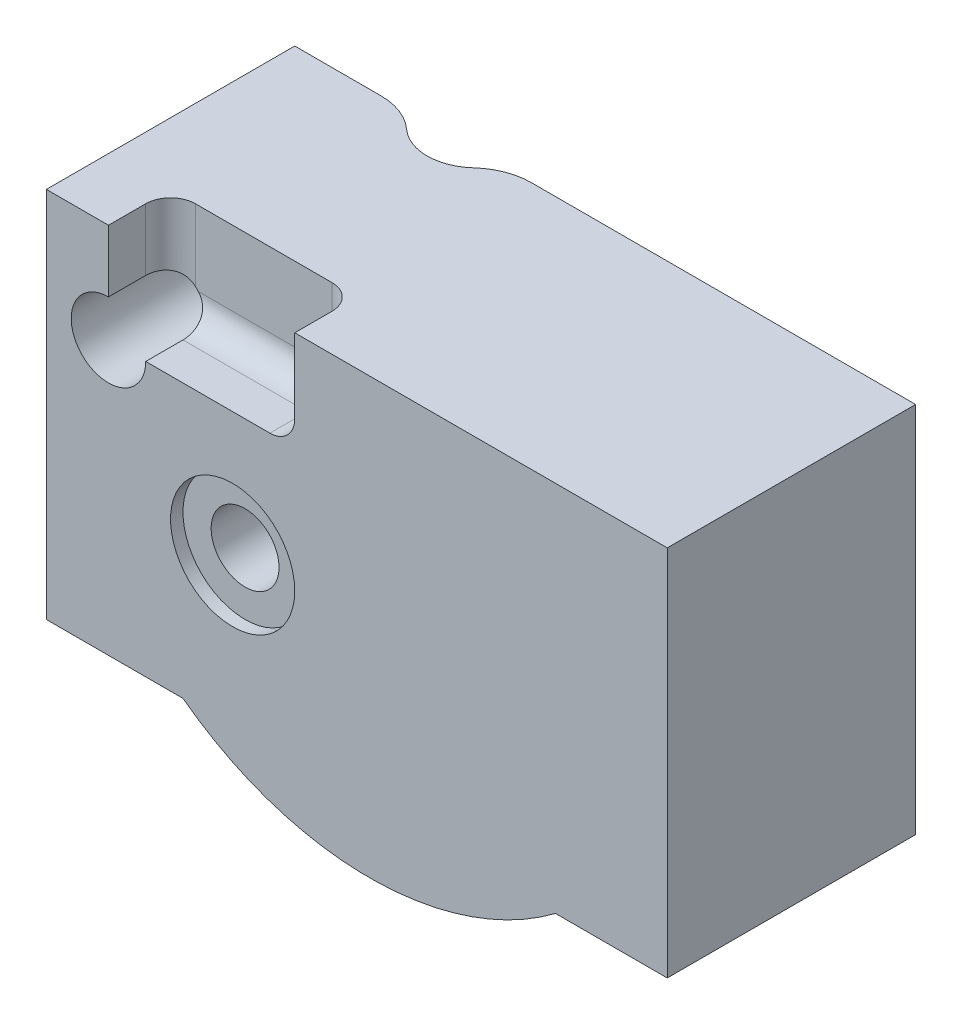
ISO-10303-21;
HEADER;
FILE_DESCRIPTION(('STEP AP214'),'2;1');
FILE_NAME('part.step','',(''),(''),'','','');
FILE_SCHEMA(('AUTOMOTIVE_DESIGN { 1 0 10303 214 1 1 1 1 }'));
ENDSEC;
DATA;
#1=APPLICATION_CONTEXT('core data for automotive mechanical design processes');
#2=APPLICATION_PROTOCOL_DEFINITION('international standard','automotive_design',2000,#1);
#3=PRODUCT_CONTEXT('',#1,'mechanical');
#4=PRODUCT('Part','Part','',(#3));
#5=PRODUCT_RELATED_PRODUCT_CATEGORY('part','',(#4));
#6=PRODUCT_DEFINITION_FORMATION('','',#4);
#7=PRODUCT_DEFINITION_CONTEXT('part definition',#1,'design');
#8=PRODUCT_DEFINITION('design','',#6,#7);
#9=PRODUCT_DEFINITION_SHAPE('','',#8);
#10=(LENGTH_UNIT() NAMED_UNIT(*) SI_UNIT(.MILLI.,.METRE.));
#11=(NAMED_UNIT(*) PLANE_ANGLE_UNIT() SI_UNIT($,.RADIAN.));
#12=(NAMED_UNIT(*) SI_UNIT($,.STERADIAN.) SOLID_ANGLE_UNIT());
#13=UNCERTAINTY_MEASURE_WITH_UNIT(LENGTH_MEASURE(1.E-05),#10,'distance_accuracy_value','');
#14=(GEOMETRIC_REPRESENTATION_CONTEXT(3) GLOBAL_UNCERTAINTY_ASSIGNED_CONTEXT((#13)) GLOBAL_UNIT_ASSIGNED_CONTEXT((#10,
#11,#12)) REPRESENTATION_CONTEXT('',''));
#15=CARTESIAN_POINT('',(0.,0.,0.));
#16=DIRECTION('',(0.,0.,1.));
#17=DIRECTION('',(1.,0.,0.));
#18=AXIS2_PLACEMENT_3D('',#15,#16,#17);
#19=CARTESIAN_POINT('',(-4.,5.,0.));
#20=DIRECTION('',(0.,0.,1.));
#21=DIRECTION('',(1.,0.,0.));
#22=AXIS2_PLACEMENT_3D('',#19,#20,#21);
#23=PLANE('',#22);
#24=CARTESIAN_POINT('',(-4.,5.,0.));
#25=DIRECTION('',(0.,0.,1.));
#26=DIRECTION('',(1.,0.,0.));
#27=AXIS2_PLACEMENT_3D('',#24,#25,#26);
#28=CIRCLE('',#27,25.);
#29=CARTESIAN_POINT('',(-10.9468960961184,-19.0154249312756,0.));
#30=VERTEX_POINT('',#29);
#31=CARTESIAN_POINT('',(11.,-15.,0.));
#32=VERTEX_POINT('',#31);
#33=EDGE_CURVE('E731',#30,#32,#28,.T.);
#34=ORIENTED_EDGE('',*,*,#33,.F.);
#35=DIRECTION('',(0.,1.,0.));
#36=VECTOR('',#35,1.);
#37=CARTESIAN_POINT('',(-10.9468960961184,5.,0.));
#38=LINE('',#37,#36);
#39=CARTESIAN_POINT('',(-10.9468960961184,15.,0.));
#40=VERTEX_POINT('',#39);
#41=EDGE_CURVE('E753',#30,#40,#38,.T.);
#42=ORIENTED_EDGE('',*,*,#41,.T.);
#43=DIRECTION('',(-1.,0.,0.));
#44=VECTOR('',#43,1.);
#45=CARTESIAN_POINT('',(-30.,15.,0.));
#46=LINE('',#45,#44);
#47=CARTESIAN_POINT('',(20.,15.,0.));
#48=VERTEX_POINT('',#47);
#49=EDGE_CURVE('E737',#48,#40,#46,.T.);
#50=ORIENTED_EDGE('',*,*,#49,.F.);
#51=DIRECTION('',(0.,1.,0.));
#52=VECTOR('',#51,1.);
#53=CARTESIAN_POINT('',(20.,15.,0.));
#54=LINE('',#53,#52);
#55=CARTESIAN_POINT('',(20.,-15.,0.));
#56=VERTEX_POINT('',#55);
#57=EDGE_CURVE('E735',#56,#48,#54,.T.);
#58=ORIENTED_EDGE('',*,*,#57,.F.);
#59=DIRECTION('',(1.,0.,0.));
#60=VECTOR('',#59,1.);
#61=CARTESIAN_POINT('',(11.,-15.,0.));
#62=LINE('',#61,#60);
#63=EDGE_CURVE('E733',#32,#56,#62,.T.);
#64=ORIENTED_EDGE('',*,*,#63,.F.);
#65=EDGE_LOOP('',(#34,#42,#50,#58,#64));
#66=FACE_BOUND('',#65,.T.);
#67=ADVANCED_FACE('F38',(#66),#23,.F.);
#68=CARTESIAN_POINT('',(-30.,15.,20.));
#69=DIRECTION('',(1.,0.,0.));
#70=DIRECTION('',(0.,1.,0.));
#71=AXIS2_PLACEMENT_3D('',#68,#69,#70);
#72=PLANE('',#71);
#73=DIRECTION('',(0.,-1.,0.));
#74=VECTOR('',#73,1.);
#75=CARTESIAN_POINT('',(-30.,15.,0.));
#76=LINE('',#75,#74);
#77=CARTESIAN_POINT('',(-30.,15.,0.));
#78=VERTEX_POINT('',#77);
#79=CARTESIAN_POINT('',(-30.,-15.,0.));
#80=VERTEX_POINT('',#79);
#81=EDGE_CURVE('E263',#78,#80,#76,.T.);
#82=ORIENTED_EDGE('',*,*,#81,.T.);
#83=DIRECTION('',(0.,0.,-1.));
#84=VECTOR('',#83,1.);
#85=CARTESIAN_POINT('',(-30.,-15.,20.));
#86=LINE('',#85,#84);
#87=CARTESIAN_POINT('',(-30.,-15.,20.));
#88=VERTEX_POINT('',#87);
#89=EDGE_CURVE('E750',#88,#80,#86,.T.);
#90=ORIENTED_EDGE('',*,*,#89,.F.);
#91=DIRECTION('',(0.,-1.,0.));
#92=VECTOR('',#91,1.);
#93=CARTESIAN_POINT('',(-30.,15.,20.));
#94=LINE('',#93,#92);
#95=CARTESIAN_POINT('',(-30.,15.,20.));
#96=VERTEX_POINT('',#95);
#97=EDGE_CURVE('E264',#96,#88,#94,.T.);
#98=ORIENTED_EDGE('',*,*,#97,.F.);
#99=DIRECTION('',(0.,0.,-1.));
#100=VECTOR('',#99,1.);
#101=CARTESIAN_POINT('',(-30.,15.,20.));
#102=LINE('',#101,#100);
#103=EDGE_CURVE('E717',#96,#78,#102,.T.);
#104=ORIENTED_EDGE('',*,*,#103,.T.);
#105=EDGE_LOOP('',(#82,#90,#98,#104));
#106=FACE_BOUND('',#105,.T.);
#107=ADVANCED_FACE('F581',(#106),#72,.F.);
#108=CARTESIAN_POINT('',(-30.,-15.,20.));
#109=DIRECTION('',(0.,1.,0.));
#110=DIRECTION('',(0.,0.,1.));
#111=AXIS2_PLACEMENT_3D('',#108,#109,#110);
#112=PLANE('',#111);
#113=DIRECTION('',(1.,0.,0.));
#114=VECTOR('',#113,1.);
#115=CARTESIAN_POINT('',(-30.,-15.,0.));
#116=LINE('',#115,#114);
#117=CARTESIAN_POINT('',(-23.0531039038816,-15.,0.));
#118=VERTEX_POINT('',#117);
#119=EDGE_CURVE('E728',#80,#118,#116,.T.);
#120=ORIENTED_EDGE('',*,*,#119,.T.);
#121=CARTESIAN_POINT('',(-23.0531039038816,-15.,5.));
#122=DIRECTION('',(0.,1.,0.));
#123=DIRECTION('',(0.,0.,1.));
#124=AXIS2_PLACEMENT_3D('',#121,#122,#123);
#125=CIRCLE('',#124,5.);
#126=CARTESIAN_POINT('',(-19.6902684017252,-15.,1.29981927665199));
#127=VERTEX_POINT('',#126);
#128=EDGE_CURVE('E610',#118,#127,#125,.F.);
#129=ORIENTED_EDGE('',*,*,#128,.T.);
#130=CARTESIAN_POINT('',(-17.,-15.,-1.66032530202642));
#131=DIRECTION('',(0.,1.,0.));
#132=DIRECTION('',(0.,0.,1.));
#133=AXIS2_PLACEMENT_3D('',#130,#131,#132);
#134=CIRCLE('',#133,4.);
#135=CARTESIAN_POINT('',(-19.,-15.,1.80377631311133));
#136=VERTEX_POINT('',#135);
#137=EDGE_CURVE('E253',#127,#136,#134,.T.);
#138=ORIENTED_EDGE('',*,*,#137,.T.);
#139=DIRECTION('',(0.,0.,-1.));
#140=VECTOR('',#139,1.);
#141=CARTESIAN_POINT('',(-19.,-15.,20.));
#142=LINE('',#141,#140);
#143=CARTESIAN_POINT('',(-19.,-15.,20.));
#144=VERTEX_POINT('',#143);
#145=EDGE_CURVE('E747',#144,#136,#142,.T.);
#146=ORIENTED_EDGE('',*,*,#145,.F.);
#147=DIRECTION('',(1.,0.,0.));
#148=VECTOR('',#147,1.);
#149=CARTESIAN_POINT('',(-30.,-15.,20.));
#150=LINE('',#149,#148);
#151=EDGE_CURVE('E789',#88,#144,#150,.T.);
#152=ORIENTED_EDGE('',*,*,#151,.F.);
#153=ORIENTED_EDGE('',*,*,#89,.T.);
#154=EDGE_LOOP('',(#120,#129,#138,#146,#152,#153));
#155=FACE_BOUND('',#154,.T.);
#156=ADVANCED_FACE('F587',(#155),#112,.F.);
#157=CARTESIAN_POINT('',(-4.,5.,20.));
#158=DIRECTION('',(0.,0.,-1.));
#159=DIRECTION('',(-1.,0.,0.));
#160=AXIS2_PLACEMENT_3D('',#157,#158,#159);
#161=CYLINDRICAL_SURFACE('',#160,25.);
#162=CARTESIAN_POINT('',(-19.,-15.,1.80377631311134));
#163=CARTESIAN_POINT('',(-18.8766514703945,-15.092531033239,1.87496960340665));
#164=CARTESIAN_POINT('',(-18.7499284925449,-15.1857713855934,1.93937151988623));
#165=CARTESIAN_POINT('',(-18.4905979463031,-15.3727248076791,2.05427814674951));
#166=CARTESIAN_POINT('',(-18.3579886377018,-15.4664380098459,2.10477871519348));
#167=CARTESIAN_POINT('',(-18.0871607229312,-15.6537939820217,2.191738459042));
#168=CARTESIAN_POINT('',(-17.9489177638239,-15.7474341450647,2.22812744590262));
#169=CARTESIAN_POINT('',(-17.6684245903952,-15.9332856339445,2.28602914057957));
#170=CARTESIAN_POINT('',(-17.5261748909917,-16.0254971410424,2.30754375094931));
#171=CARTESIAN_POINT('',(-17.2473858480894,-16.2021780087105,2.33432278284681));
#172=CARTESIAN_POINT('',(-17.1110167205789,-16.2867797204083,2.3404856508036));
#173=CARTESIAN_POINT('',(-16.836738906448,-16.4532948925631,2.33869315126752));
#174=CARTESIAN_POINT('',(-16.6988303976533,-16.5352086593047,2.33073939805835));
#175=CARTESIAN_POINT('',(-16.4229333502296,-16.6955325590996,2.30025769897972));
#176=CARTESIAN_POINT('',(-16.2849454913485,-16.7739492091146,2.27775818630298));
#177=CARTESIAN_POINT('',(-16.010012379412,-16.926794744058,2.21778154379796));
#178=CARTESIAN_POINT('',(-15.873066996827,-17.0012241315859,2.18030630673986));
#179=CARTESIAN_POINT('',(-15.6141808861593,-17.1388866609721,2.09418933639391));
#180=CARTESIAN_POINT('',(-15.4920111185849,-17.202521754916,2.0468783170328));
#181=CARTESIAN_POINT('',(-15.2511730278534,-17.3255320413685,1.93953276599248));
#182=CARTESIAN_POINT('',(-15.1325040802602,-17.3849079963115,1.87950051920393));
#183=CARTESIAN_POINT('',(-14.9000796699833,-17.4990006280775,1.74676245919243));
#184=CARTESIAN_POINT('',(-14.7863247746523,-17.5537167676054,1.67405518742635));
#185=CARTESIAN_POINT('',(-14.5652885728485,-17.6581025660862,1.5162466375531));
#186=CARTESIAN_POINT('',(-14.4580058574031,-17.7077733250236,1.43114807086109));
#187=CARTESIAN_POINT('',(-14.2657805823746,-17.7952476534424,1.26168046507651));
#188=CARTESIAN_POINT('',(-14.1798010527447,-17.8337422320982,1.1788403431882));
#189=CARTESIAN_POINT('',(-14.0148134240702,-17.9065851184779,1.00482544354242));
#190=CARTESIAN_POINT('',(-13.9358040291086,-17.9409341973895,0.913652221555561));
#191=CARTESIAN_POINT('',(-13.7859206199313,-18.0052688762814,0.72384790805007));
#192=CARTESIAN_POINT('',(-13.7150254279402,-18.0352658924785,0.625237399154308));
#193=CARTESIAN_POINT('',(-13.5820659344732,-18.0908900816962,0.421149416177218));
#194=CARTESIAN_POINT('',(-13.519994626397,-18.1165207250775,0.315677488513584));
#195=CARTESIAN_POINT('',(-13.4447966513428,-18.1472717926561,0.173253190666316));
#196=CARTESIAN_POINT('',(-13.4273235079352,-18.1543928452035,0.138971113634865));
#197=CARTESIAN_POINT('',(-13.3933587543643,-18.1681925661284,0.0698820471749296));
#198=CARTESIAN_POINT('',(-13.3768661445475,-18.1748716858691,0.035075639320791));
#199=CARTESIAN_POINT('',(-13.3608627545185,-18.1813340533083,0.));
#200=B_SPLINE_CURVE_WITH_KNOTS('',3,(#162,#163,#164,#165,#166,#167,#168,#169,#170,#171,#172,
#173,#174,#175,#176,#177,#178,#179,#180,#181,#182,#183,#184,#185,#186,#187,#188,#189,#190,#191,
#192,#193,#194,#195,#196,#197,#198,#199),.UNSPECIFIED.,.F.,.F.,(4,2,2,2,2,2,2,2,2,2,2,2,2,2,2,2,
2,2,4),(0.,0.509334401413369,1.01882039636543,1.53080894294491,2.04273198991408,
2.52390640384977,3.00502579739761,3.48520755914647,3.96532865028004,4.40164585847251,
4.83788476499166,5.27417390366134,5.71036771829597,6.08619501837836,6.46195229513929,
6.83670534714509,7.21115914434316,7.32854097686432,7.44580101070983),.UNSPECIFIED.);
#201=CARTESIAN_POINT('',(-14.3097315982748,-17.7751933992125,1.299819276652));
#202=VERTEX_POINT('',#201);
#203=EDGE_CURVE('E255',#136,#202,#200,.T.);
#204=ORIENTED_EDGE('',*,*,#203,.T.);
#205=CARTESIAN_POINT('',(-14.3097315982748,-17.7751933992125,1.29981927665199));
#206=CARTESIAN_POINT('',(-14.1978751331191,-17.8258366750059,1.19815632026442));
#207=CARTESIAN_POINT('',(-14.0816547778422,-17.8774454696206,1.10179760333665));
#208=CARTESIAN_POINT('',(-13.8413583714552,-17.9818343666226,0.920201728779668));
#209=CARTESIAN_POINT('',(-13.7172839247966,-18.0346142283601,0.834962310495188));
#210=CARTESIAN_POINT('',(-13.4657670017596,-18.1390857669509,0.678356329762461));
#211=CARTESIAN_POINT('',(-13.338523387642,-18.1907652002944,0.606661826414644));
#212=CARTESIAN_POINT('',(-13.0781893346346,-18.2939063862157,0.474639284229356));
#213=CARTESIAN_POINT('',(-12.9450989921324,-18.3453681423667,0.414311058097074));
#214=CARTESIAN_POINT('',(-12.6652657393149,-18.4507335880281,0.301984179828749));
#215=CARTESIAN_POINT('',(-12.5181924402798,-18.5045849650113,0.250757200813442));
#216=CARTESIAN_POINT('',(-12.2193957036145,-18.6107325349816,0.162125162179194));
#217=CARTESIAN_POINT('',(-12.0676723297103,-18.6630287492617,0.12471991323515));
#218=CARTESIAN_POINT('',(-11.7558575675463,-18.7670874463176,0.0632397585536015));
#219=CARTESIAN_POINT('',(-11.5956530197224,-18.8187815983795,0.0396203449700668));
#220=CARTESIAN_POINT('',(-11.2727716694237,-18.9193577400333,0.00798840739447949));
#221=CARTESIAN_POINT('',(-11.1100938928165,-18.9682385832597,-1.77976235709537E-05));
#222=CARTESIAN_POINT('',(-10.9468960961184,-19.0154249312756,0.));
#223=B_SPLINE_CURVE_WITH_KNOTS('',3,(#205,#206,#207,#208,#209,#210,#211,#212,#213,#214,#215,
#216,#217,#218,#219,#220,#221,#222),.UNSPECIFIED.,.F.,.F.,(4,2,2,2,2,2,2,2,4),(0.,
0.478065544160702,0.956033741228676,1.42028420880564,1.8845270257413,2.37823435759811,
2.87193492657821,3.381138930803,3.89054897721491),.UNSPECIFIED.);
#224=EDGE_CURVE('E615',#202,#30,#223,.T.);
#225=ORIENTED_EDGE('',*,*,#224,.T.);
#226=ORIENTED_EDGE('',*,*,#33,.T.);
#227=DIRECTION('',(0.,0.,-1.));
#228=VECTOR('',#227,1.);
#229=CARTESIAN_POINT('',(11.,-15.,20.));
#230=LINE('',#229,#228);
#231=CARTESIAN_POINT('',(11.,-15.,20.));
#232=VERTEX_POINT('',#231);
#233=EDGE_CURVE('E744',#232,#32,#230,.T.);
#234=ORIENTED_EDGE('',*,*,#233,.F.);
#235=CARTESIAN_POINT('',(-4.,5.,20.));
#236=DIRECTION('',(0.,0.,1.));
#237=DIRECTION('',(1.,0.,0.));
#238=AXIS2_PLACEMENT_3D('',#235,#236,#237);
#239=CIRCLE('',#238,25.);
#240=EDGE_CURVE('E788',#144,#232,#239,.T.);
#241=ORIENTED_EDGE('',*,*,#240,.F.);
#242=ORIENTED_EDGE('',*,*,#145,.T.);
#243=EDGE_LOOP('',(#204,#225,#226,#234,#241,#242));
#244=FACE_BOUND('',#243,.T.);
#245=ADVANCED_FACE('F266',(#244),#161,.T.);
#246=CARTESIAN_POINT('',(11.,-15.,20.));
#247=DIRECTION('',(0.,1.,0.));
#248=DIRECTION('',(0.,0.,1.));
#249=AXIS2_PLACEMENT_3D('',#246,#247,#248);
#250=PLANE('',#249);
#251=ORIENTED_EDGE('',*,*,#63,.T.);
#252=DIRECTION('',(0.,0.,-1.));
#253=VECTOR('',#252,1.);
#254=CARTESIAN_POINT('',(20.,-15.,20.));
#255=LINE('',#254,#253);
#256=CARTESIAN_POINT('',(20.,-15.,20.));
#257=VERTEX_POINT('',#256);
#258=EDGE_CURVE('E741',#257,#56,#255,.T.);
#259=ORIENTED_EDGE('',*,*,#258,.F.);
#260=DIRECTION('',(1.,0.,0.));
#261=VECTOR('',#260,1.);
#262=CARTESIAN_POINT('',(11.,-15.,20.));
#263=LINE('',#262,#261);
#264=EDGE_CURVE('E787',#232,#257,#263,.T.);
#265=ORIENTED_EDGE('',*,*,#264,.F.);
#266=ORIENTED_EDGE('',*,*,#233,.T.);
#267=EDGE_LOOP('',(#251,#259,#265,#266));
#268=FACE_BOUND('',#267,.T.);
#269=ADVANCED_FACE('F784',(#268),#250,.F.);
#270=CARTESIAN_POINT('',(20.,15.,20.));
#271=DIRECTION('',(-1.,0.,0.));
#272=DIRECTION('',(0.,-1.,0.));
#273=AXIS2_PLACEMENT_3D('',#270,#271,#272);
#274=PLANE('',#273);
#275=ORIENTED_EDGE('',*,*,#57,.T.);
#276=DIRECTION('',(0.,0.,-1.));
#277=VECTOR('',#276,1.);
#278=CARTESIAN_POINT('',(20.,15.,20.));
#279=LINE('',#278,#277);
#280=CARTESIAN_POINT('',(20.,15.,20.));
#281=VERTEX_POINT('',#280);
#282=EDGE_CURVE('E721',#281,#48,#279,.T.);
#283=ORIENTED_EDGE('',*,*,#282,.F.);
#284=DIRECTION('',(0.,1.,0.));
#285=VECTOR('',#284,1.);
#286=CARTESIAN_POINT('',(20.,15.,20.));
#287=LINE('',#286,#285);
#288=EDGE_CURVE('E713',#257,#281,#287,.T.);
#289=ORIENTED_EDGE('',*,*,#288,.F.);
#290=ORIENTED_EDGE('',*,*,#258,.T.);
#291=EDGE_LOOP('',(#275,#283,#289,#290));
#292=FACE_BOUND('',#291,.T.);
#293=ADVANCED_FACE('F781',(#292),#274,.F.);
#294=CARTESIAN_POINT('',(-30.,15.,20.));
#295=DIRECTION('',(0.,-1.,0.));
#296=DIRECTION('',(0.,0.,-1.));
#297=AXIS2_PLACEMENT_3D('',#294,#295,#296);
#298=PLANE('',#297);
#299=DIRECTION('',(-1.,0.,0.));
#300=VECTOR('',#299,1.);
#301=CARTESIAN_POINT('',(-30.,15.,20.));
#302=LINE('',#301,#300);
#303=CARTESIAN_POINT('',(-25.,15.,20.));
#304=VERTEX_POINT('',#303);
#305=EDGE_CURVE('E718',#304,#96,#302,.T.);
#306=ORIENTED_EDGE('',*,*,#305,.F.);
#307=DIRECTION('',(0.,0.,1.));
#308=VECTOR('',#307,1.);
#309=CARTESIAN_POINT('',(-25.,15.,15.));
#310=LINE('',#309,#308);
#311=CARTESIAN_POINT('',(-25.,15.,17.));
#312=VERTEX_POINT('',#311);
#313=EDGE_CURVE('E231',#312,#304,#310,.T.);
#314=ORIENTED_EDGE('',*,*,#313,.F.);
#315=CARTESIAN_POINT('',(-23.,15.,17.));
#316=DIRECTION('',(0.,-1.,0.));
#317=DIRECTION('',(0.,0.,-1.));
#318=AXIS2_PLACEMENT_3D('',#315,#316,#317);
#319=CIRCLE('',#318,2.);
#320=CARTESIAN_POINT('',(-23.,15.,15.));
#321=VERTEX_POINT('',#320);
#322=EDGE_CURVE('E643',#312,#321,#319,.T.);
#323=ORIENTED_EDGE('',*,*,#322,.T.);
#324=DIRECTION('',(-1.,0.,0.));
#325=VECTOR('',#324,1.);
#326=CARTESIAN_POINT('',(-25.,15.,15.));
#327=LINE('',#326,#325);
#328=CARTESIAN_POINT('',(-12.,15.,15.));
#329=VERTEX_POINT('',#328);
#330=EDGE_CURVE('E692',#329,#321,#327,.T.);
#331=ORIENTED_EDGE('',*,*,#330,.F.);
#332=CARTESIAN_POINT('',(-12.,15.,17.));
#333=DIRECTION('',(0.,-1.,0.));
#334=DIRECTION('',(0.,0.,-1.));
#335=AXIS2_PLACEMENT_3D('',#332,#333,#334);
#336=CIRCLE('',#335,2.);
#337=CARTESIAN_POINT('',(-10.,15.,17.));
#338=VERTEX_POINT('',#337);
#339=EDGE_CURVE('E645',#329,#338,#336,.T.);
#340=ORIENTED_EDGE('',*,*,#339,.T.);
#341=DIRECTION('',(0.,0.,1.));
#342=VECTOR('',#341,1.);
#343=CARTESIAN_POINT('',(-10.,15.,15.));
#344=LINE('',#343,#342);
#345=CARTESIAN_POINT('',(-10.,15.,20.));
#346=VERTEX_POINT('',#345);
#347=EDGE_CURVE('E235',#338,#346,#344,.T.);
#348=ORIENTED_EDGE('',*,*,#347,.T.);
#349=EDGE_CURVE('E710',#281,#346,#302,.T.);
#350=ORIENTED_EDGE('',*,*,#349,.F.);
#351=ORIENTED_EDGE('',*,*,#282,.T.);
#352=ORIENTED_EDGE('',*,*,#49,.T.);
#353=CARTESIAN_POINT('',(-10.9468960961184,15.,5.));
#354=DIRECTION('',(0.,-1.,0.));
#355=DIRECTION('',(0.,0.,-1.));
#356=AXIS2_PLACEMENT_3D('',#353,#354,#355);
#357=CIRCLE('',#356,5.);
#358=CARTESIAN_POINT('',(-14.3097315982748,15.,1.29981927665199));
#359=VERTEX_POINT('',#358);
#360=EDGE_CURVE('E758',#40,#359,#357,.F.);
#361=ORIENTED_EDGE('',*,*,#360,.T.);
#362=CARTESIAN_POINT('',(-17.,15.,-1.66032530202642));
#363=DIRECTION('',(0.,1.,0.));
#364=DIRECTION('',(0.,0.,1.));
#365=AXIS2_PLACEMENT_3D('',#362,#363,#364);
#366=CIRCLE('',#365,4.);
#367=CARTESIAN_POINT('',(-19.6902684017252,15.,1.29981927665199));
#368=VERTEX_POINT('',#367);
#369=EDGE_CURVE('E250',#368,#359,#366,.T.);
#370=ORIENTED_EDGE('',*,*,#369,.F.);
#371=CARTESIAN_POINT('',(-23.0531039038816,15.,5.));
#372=DIRECTION('',(0.,-1.,0.));
#373=DIRECTION('',(0.,0.,-1.));
#374=AXIS2_PLACEMENT_3D('',#371,#372,#373);
#375=CIRCLE('',#374,5.);
#376=CARTESIAN_POINT('',(-23.0531039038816,15.,0.));
#377=VERTEX_POINT('',#376);
#378=EDGE_CURVE('E756',#368,#377,#375,.F.);
#379=ORIENTED_EDGE('',*,*,#378,.T.);
#380=EDGE_CURVE('E606',#377,#78,#46,.T.);
#381=ORIENTED_EDGE('',*,*,#380,.T.);
#382=ORIENTED_EDGE('',*,*,#103,.F.);
#383=EDGE_LOOP('',(#306,#314,#323,#331,#340,#348,#350,#351,#352,#361,#370,#379,#381,#382));
#384=FACE_BOUND('',#383,.T.);
#385=ADVANCED_FACE('F597',(#384),#298,.F.);
#386=CARTESIAN_POINT('',(-4.,5.,20.));
#387=DIRECTION('',(0.,0.,1.));
#388=DIRECTION('',(1.,0.,0.));
#389=AXIS2_PLACEMENT_3D('',#386,#387,#388);
#390=PLANE('',#389);
#391=CARTESIAN_POINT('',(-15.,-3.,20.));
#392=DIRECTION('',(0.,0.,1.));
#393=DIRECTION('',(1.,0.,0.));
#394=AXIS2_PLACEMENT_3D('',#391,#392,#393);
#395=CIRCLE('',#394,5.);
#396=CARTESIAN_POINT('',(-10.,-3.,20.));
#397=VERTEX_POINT('',#396);
#398=EDGE_CURVE('E294',#397,#397,#395,.T.);
#399=ORIENTED_EDGE('',*,*,#398,.F.);
#400=EDGE_LOOP('',(#399));
#401=FACE_BOUND('',#400,.T.);
#402=CARTESIAN_POINT('',(-25.,7.,20.));
#403=DIRECTION('',(0.,0.,1.));
#404=DIRECTION('',(1.,0.,0.));
#405=AXIS2_PLACEMENT_3D('',#402,#403,#404);
#406=CIRCLE('',#405,3.);
#407=CARTESIAN_POINT('',(-25.,10.,20.));
#408=VERTEX_POINT('',#407);
#409=CARTESIAN_POINT('',(-22.,7.,20.));
#410=VERTEX_POINT('',#409);
#411=EDGE_CURVE('E292',#408,#410,#406,.T.);
#412=ORIENTED_EDGE('',*,*,#411,.F.);
#413=DIRECTION('',(0.,-1.,0.));
#414=VECTOR('',#413,1.);
#415=CARTESIAN_POINT('',(-25.,15.,20.));
#416=LINE('',#415,#414);
#417=EDGE_CURVE('E657',#304,#408,#416,.T.);
#418=ORIENTED_EDGE('',*,*,#417,.F.);
#419=ORIENTED_EDGE('',*,*,#305,.T.);
#420=ORIENTED_EDGE('',*,*,#97,.T.);
#421=ORIENTED_EDGE('',*,*,#151,.T.);
#422=ORIENTED_EDGE('',*,*,#240,.T.);
#423=ORIENTED_EDGE('',*,*,#264,.T.);
#424=ORIENTED_EDGE('',*,*,#288,.T.);
#425=ORIENTED_EDGE('',*,*,#349,.T.);
#426=DIRECTION('',(0.,1.,0.));
#427=VECTOR('',#426,1.);
#428=CARTESIAN_POINT('',(-10.,15.,20.));
#429=LINE('',#428,#427);
#430=CARTESIAN_POINT('',(-10.,9.,20.));
#431=VERTEX_POINT('',#430);
#432=EDGE_CURVE('E695',#431,#346,#429,.T.);
#433=ORIENTED_EDGE('',*,*,#432,.F.);
#434=CARTESIAN_POINT('',(-12.,9.,20.));
#435=DIRECTION('',(0.,0.,1.));
#436=DIRECTION('',(1.,0.,0.));
#437=AXIS2_PLACEMENT_3D('',#434,#435,#436);
#438=CIRCLE('',#437,2.);
#439=CARTESIAN_POINT('',(-12.,7.,20.));
#440=VERTEX_POINT('',#439);
#441=EDGE_CURVE('E640',#431,#440,#438,.F.);
#442=ORIENTED_EDGE('',*,*,#441,.T.);
#443=DIRECTION('',(1.,0.,0.));
#444=VECTOR('',#443,1.);
#445=CARTESIAN_POINT('',(-25.,7.,20.));
#446=LINE('',#445,#444);
#447=EDGE_CURVE('E698',#410,#440,#446,.T.);
#448=ORIENTED_EDGE('',*,*,#447,.F.);
#449=EDGE_LOOP('',(#412,#418,#419,#420,#421,#422,#423,#424,#425,#433,#442,#448));
#450=FACE_BOUND('',#449,.T.);
#451=ADVANCED_FACE('F280',(#401,#450),#390,.T.);
#452=DIRECTION('',(0.,1.,0.));
#453=VECTOR('',#452,1.);
#454=CARTESIAN_POINT('',(-23.0531039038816,5.,0.));
#455=LINE('',#454,#453);
#456=CARTESIAN_POINT('',(-23.0531039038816,9.28245385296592,0.));
#457=VERTEX_POINT('',#456);
#458=EDGE_CURVE('E603',#377,#457,#455,.F.);
#459=ORIENTED_EDGE('',*,*,#458,.T.);
#460=CARTESIAN_POINT('',(-25.,7.,0.));
#461=DIRECTION('',(0.,0.,1.));
#462=DIRECTION('',(1.,0.,0.));
#463=AXIS2_PLACEMENT_3D('',#460,#461,#462);
#464=CIRCLE('',#463,3.);
#465=CARTESIAN_POINT('',(-23.0531039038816,4.71754614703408,0.));
#466=VERTEX_POINT('',#465);
#467=EDGE_CURVE('E296',#457,#466,#464,.T.);
#468=ORIENTED_EDGE('',*,*,#467,.T.);
#469=EDGE_CURVE('E611',#466,#118,#455,.F.);
#470=ORIENTED_EDGE('',*,*,#469,.T.);
#471=ORIENTED_EDGE('',*,*,#119,.F.);
#472=ORIENTED_EDGE('',*,*,#81,.F.);
#473=ORIENTED_EDGE('',*,*,#380,.F.);
#474=EDGE_LOOP('',(#459,#468,#470,#471,#472,#473));
#475=FACE_BOUND('',#474,.T.);
#476=ADVANCED_FACE('F276',(#475),#23,.F.);
#477=CARTESIAN_POINT('',(-17.,-20.,-1.66032530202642));
#478=DIRECTION('',(0.,1.,0.));
#479=DIRECTION('',(0.,0.,1.));
#480=AXIS2_PLACEMENT_3D('',#477,#478,#479);
#481=CYLINDRICAL_SURFACE('',#480,4.);
#482=DIRECTION('',(0.,1.,0.));
#483=VECTOR('',#482,1.);
#484=CARTESIAN_POINT('',(-14.3097315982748,-20.,1.29981927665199));
#485=LINE('',#484,#483);
#486=CARTESIAN_POINT('',(-14.3097315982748,-0.353846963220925,1.29981927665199));
#487=VERTEX_POINT('',#486);
#488=EDGE_CURVE('E762',#359,#487,#485,.F.);
#489=ORIENTED_EDGE('',*,*,#488,.T.);
#490=CARTESIAN_POINT('',(-14.3097315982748,-0.353846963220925,1.29981927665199));
#491=CARTESIAN_POINT('',(-14.3670238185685,-0.338899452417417,1.35189784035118));
#492=CARTESIAN_POINT('',(-14.4260795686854,-0.325484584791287,1.40252226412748));
#493=CARTESIAN_POINT('',(-14.5475407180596,-0.302278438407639,1.50061271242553));
#494=CARTESIAN_POINT('',(-14.6099497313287,-0.292491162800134,1.54807520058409));
#495=CARTESIAN_POINT('',(-14.7382636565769,-0.277079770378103,1.63979796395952));
#496=CARTESIAN_POINT('',(-14.8041901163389,-0.271485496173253,1.68403329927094));
#497=CARTESIAN_POINT('',(-14.9387163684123,-0.265155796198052,1.76858375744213));
#498=CARTESIAN_POINT('',(-15.0073152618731,-0.264418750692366,1.80890018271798));
#499=CARTESIAN_POINT('',(-15.1472146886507,-0.26836018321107,1.8856014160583));
#500=CARTESIAN_POINT('',(-15.218531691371,-0.273079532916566,1.92195429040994));
#501=CARTESIAN_POINT('',(-15.362683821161,-0.288485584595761,1.99009257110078));
#502=CARTESIAN_POINT('',(-15.4355187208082,-0.299171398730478,2.02187865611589));
#503=CARTESIAN_POINT('',(-15.581631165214,-0.326836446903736,2.08058365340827));
#504=CARTESIAN_POINT('',(-15.6549059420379,-0.343791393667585,2.10752076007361));
#505=CARTESIAN_POINT('',(-15.8012337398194,-0.384203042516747,2.1566011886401));
#506=CARTESIAN_POINT('',(-15.8742867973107,-0.407658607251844,2.17874534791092));
#507=CARTESIAN_POINT('',(-16.0719221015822,-0.480615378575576,2.23267052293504));
#508=CARTESIAN_POINT('',(-16.1954508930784,-0.536668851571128,2.2597931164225));
#509=CARTESIAN_POINT('',(-16.4343972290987,-0.667678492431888,2.30135074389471));
#510=CARTESIAN_POINT('',(-16.5498061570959,-0.742654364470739,2.31577248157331));
#511=CARTESIAN_POINT('',(-16.7652483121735,-0.907079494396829,2.33420169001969));
#512=CARTESIAN_POINT('',(-16.8656354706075,-0.996034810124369,2.33850470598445));
#513=CARTESIAN_POINT('',(-17.052307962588,-1.18767056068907,2.34042384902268));
#514=CARTESIAN_POINT('',(-17.138593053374,-1.29035123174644,2.33803986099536));
#515=CARTESIAN_POINT('',(-17.3018640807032,-1.51639719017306,2.32917815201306));
#516=CARTESIAN_POINT('',(-17.377423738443,-1.64078044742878,2.32236777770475));
#517=CARTESIAN_POINT('',(-17.5078867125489,-1.89992549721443,2.30784480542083));
#518=CARTESIAN_POINT('',(-17.5627823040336,-2.03469114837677,2.30013187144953));
#519=CARTESIAN_POINT('',(-17.653119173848,-2.31945723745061,2.28627724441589));
#520=CARTESIAN_POINT('',(-17.6872327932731,-2.46988767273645,2.28025402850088));
#521=CARTESIAN_POINT('',(-17.7297161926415,-2.7744344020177,2.27261145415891));
#522=CARTESIAN_POINT('',(-17.7380900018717,-2.92855011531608,2.27099140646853));
#523=CARTESIAN_POINT('',(-17.7288914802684,-3.23424374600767,2.27270573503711));
#524=CARTESIAN_POINT('',(-17.7116082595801,-3.38583076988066,2.27598490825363));
#525=CARTESIAN_POINT('',(-17.6521593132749,-3.68392755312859,2.28626611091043));
#526=CARTESIAN_POINT('',(-17.6099885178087,-3.8304362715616,2.29326889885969));
#527=CARTESIAN_POINT('',(-17.5018278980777,-4.11474201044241,2.30844530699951));
#528=CARTESIAN_POINT('',(-17.4357767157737,-4.25251550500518,2.31662191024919));
#529=CARTESIAN_POINT('',(-17.2815973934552,-4.5152935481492,2.33049846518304));
#530=CARTESIAN_POINT('',(-17.1934659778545,-4.64029619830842,2.33619804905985));
#531=CARTESIAN_POINT('',(-16.9968725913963,-4.87473564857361,2.34088673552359));
#532=CARTESIAN_POINT('',(-16.8882856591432,-4.984069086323,2.33983320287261));
#533=CARTESIAN_POINT('',(-16.6546900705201,-5.18266926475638,2.32645108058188));
#534=CARTESIAN_POINT('',(-16.5296931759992,-5.27195025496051,2.314130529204));
#535=CARTESIAN_POINT('',(-16.2779209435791,-5.42185541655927,2.27586437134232));
#536=CARTESIAN_POINT('',(-16.1519511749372,-5.48410322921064,2.2509864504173));
#537=CARTESIAN_POINT('',(-15.8954077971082,-5.58765255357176,2.18640349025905));
#538=CARTESIAN_POINT('',(-15.7648385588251,-5.62897340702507,2.14671220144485));
#539=CARTESIAN_POINT('',(-15.5132922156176,-5.6890003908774,2.05537025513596));
#540=CARTESIAN_POINT('',(-15.3922670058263,-5.70905410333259,2.00471723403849));
#541=CARTESIAN_POINT('',(-15.1543870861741,-5.73296343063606,1.89089172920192));
#542=CARTESIAN_POINT('',(-15.0375407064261,-5.73678830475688,1.82769572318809));
#543=CARTESIAN_POINT('',(-14.813734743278,-5.730594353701,1.69183596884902));
#544=CARTESIAN_POINT('',(-14.7066064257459,-5.72090162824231,1.61943224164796));
#545=CARTESIAN_POINT('',(-14.5525686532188,-5.69834871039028,1.50419421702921));
#546=CARTESIAN_POINT('',(-14.5024275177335,-5.68952157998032,1.46476339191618));
#547=CARTESIAN_POINT('',(-14.4043866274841,-5.66952032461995,1.38382079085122));
#548=CARTESIAN_POINT('',(-14.3564856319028,-5.65834751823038,1.34231019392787));
#549=CARTESIAN_POINT('',(-14.3097315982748,-5.64615303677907,1.29981927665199));
#550=B_SPLINE_CURVE_WITH_KNOTS('',3,(#490,#491,#492,#493,#494,#495,#496,#497,#498,#499,#500,
#501,#502,#503,#504,#505,#506,#507,#508,#509,#510,#511,#512,#513,#514,#515,#516,#517,#518,#519,
#520,#521,#522,#523,#524,#525,#526,#527,#528,#529,#530,#531,#532,#533,#534,#535,#536,#537,#538,
#539,#540,#541,#542,#543,#544,#545,#546,#547,#548,#549),.UNSPECIFIED.,.F.,.F.,(4,2,2,2,2,2,2,2,
2,2,2,2,2,2,2,2,2,2,2,2,2,2,2,2,2,2,2,2,2,4),(0.,0.236560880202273,0.473382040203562,
0.711873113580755,0.950284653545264,1.19049367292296,1.43066695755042,1.66991937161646,
1.90912995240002,2.32182800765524,2.73495759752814,3.13586206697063,3.53677343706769,
3.97196998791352,4.40732906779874,4.86818550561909,5.32896979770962,5.78460110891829,
6.24032526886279,6.69722878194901,7.15420011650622,7.61405933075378,8.07359072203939,
8.49935592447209,8.92472689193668,9.32115139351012,9.71832646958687,10.106084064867,
10.2991756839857,10.4921590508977),.UNSPECIFIED.);
#551=CARTESIAN_POINT('',(-14.3097315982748,-5.64615303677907,1.29981927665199));
#552=VERTEX_POINT('',#551);
#553=EDGE_CURVE('E284',#487,#552,#550,.T.);
#554=ORIENTED_EDGE('',*,*,#553,.T.);
#555=EDGE_CURVE('E761',#552,#202,#485,.F.);
#556=ORIENTED_EDGE('',*,*,#555,.T.);
#557=ORIENTED_EDGE('',*,*,#203,.F.);
#558=ORIENTED_EDGE('',*,*,#137,.F.);
#559=DIRECTION('',(0.,1.,0.));
#560=VECTOR('',#559,1.);
#561=CARTESIAN_POINT('',(-19.6902684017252,-20.,1.29981927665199));
#562=LINE('',#561,#560);
#563=EDGE_CURVE('E760',#127,#368,#562,.T.);
#564=ORIENTED_EDGE('',*,*,#563,.T.);
#565=ORIENTED_EDGE('',*,*,#369,.T.);
#566=EDGE_LOOP('',(#489,#554,#556,#557,#558,#564,#565));
#567=FACE_BOUND('',#566,.T.);
#568=ADVANCED_FACE('F270',(#567),#481,.F.);
#569=CARTESIAN_POINT('',(-10.9468960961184,-20.,5.));
#570=DIRECTION('',(0.,1.,0.));
#571=DIRECTION('',(0.,0.,1.));
#572=AXIS2_PLACEMENT_3D('',#569,#570,#571);
#573=CYLINDRICAL_SURFACE('',#572,5.);
#574=CARTESIAN_POINT('',(-14.3097315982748,-0.353846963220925,1.29981927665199));
#575=CARTESIAN_POINT('',(-14.2525353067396,-0.368760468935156,1.24781669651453));
#576=CARTESIAN_POINT('',(-14.1944120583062,-0.385909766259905,1.19743520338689));
#577=CARTESIAN_POINT('',(-14.076859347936,-0.425074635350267,1.10011331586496));
#578=CARTESIAN_POINT('',(-14.0174288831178,-0.44709406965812,1.05317569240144));
#579=CARTESIAN_POINT('',(-13.8977510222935,-0.496433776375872,0.962909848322));
#580=CARTESIAN_POINT('',(-13.8375019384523,-0.523767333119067,0.919591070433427));
#581=CARTESIAN_POINT('',(-13.7170788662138,-0.58396219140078,0.836898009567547));
#582=CARTESIAN_POINT('',(-13.6569048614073,-0.616821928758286,0.797522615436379));
#583=CARTESIAN_POINT('',(-13.5370757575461,-0.688431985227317,0.722618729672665));
#584=CARTESIAN_POINT('',(-13.4774254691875,-0.727214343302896,0.687113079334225));
#585=CARTESIAN_POINT('',(-13.3598545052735,-0.810545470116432,0.620250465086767));
#586=CARTESIAN_POINT('',(-13.3019337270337,-0.855093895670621,0.588893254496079));
#587=CARTESIAN_POINT('',(-13.18880539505,-0.949733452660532,0.530336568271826));
#588=CARTESIAN_POINT('',(-13.1335922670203,-0.999812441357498,0.503128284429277));
#589=CARTESIAN_POINT('',(-13.0265936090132,-1.10529180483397,0.452653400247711));
#590=CARTESIAN_POINT('',(-12.9748077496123,-1.16069166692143,0.429386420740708));
#591=CARTESIAN_POINT('',(-12.8344798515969,-1.32416998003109,0.368935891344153));
#592=CARTESIAN_POINT('',(-12.7507455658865,-1.43809325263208,0.336049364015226));
#593=CARTESIAN_POINT('',(-12.6010621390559,-1.67942623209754,0.280873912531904));
#594=CARTESIAN_POINT('',(-12.535127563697,-1.80684686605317,0.2585936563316));
#595=CARTESIAN_POINT('',(-12.4241609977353,-2.07050977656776,0.222859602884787));
#596=CARTESIAN_POINT('',(-12.3789786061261,-2.20668015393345,0.20934199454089));
#597=CARTESIAN_POINT('',(-12.3104350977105,-2.4848632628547,0.189382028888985));
#598=CARTESIAN_POINT('',(-12.2870707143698,-2.6268751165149,0.182938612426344));
#599=CARTESIAN_POINT('',(-12.2626192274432,-2.91648713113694,0.176200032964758));
#600=CARTESIAN_POINT('',(-12.2620956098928,-3.06413874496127,0.17606038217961));
#601=CARTESIAN_POINT('',(-12.2847754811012,-3.35748969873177,0.182302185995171));
#602=CARTESIAN_POINT('',(-12.3079824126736,-3.5031887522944,0.188684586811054));
#603=CARTESIAN_POINT('',(-12.3775659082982,-3.78947891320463,0.208914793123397));
#604=CARTESIAN_POINT('',(-12.4240989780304,-3.93002854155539,0.22281307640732));
#605=CARTESIAN_POINT('',(-12.5386456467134,-4.20080315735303,0.259753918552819));
#606=CARTESIAN_POINT('',(-12.6066570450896,-4.33102920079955,0.282795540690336));
#607=CARTESIAN_POINT('',(-12.7599982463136,-4.57525843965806,0.339612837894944));
#608=CARTESIAN_POINT('',(-12.8450321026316,-4.68948875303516,0.373210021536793));
#609=CARTESIAN_POINT('',(-13.029039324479,-4.90092889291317,0.453056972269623));
#610=CARTESIAN_POINT('',(-13.128003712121,-4.9981495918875,0.499298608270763));
#611=CARTESIAN_POINT('',(-13.332630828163,-5.17165682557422,0.604412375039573));
#612=CARTESIAN_POINT('',(-13.4380995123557,-5.2483550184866,0.662985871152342));
#613=CARTESIAN_POINT('',(-13.6526986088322,-5.38315984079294,0.793529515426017));
#614=CARTESIAN_POINT('',(-13.761832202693,-5.44124982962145,0.865511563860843));
#615=CARTESIAN_POINT('',(-13.9450508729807,-5.52436763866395,0.997554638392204));
#616=CARTESIAN_POINT('',(-14.0194593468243,-5.55405727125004,1.05433974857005));
#617=CARTESIAN_POINT('',(-14.1662950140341,-5.60568092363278,1.17319528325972));
#618=CARTESIAN_POINT('',(-14.2387280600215,-5.62764084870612,1.23524717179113));
#619=CARTESIAN_POINT('',(-14.3097315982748,-5.64615303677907,1.29981927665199));
#620=B_SPLINE_CURVE_WITH_KNOTS('',3,(#574,#575,#576,#577,#578,#579,#580,#581,#582,#583,#584,
#585,#586,#587,#588,#589,#590,#591,#592,#593,#594,#595,#596,#597,#598,#599,#600,#601,#602,#603,
#604,#605,#606,#607,#608,#609,#610,#611,#612,#613,#614,#615,#616,#617,#618,#619),.UNSPECIFIED.,
.F.,.F.,(4,2,2,2,2,2,2,2,2,2,2,2,2,2,2,2,2,2,2,2,2,2,4),(0.,0.236170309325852,0.472528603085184,
0.709485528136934,0.946375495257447,1.18459557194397,1.4228014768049,1.66049440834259,
1.89816445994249,2.33134880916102,2.7648865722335,3.19523067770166,3.62551034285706,
4.06639923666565,4.50735210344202,4.95130393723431,5.39521030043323,5.83198135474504,
6.26847219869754,6.69540839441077,7.12272532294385,7.41687160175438,7.71002247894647),.UNSPECIFIED.);
#621=EDGE_CURVE('E48',#487,#552,#620,.T.);
#622=ORIENTED_EDGE('',*,*,#621,.F.);
#623=ORIENTED_EDGE('',*,*,#488,.F.);
#624=ORIENTED_EDGE('',*,*,#360,.F.);
#625=ORIENTED_EDGE('',*,*,#41,.F.);
#626=ORIENTED_EDGE('',*,*,#224,.F.);
#627=ORIENTED_EDGE('',*,*,#555,.F.);
#628=EDGE_LOOP('',(#622,#623,#624,#625,#626,#627));
#629=FACE_BOUND('',#628,.T.);
#630=ADVANCED_FACE('F275',(#629),#573,.T.);
#631=CARTESIAN_POINT('',(-23.0531039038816,-20.,5.));
#632=DIRECTION('',(0.,1.,0.));
#633=DIRECTION('',(0.,0.,1.));
#634=AXIS2_PLACEMENT_3D('',#631,#632,#633);
#635=CYLINDRICAL_SURFACE('',#634,5.);
#636=CARTESIAN_POINT('',(-23.0531039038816,9.28245385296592,0.));
#637=CARTESIAN_POINT('',(-22.9893216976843,9.22806071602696,-1.68794127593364E-06));
#638=CARTESIAN_POINT('',(-22.9278456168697,9.17099290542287,0.00122046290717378));
#639=CARTESIAN_POINT('',(-22.8099310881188,9.05197436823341,0.00556891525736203));
#640=CARTESIAN_POINT('',(-22.7534908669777,8.99002537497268,0.00869454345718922));
#641=CARTESIAN_POINT('',(-22.6460712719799,8.86172377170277,0.0163041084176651));
#642=CARTESIAN_POINT('',(-22.5950875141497,8.79537476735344,0.0207869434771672));
#643=CARTESIAN_POINT('',(-22.4988663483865,8.65871140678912,0.0305778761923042));
#644=CARTESIAN_POINT('',(-22.4536293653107,8.58839675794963,0.0358860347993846));
#645=CARTESIAN_POINT('',(-22.3270489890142,8.37227492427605,0.0522620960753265));
#646=CARTESIAN_POINT('',(-22.2546797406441,8.22110257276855,0.0637955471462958));
#647=CARTESIAN_POINT('',(-22.1360800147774,7.90878565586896,0.0844412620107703));
#648=CARTESIAN_POINT('',(-22.0898442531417,7.74764311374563,0.0935540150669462));
#649=CARTESIAN_POINT('',(-22.0245197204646,7.41824290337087,0.106825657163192));
#650=CARTESIAN_POINT('',(-22.0056695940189,7.24993569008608,0.110940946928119));
#651=CARTESIAN_POINT('',(-21.996530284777,6.91252570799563,0.112906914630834));
#652=CARTESIAN_POINT('',(-22.0062384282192,6.74342301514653,0.110758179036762));
#653=CARTESIAN_POINT('',(-22.0533635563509,6.41296360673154,0.100911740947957));
#654=CARTESIAN_POINT('',(-22.0901922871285,6.25151875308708,0.0933319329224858));
#655=CARTESIAN_POINT('',(-22.1898174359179,5.93693184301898,0.0748319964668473));
#656=CARTESIAN_POINT('',(-22.2526332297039,5.78379607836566,0.0639093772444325));
#657=CARTESIAN_POINT('',(-22.4038144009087,5.48738416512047,0.0417388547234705));
#658=CARTESIAN_POINT('',(-22.4926047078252,5.34432553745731,0.0304885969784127));
#659=CARTESIAN_POINT('',(-22.6928882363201,5.07509876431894,0.0119873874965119));
#660=CARTESIAN_POINT('',(-22.8043244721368,4.94888951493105,0.00472656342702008));
#661=CARTESIAN_POINT('',(-22.9461120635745,4.81313568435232,0.00110156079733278));
#662=CARTESIAN_POINT('',(-22.9671353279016,4.79358003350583,0.000693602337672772));
#663=CARTESIAN_POINT('',(-23.0097167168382,4.75509650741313,0.000143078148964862));
#664=CARTESIAN_POINT('',(-23.0312743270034,4.73616806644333,2.6649178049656E-07));
#665=CARTESIAN_POINT('',(-23.0531039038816,4.71754614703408,0.));
#666=B_SPLINE_CURVE_WITH_KNOTS('',3,(#636,#637,#638,#639,#640,#641,#642,#643,#644,#645,#646,
#647,#648,#649,#650,#651,#652,#653,#654,#655,#656,#657,#658,#659,#660,#661,#662,#663,#664,#665),
.UNSPECIFIED.,.F.,.F.,(4,2,2,2,2,2,2,2,2,2,2,2,2,2,4),(0.,0.251366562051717,0.502644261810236,
0.753718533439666,1.00481135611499,1.50627281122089,2.00763283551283,2.51333614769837,
3.01899211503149,3.51399177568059,4.00936117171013,4.51333695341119,5.0160599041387,
5.10220060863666,5.18826137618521),.UNSPECIFIED.);
#667=EDGE_CURVE('E652',#457,#466,#666,.T.);
#668=ORIENTED_EDGE('',*,*,#667,.F.);
#669=ORIENTED_EDGE('',*,*,#458,.F.);
#670=ORIENTED_EDGE('',*,*,#378,.F.);
#671=ORIENTED_EDGE('',*,*,#563,.F.);
#672=ORIENTED_EDGE('',*,*,#128,.F.);
#673=ORIENTED_EDGE('',*,*,#469,.F.);
#674=EDGE_LOOP('',(#668,#669,#670,#671,#672,#673));
#675=FACE_BOUND('',#674,.T.);
#676=ADVANCED_FACE('F679',(#675),#635,.T.);
#677=CARTESIAN_POINT('',(-25.,15.,15.));
#678=DIRECTION('',(-1.,0.,0.));
#679=DIRECTION('',(0.,-1.,0.));
#680=AXIS2_PLACEMENT_3D('',#677,#678,#679);
#681=PLANE('',#680);
#682=ORIENTED_EDGE('',*,*,#417,.T.);
#683=DIRECTION('',(0.,0.,1.));
#684=VECTOR('',#683,1.);
#685=CARTESIAN_POINT('',(-25.,10.,0.));
#686=LINE('',#685,#684);
#687=CARTESIAN_POINT('',(-25.,10.,17.));
#688=VERTEX_POINT('',#687);
#689=EDGE_CURVE('E690',#408,#688,#686,.F.);
#690=ORIENTED_EDGE('',*,*,#689,.T.);
#691=DIRECTION('',(0.,-1.,0.));
#692=VECTOR('',#691,1.);
#693=CARTESIAN_POINT('',(-25.,15.,17.));
#694=LINE('',#693,#692);
#695=EDGE_CURVE('E631',#688,#312,#694,.F.);
#696=ORIENTED_EDGE('',*,*,#695,.T.);
#697=ORIENTED_EDGE('',*,*,#313,.T.);
#698=EDGE_LOOP('',(#682,#690,#696,#697));
#699=FACE_BOUND('',#698,.T.);
#700=ADVANCED_FACE('F682',(#699),#681,.F.);
#701=CARTESIAN_POINT('',(-10.,15.,15.));
#702=DIRECTION('',(1.,0.,0.));
#703=DIRECTION('',(0.,1.,0.));
#704=AXIS2_PLACEMENT_3D('',#701,#702,#703);
#705=PLANE('',#704);
#706=DIRECTION('',(0.,1.,0.));
#707=VECTOR('',#706,1.);
#708=CARTESIAN_POINT('',(-10.,15.,17.));
#709=LINE('',#708,#707);
#710=CARTESIAN_POINT('',(-10.,9.,17.));
#711=VERTEX_POINT('',#710);
#712=EDGE_CURVE('E613',#338,#711,#709,.F.);
#713=ORIENTED_EDGE('',*,*,#712,.T.);
#714=DIRECTION('',(0.,0.,1.));
#715=VECTOR('',#714,1.);
#716=CARTESIAN_POINT('',(-10.,9.,20.));
#717=LINE('',#716,#715);
#718=EDGE_CURVE('E623',#711,#431,#717,.T.);
#719=ORIENTED_EDGE('',*,*,#718,.T.);
#720=ORIENTED_EDGE('',*,*,#432,.T.);
#721=ORIENTED_EDGE('',*,*,#347,.F.);
#722=EDGE_LOOP('',(#713,#719,#720,#721));
#723=FACE_BOUND('',#722,.T.);
#724=ADVANCED_FACE('F705',(#723),#705,.F.);
#725=CARTESIAN_POINT('',(-25.,7.,15.));
#726=DIRECTION('',(0.,-1.,0.));
#727=DIRECTION('',(0.,0.,-1.));
#728=AXIS2_PLACEMENT_3D('',#725,#726,#727);
#729=PLANE('',#728);
#730=DIRECTION('',(1.,0.,0.));
#731=VECTOR('',#730,1.);
#732=CARTESIAN_POINT('',(-25.,7.,17.));
#733=LINE('',#732,#731);
#734=CARTESIAN_POINT('',(-12.,7.,17.));
#735=VERTEX_POINT('',#734);
#736=CARTESIAN_POINT('',(-22.,7.,17.));
#737=VERTEX_POINT('',#736);
#738=EDGE_CURVE('E626',#735,#737,#733,.F.);
#739=ORIENTED_EDGE('',*,*,#738,.T.);
#740=DIRECTION('',(0.,0.,1.));
#741=VECTOR('',#740,1.);
#742=CARTESIAN_POINT('',(-22.,7.,0.));
#743=LINE('',#742,#741);
#744=EDGE_CURVE('E803',#737,#410,#743,.T.);
#745=ORIENTED_EDGE('',*,*,#744,.T.);
#746=ORIENTED_EDGE('',*,*,#447,.T.);
#747=DIRECTION('',(0.,0.,1.));
#748=VECTOR('',#747,1.);
#749=CARTESIAN_POINT('',(-12.,7.,15.));
#750=LINE('',#749,#748);
#751=EDGE_CURVE('E629',#440,#735,#750,.F.);
#752=ORIENTED_EDGE('',*,*,#751,.T.);
#753=EDGE_LOOP('',(#739,#745,#746,#752));
#754=FACE_BOUND('',#753,.T.);
#755=ADVANCED_FACE('F833',(#754),#729,.F.);
#756=CARTESIAN_POINT('',(0.,0.,15.));
#757=DIRECTION('',(0.,0.,1.));
#758=DIRECTION('',(1.,0.,0.));
#759=AXIS2_PLACEMENT_3D('',#756,#757,#758);
#760=PLANE('',#759);
#761=CARTESIAN_POINT('',(-25.,7.,15.));
#762=DIRECTION('',(0.,0.,1.));
#763=DIRECTION('',(1.,0.,0.));
#764=AXIS2_PLACEMENT_3D('',#761,#762,#763);
#765=CIRCLE('',#764,3.);
#766=CARTESIAN_POINT('',(-22.7639320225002,9.,15.));
#767=VERTEX_POINT('',#766);
#768=CARTESIAN_POINT('',(-23.,9.23606797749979,15.));
#769=VERTEX_POINT('',#768);
#770=EDGE_CURVE('E802',#767,#769,#765,.T.);
#771=ORIENTED_EDGE('',*,*,#770,.F.);
#772=DIRECTION('',(1.,0.,0.));
#773=VECTOR('',#772,1.);
#774=CARTESIAN_POINT('',(0.,9.,15.));
#775=LINE('',#774,#773);
#776=CARTESIAN_POINT('',(-12.,9.,15.));
#777=VERTEX_POINT('',#776);
#778=EDGE_CURVE('E635',#767,#777,#775,.T.);
#779=ORIENTED_EDGE('',*,*,#778,.T.);
#780=DIRECTION('',(0.,1.,0.));
#781=VECTOR('',#780,1.);
#782=CARTESIAN_POINT('',(-12.,0.,15.));
#783=LINE('',#782,#781);
#784=EDGE_CURVE('E633',#777,#329,#783,.T.);
#785=ORIENTED_EDGE('',*,*,#784,.T.);
#786=ORIENTED_EDGE('',*,*,#330,.T.);
#787=DIRECTION('',(0.,-1.,0.));
#788=VECTOR('',#787,1.);
#789=CARTESIAN_POINT('',(-23.,0.,15.));
#790=LINE('',#789,#788);
#791=EDGE_CURVE('E637',#321,#769,#790,.T.);
#792=ORIENTED_EDGE('',*,*,#791,.T.);
#793=EDGE_LOOP('',(#771,#779,#785,#786,#792));
#794=FACE_BOUND('',#793,.T.);
#795=ADVANCED_FACE('F823',(#794),#760,.T.);
#796=CARTESIAN_POINT('',(-23.,0.,17.));
#797=DIRECTION('',(0.,-1.,0.));
#798=DIRECTION('',(1.,0.,0.));
#799=AXIS2_PLACEMENT_3D('',#796,#797,#798);
#800=CYLINDRICAL_SURFACE('',#799,2.);
#801=ORIENTED_EDGE('',*,*,#695,.F.);
#802=CARTESIAN_POINT('',(-25.,10.,17.));
#803=CARTESIAN_POINT('',(-25.000005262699,9.99998843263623,16.9440031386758));
#804=CARTESIAN_POINT('',(-24.9976482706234,9.99999970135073,16.8880088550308));
#805=CARTESIAN_POINT('',(-24.9882505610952,9.99998372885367,16.7764162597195));
#806=CARTESIAN_POINT('',(-24.9812099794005,9.99995648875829,16.7208179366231));
#807=CARTESIAN_POINT('',(-24.9624826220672,9.99977929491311,16.6103856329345));
#808=CARTESIAN_POINT('',(-24.9507942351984,9.99962929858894,16.5555519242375));
#809=CARTESIAN_POINT('',(-24.922866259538,9.9990404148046,16.4470743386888));
#810=CARTESIAN_POINT('',(-24.9066267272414,9.99860153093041,16.3934304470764));
#811=CARTESIAN_POINT('',(-24.8512030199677,9.99653979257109,16.23477289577));
#812=CARTESIAN_POINT('',(-24.8053108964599,9.99417194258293,16.1320167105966));
#813=CARTESIAN_POINT('',(-24.6970989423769,9.98515946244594,15.9358535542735));
#814=CARTESIAN_POINT('',(-24.6347868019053,9.97851683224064,15.8424422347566));
#815=CARTESIAN_POINT('',(-24.4971125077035,9.95835130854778,15.6693432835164));
#816=CARTESIAN_POINT('',(-24.422008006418,9.94495560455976,15.5894371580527));
#817=CARTESIAN_POINT('',(-24.2610550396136,9.908733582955,15.4438857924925));
#818=CARTESIAN_POINT('',(-24.1752142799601,9.88591400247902,15.3782304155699));
#819=CARTESIAN_POINT('',(-24.0030142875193,9.83083256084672,15.2668668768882));
#820=CARTESIAN_POINT('',(-23.9170976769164,9.79932898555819,15.2200965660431));
#821=CARTESIAN_POINT('',(-23.7432605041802,9.72571184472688,15.1407811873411));
#822=CARTESIAN_POINT('',(-23.6553395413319,9.68359614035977,15.1082389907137));
#823=CARTESIAN_POINT('',(-23.483069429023,9.59004592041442,15.0571778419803));
#824=CARTESIAN_POINT('',(-23.3986841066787,9.53883009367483,15.0383737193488));
#825=CARTESIAN_POINT('',(-23.2343524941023,9.42741169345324,15.0120358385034));
#826=CARTESIAN_POINT('',(-23.1544025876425,9.36721659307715,15.0044927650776));
#827=CARTESIAN_POINT('',(-23.0513648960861,9.28122996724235,15.000485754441));
#828=CARTESIAN_POINT('',(-23.0254772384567,9.25886317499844,14.9999976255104));
#829=CARTESIAN_POINT('',(-23.,9.23606797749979,15.));
#830=B_SPLINE_CURVE_WITH_KNOTS('',3,(#802,#803,#804,#805,#806,#807,#808,#809,#810,#811,#812,
#813,#814,#815,#816,#817,#818,#819,#820,#821,#822,#823,#824,#825,#826,#827,#828,#829),
.UNSPECIFIED.,.F.,.F.,(4,2,2,2,2,2,2,2,2,2,2,2,2,4),(0.,0.167936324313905,0.335867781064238,
0.503857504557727,0.671845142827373,1.00777038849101,1.34353858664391,1.67320672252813,
2.00263958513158,2.30939066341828,2.61620361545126,2.9164513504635,3.21645058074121,
3.31905049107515),.UNSPECIFIED.);
#831=EDGE_CURVE('E807',#688,#769,#830,.T.);
#832=ORIENTED_EDGE('',*,*,#831,.T.);
#833=ORIENTED_EDGE('',*,*,#791,.F.);
#834=ORIENTED_EDGE('',*,*,#322,.F.);
#835=EDGE_LOOP('',(#801,#832,#833,#834));
#836=FACE_BOUND('',#835,.T.);
#837=ADVANCED_FACE('F40',(#836),#800,.F.);
#838=CARTESIAN_POINT('',(0.,9.,17.));
#839=DIRECTION('',(1.,0.,0.));
#840=DIRECTION('',(0.,0.,-1.));
#841=AXIS2_PLACEMENT_3D('',#838,#839,#840);
#842=CYLINDRICAL_SURFACE('',#841,2.);
#843=ORIENTED_EDGE('',*,*,#778,.F.);
#844=CARTESIAN_POINT('',(-22.7639320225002,9.,15.));
#845=CARTESIAN_POINT('',(-22.7271145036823,8.95884908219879,14.9999975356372));
#846=CARTESIAN_POINT('',(-22.6914339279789,8.91665794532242,15.0012705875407));
#847=CARTESIAN_POINT('',(-22.6225074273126,8.83045485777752,15.0067314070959));
#848=CARTESIAN_POINT('',(-22.5892636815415,8.78644133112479,15.0109217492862));
#849=CARTESIAN_POINT('',(-22.5253295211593,8.69677563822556,15.0226018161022));
#850=CARTESIAN_POINT('',(-22.4946481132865,8.65111843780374,15.0301026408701));
#851=CARTESIAN_POINT('',(-22.4361557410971,8.55874922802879,15.0487124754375));
#852=CARTESIAN_POINT('',(-22.4083439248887,8.51203753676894,15.0598204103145));
#853=CARTESIAN_POINT('',(-22.329116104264,8.37042191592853,15.0991517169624));
#854=CARTESIAN_POINT('',(-22.2822311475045,8.27449505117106,15.1333304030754));
#855=CARTESIAN_POINT('',(-22.2012244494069,8.08511037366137,15.2185048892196));
#856=CARTESIAN_POINT('',(-22.1670686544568,7.9916466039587,15.269455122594));
#857=CARTESIAN_POINT('',(-22.1130637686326,7.82031076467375,15.3820272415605));
#858=CARTESIAN_POINT('',(-22.0921671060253,7.74180009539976,15.4421840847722));
#859=CARTESIAN_POINT('',(-22.0583316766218,7.59361577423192,15.5745305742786));
#860=CARTESIAN_POINT('',(-22.0454003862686,7.52395047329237,15.6467314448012));
#861=CARTESIAN_POINT('',(-22.025441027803,7.39533135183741,15.8019597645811));
#862=CARTESIAN_POINT('',(-22.0184695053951,7.33648420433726,15.8850824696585));
#863=CARTESIAN_POINT('',(-22.0085231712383,7.23200811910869,16.059496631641));
#864=CARTESIAN_POINT('',(-22.0055501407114,7.18638507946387,16.1507917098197));
#865=CARTESIAN_POINT('',(-22.0016179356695,7.10682882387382,16.3459487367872));
#866=CARTESIAN_POINT('',(-22.000815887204,7.07394927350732,16.4502428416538));
#867=CARTESIAN_POINT('',(-22.0000108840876,7.02565261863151,16.662686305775));
#868=CARTESIAN_POINT('',(-22.0000065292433,7.01020496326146,16.770828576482));
#869=CARTESIAN_POINT('',(-22.0000014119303,7.00242729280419,16.8994439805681));
#870=CARTESIAN_POINT('',(-22.0000006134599,7.00151664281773,16.9195571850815));
#871=CARTESIAN_POINT('',(-21.9999996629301,7.00030375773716,16.9597784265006));
#872=CARTESIAN_POINT('',(-21.9999995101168,7.00000081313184,16.9798864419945));
#873=CARTESIAN_POINT('',(-22.,7.,17.));
#874=B_SPLINE_CURVE_WITH_KNOTS('',3,(#844,#845,#846,#847,#848,#849,#850,#851,#852,#853,#854,
#855,#856,#857,#858,#859,#860,#861,#862,#863,#864,#865,#866,#867,#868,#869,#870,#871,#872,#873),
.UNSPECIFIED.,.F.,.F.,(4,2,2,2,2,2,2,2,2,2,2,2,2,2,4),(0.,0.165640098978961,0.331426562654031,
0.497773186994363,0.664070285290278,0.998329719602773,1.33168839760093,1.63351885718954,
1.93563219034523,2.24058110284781,2.54566581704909,2.87230570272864,3.19837223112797,
3.25877009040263,3.31909739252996),.UNSPECIFIED.);
#875=EDGE_CURVE('E647',#767,#737,#874,.T.);
#876=ORIENTED_EDGE('',*,*,#875,.T.);
#877=ORIENTED_EDGE('',*,*,#738,.F.);
#878=CARTESIAN_POINT('',(-12.,9.,17.));
#879=DIRECTION('',(-1.,0.,0.));
#880=DIRECTION('',(0.,0.,1.));
#881=AXIS2_PLACEMENT_3D('',#878,#879,#880);
#882=CIRCLE('',#881,2.);
#883=EDGE_CURVE('E655',#777,#735,#882,.T.);
#884=ORIENTED_EDGE('',*,*,#883,.F.);
#885=EDGE_LOOP('',(#843,#876,#877,#884));
#886=FACE_BOUND('',#885,.T.);
#887=ADVANCED_FACE('F662',(#886),#842,.F.);
#888=CARTESIAN_POINT('',(-12.,0.,17.));
#889=DIRECTION('',(0.,1.,0.));
#890=DIRECTION('',(-1.,0.,0.));
#891=AXIS2_PLACEMENT_3D('',#888,#889,#890);
#892=CYLINDRICAL_SURFACE('',#891,2.);
#893=ORIENTED_EDGE('',*,*,#339,.F.);
#894=ORIENTED_EDGE('',*,*,#784,.F.);
#895=CARTESIAN_POINT('',(-12.,9.,17.));
#896=DIRECTION('',(0.,1.,0.));
#897=DIRECTION('',(0.,0.,1.));
#898=AXIS2_PLACEMENT_3D('',#895,#896,#897);
#899=CIRCLE('',#898,2.);
#900=EDGE_CURVE('E651',#711,#777,#899,.T.);
#901=ORIENTED_EDGE('',*,*,#900,.F.);
#902=ORIENTED_EDGE('',*,*,#712,.F.);
#903=EDGE_LOOP('',(#893,#894,#901,#902));
#904=FACE_BOUND('',#903,.T.);
#905=ADVANCED_FACE('F666',(#904),#892,.F.);
#906=CARTESIAN_POINT('',(-12.,9.,17.));
#907=DIRECTION('',(0.,0.,1.));
#908=DIRECTION('',(1.,0.,0.));
#909=AXIS2_PLACEMENT_3D('',#906,#907,#908);
#910=SPHERICAL_SURFACE('',#909,2.);
#911=ORIENTED_EDGE('',*,*,#900,.T.);
#912=ORIENTED_EDGE('',*,*,#883,.T.);
#913=CARTESIAN_POINT('',(-12.,9.,17.));
#914=DIRECTION('',(0.,0.,1.));
#915=DIRECTION('',(1.,0.,0.));
#916=AXIS2_PLACEMENT_3D('',#913,#914,#915);
#917=CIRCLE('',#916,2.);
#918=EDGE_CURVE('E648',#711,#735,#917,.F.);
#919=ORIENTED_EDGE('',*,*,#918,.F.);
#920=EDGE_LOOP('',(#911,#912,#919));
#921=FACE_BOUND('',#920,.T.);
#922=ADVANCED_FACE('F670',(#921),#910,.F.);
#923=CARTESIAN_POINT('',(-12.,9.,15.));
#924=DIRECTION('',(0.,0.,-1.));
#925=DIRECTION('',(-1.,0.,0.));
#926=AXIS2_PLACEMENT_3D('',#923,#924,#925);
#927=CYLINDRICAL_SURFACE('',#926,2.);
#928=ORIENTED_EDGE('',*,*,#918,.T.);
#929=ORIENTED_EDGE('',*,*,#751,.F.);
#930=ORIENTED_EDGE('',*,*,#441,.F.);
#931=ORIENTED_EDGE('',*,*,#718,.F.);
#932=EDGE_LOOP('',(#928,#929,#930,#931));
#933=FACE_BOUND('',#932,.T.);
#934=ADVANCED_FACE('F674',(#933),#927,.F.);
#935=CARTESIAN_POINT('',(-25.,7.,0.));
#936=DIRECTION('',(0.,0.,1.));
#937=DIRECTION('',(1.,0.,0.));
#938=AXIS2_PLACEMENT_3D('',#935,#936,#937);
#939=CYLINDRICAL_SURFACE('',#938,3.);
#940=ORIENTED_EDGE('',*,*,#667,.T.);
#941=ORIENTED_EDGE('',*,*,#467,.F.);
#942=EDGE_LOOP('',(#940,#941));
#943=FACE_BOUND('',#942,.T.);
#944=ORIENTED_EDGE('',*,*,#411,.T.);
#945=ORIENTED_EDGE('',*,*,#744,.F.);
#946=ORIENTED_EDGE('',*,*,#875,.F.);
#947=ORIENTED_EDGE('',*,*,#770,.T.);
#948=ORIENTED_EDGE('',*,*,#831,.F.);
#949=ORIENTED_EDGE('',*,*,#689,.F.);
#950=EDGE_LOOP('',(#944,#945,#946,#947,#948,#949));
#951=FACE_BOUND('',#950,.T.);
#952=ADVANCED_FACE('F304',(#943,#951),#939,.F.);
#953=CARTESIAN_POINT('',(-15.,-3.,0.));
#954=DIRECTION('',(0.,0.,1.));
#955=DIRECTION('',(1.,0.,0.));
#956=AXIS2_PLACEMENT_3D('',#953,#954,#955);
#957=CYLINDRICAL_SURFACE('',#956,2.73470224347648);
#958=CARTESIAN_POINT('',(-17.2139503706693,-4.60530997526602,11.1087118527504));
#959=CARTESIAN_POINT('',(-17.18842546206,-4.64051257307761,11.1325103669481));
#960=CARTESIAN_POINT('',(-17.1635008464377,-4.67311875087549,11.160791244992));
#961=CARTESIAN_POINT('',(-17.1156748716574,-4.73320487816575,11.2237756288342));
#962=CARTESIAN_POINT('',(-17.0927787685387,-4.76067170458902,11.2584951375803));
#963=CARTESIAN_POINT('',(-17.0498820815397,-4.81042709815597,11.3324951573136));
#964=CARTESIAN_POINT('',(-17.0298581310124,-4.83275846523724,11.3717335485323));
#965=CARTESIAN_POINT('',(-16.9932194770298,-4.87253936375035,11.4540551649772));
#966=CARTESIAN_POINT('',(-16.9766035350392,-4.88999066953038,11.497136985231));
#967=CARTESIAN_POINT('',(-16.9453426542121,-4.92219179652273,11.5935490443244));
#968=CARTESIAN_POINT('',(-16.9314327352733,-4.9360691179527,11.6474188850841));
#969=CARTESIAN_POINT('',(-16.9109331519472,-4.95630930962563,11.7579320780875));
#970=CARTESIAN_POINT('',(-16.904338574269,-4.96267722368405,11.8145735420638));
#971=CARTESIAN_POINT('',(-16.9000166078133,-4.96686058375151,11.9226026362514));
#972=CARTESIAN_POINT('',(-16.9014346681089,-4.96550016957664,11.9739208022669));
#973=CARTESIAN_POINT('',(-16.9115940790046,-4.95562176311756,12.075116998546));
#974=CARTESIAN_POINT('',(-16.9203265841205,-4.94711241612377,12.1249966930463));
#975=CARTESIAN_POINT('',(-16.9428254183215,-4.92463802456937,12.213779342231));
#976=CARTESIAN_POINT('',(-16.9556194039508,-4.91170454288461,12.2531953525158));
#977=CARTESIAN_POINT('',(-16.9854731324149,-4.88067928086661,12.3281962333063));
#978=CARTESIAN_POINT('',(-17.0025319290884,-4.8625886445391,12.3637819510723));
#979=CARTESIAN_POINT('',(-17.0390470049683,-4.82252020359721,12.4284466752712));
#980=CARTESIAN_POINT('',(-17.058347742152,-4.80077227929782,12.4577568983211));
#981=CARTESIAN_POINT('',(-17.0989938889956,-4.75322490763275,12.5112156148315));
#982=CARTESIAN_POINT('',(-17.120339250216,-4.72742555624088,12.5353642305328));
#983=CARTESIAN_POINT('',(-17.1643651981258,-4.67194105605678,12.5781932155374));
#984=CARTESIAN_POINT('',(-17.1870585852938,-4.6422135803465,12.5968055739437));
#985=CARTESIAN_POINT('',(-17.2325911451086,-4.5797550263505,12.6277577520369));
#986=CARTESIAN_POINT('',(-17.2554303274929,-4.54702374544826,12.6400971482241));
#987=CARTESIAN_POINT('',(-17.3006513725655,-4.47894802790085,12.6583352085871));
#988=CARTESIAN_POINT('',(-17.3230250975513,-4.44357813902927,12.6641591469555));
#989=CARTESIAN_POINT('',(-17.3662971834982,-4.37149592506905,12.6689838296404));
#990=CARTESIAN_POINT('',(-17.3871955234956,-4.33478358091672,12.6679844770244));
#991=CARTESIAN_POINT('',(-17.4269750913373,-4.26101046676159,12.6591779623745));
#992=CARTESIAN_POINT('',(-17.4458532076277,-4.22394925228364,12.6513604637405));
#993=CARTESIAN_POINT('',(-17.4811704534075,-4.15067140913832,12.6290773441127));
#994=CARTESIAN_POINT('',(-17.4976095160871,-4.11445480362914,12.6146115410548));
#995=CARTESIAN_POINT('',(-17.527846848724,-4.04405712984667,12.5793605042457));
#996=CARTESIAN_POINT('',(-17.5416454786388,-4.00987578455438,12.5585761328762));
#997=CARTESIAN_POINT('',(-17.5665716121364,-3.94473507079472,12.511172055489));
#998=CARTESIAN_POINT('',(-17.5776992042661,-3.91377559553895,12.4845525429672));
#999=CARTESIAN_POINT('',(-17.5973206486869,-3.85640941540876,12.4263262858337));
#1000=CARTESIAN_POINT('',(-17.6058309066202,-3.8299748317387,12.3947525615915));
#1001=CARTESIAN_POINT('',(-17.6204995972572,-3.78243172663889,12.327342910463));
#1002=CARTESIAN_POINT('',(-17.6266585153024,-3.76132210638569,12.2915078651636));
#1003=CARTESIAN_POINT('',(-17.6367774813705,-3.7254956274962,12.2171931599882));
#1004=CARTESIAN_POINT('',(-17.6407703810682,-3.71068404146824,12.1787635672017));
#1005=CARTESIAN_POINT('',(-17.6469218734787,-3.68742041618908,12.0998952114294));
#1006=CARTESIAN_POINT('',(-17.6490805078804,-3.6789682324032,12.0594564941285));
#1007=CARTESIAN_POINT('',(-17.6517582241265,-3.66843452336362,11.9772936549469));
#1008=CARTESIAN_POINT('',(-17.6522601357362,-3.66641972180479,11.9355605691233));
#1009=CARTESIAN_POINT('',(-17.6516982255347,-3.66864999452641,11.8522860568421));
#1010=CARTESIAN_POINT('',(-17.6506339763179,-3.67289677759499,11.8107446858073));
#1011=CARTESIAN_POINT('',(-17.6468260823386,-3.6877290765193,11.7251409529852));
#1012=CARTESIAN_POINT('',(-17.6439435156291,-3.69883717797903,11.6811764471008));
#1013=CARTESIAN_POINT('',(-17.6363429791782,-3.72698187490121,11.5953483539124));
#1014=CARTESIAN_POINT('',(-17.6316234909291,-3.74402337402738,11.5534865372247));
#1015=CARTESIAN_POINT('',(-17.6193238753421,-3.7863189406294,11.466159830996));
#1016=CARTESIAN_POINT('',(-17.6114107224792,-3.81244281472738,11.4211627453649));
#1017=CARTESIAN_POINT('',(-17.5926082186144,-3.8705819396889,11.3357945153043));
#1018=CARTESIAN_POINT('',(-17.5817177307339,-3.9025994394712,11.2954251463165));
#1019=CARTESIAN_POINT('',(-17.5586550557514,-3.96582057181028,11.2271319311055));
#1020=CARTESIAN_POINT('',(-17.5470321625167,-3.99620346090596,11.1982637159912));
#1021=CARTESIAN_POINT('',(-17.5210632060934,-4.06019990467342,11.1458114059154));
#1022=CARTESIAN_POINT('',(-17.5067222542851,-4.09380733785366,11.1222175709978));
#1023=CARTESIAN_POINT('',(-17.4789882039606,-4.15500768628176,11.0871110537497));
#1024=CARTESIAN_POINT('',(-17.4662533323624,-4.18200570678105,11.0740527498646));
#1025=CARTESIAN_POINT('',(-17.4390967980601,-4.23706964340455,11.0528746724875));
#1026=CARTESIAN_POINT('',(-17.424677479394,-4.26513403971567,11.0447481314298));
#1027=CARTESIAN_POINT('',(-17.3942674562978,-4.32178597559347,11.0342165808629));
#1028=CARTESIAN_POINT('',(-17.3782661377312,-4.35037583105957,11.0318533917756));
#1029=CARTESIAN_POINT('',(-17.3453065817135,-4.40684128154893,11.0332725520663));
#1030=CARTESIAN_POINT('',(-17.328348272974,-4.43471682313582,11.0370553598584));
#1031=CARTESIAN_POINT('',(-17.2950205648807,-4.48741399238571,11.0499422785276));
#1032=CARTESIAN_POINT('',(-17.2786671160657,-4.51231913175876,11.0587559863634));
#1033=CARTESIAN_POINT('',(-17.2461141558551,-4.56025957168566,11.0806958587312));
#1034=CARTESIAN_POINT('',(-17.2299148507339,-4.58329261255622,11.0938271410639));
#1035=CARTESIAN_POINT('',(-17.2139503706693,-4.60530997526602,11.1087118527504));
#1036=B_SPLINE_CURVE_WITH_KNOTS('',3,(#958,#959,#960,#961,#962,#963,#964,#965,#966,#967,#968,
#969,#970,#971,#972,#973,#974,#975,#976,#977,#978,#979,#980,#981,#982,#983,#984,#985,#986,#987,
#988,#989,#990,#991,#992,#993,#994,#995,#996,#997,#998,#999,#1000,#1001,#1002,#1003,#1004,#1005,
#1006,#1007,#1008,#1009,#1010,#1011,#1012,#1013,#1014,#1015,#1016,#1017,#1018,#1019,#1020,#1021,
#1022,#1023,#1024,#1025,#1026,#1027,#1028,#1029,#1030,#1031,#1032,#1033,#1034,#1035),
.UNSPECIFIED.,.T.,.F.,(4,2,2,2,2,2,2,2,2,2,2,2,2,2,2,2,2,2,2,2,2,2,2,2,2,2,2,2,2,2,2,2,2,2,2,2,
2,2,4),(0.,0.148561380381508,0.297497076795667,0.445142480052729,0.592734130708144,
0.763824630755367,0.934800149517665,1.08791000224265,1.24083496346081,1.37040708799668,
1.49995049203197,1.62323863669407,1.74652386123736,1.87126636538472,1.99601729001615,
2.12218476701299,2.24835403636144,2.37471491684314,2.50107925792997,2.6274263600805,
2.75376927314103,2.87930331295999,3.00481142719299,3.128358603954,3.25190297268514,
3.37672379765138,3.50157869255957,3.63736867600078,3.77327115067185,3.93053357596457,
4.08785613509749,4.21791150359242,4.34772468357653,4.44510792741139,4.54235723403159,
4.64031013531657,4.73827034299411,4.83107722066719,4.92399450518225),.UNSPECIFIED.);
#1037=CARTESIAN_POINT('',(-17.2139503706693,-4.60530997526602,11.1087118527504));
#1038=VERTEX_POINT('',#1037);
#1039=EDGE_CURVE('E386',#1038,#1038,#1036,.T.);
#1040=ORIENTED_EDGE('',*,*,#1039,.T.);
#1041=EDGE_LOOP('',(#1040));
#1042=FACE_BOUND('',#1041,.T.);
#1043=CARTESIAN_POINT('',(-17.357313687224,-1.61375740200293,11.0328293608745));
#1044=CARTESIAN_POINT('',(-17.3745187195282,-1.64301604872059,11.0315261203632));
#1045=CARTESIAN_POINT('',(-17.3912438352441,-1.67271997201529,11.0335312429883));
#1046=CARTESIAN_POINT('',(-17.4231304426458,-1.73186372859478,11.0438989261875));
#1047=CARTESIAN_POINT('',(-17.4382898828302,-1.76130317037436,11.0522697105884));
#1048=CARTESIAN_POINT('',(-17.4666030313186,-1.81869456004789,11.07430157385));
#1049=CARTESIAN_POINT('',(-17.4797748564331,-1.84665821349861,11.0879102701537));
#1050=CARTESIAN_POINT('',(-17.5043019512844,-1.90092889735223,11.1193703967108));
#1051=CARTESIAN_POINT('',(-17.5156556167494,-1.92723445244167,11.1372255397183));
#1052=CARTESIAN_POINT('',(-17.5420924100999,-1.99099452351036,11.1863593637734));
#1053=CARTESIAN_POINT('',(-17.556088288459,-2.02722057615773,11.2198176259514));
#1054=CARTESIAN_POINT('',(-17.5807902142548,-2.0947845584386,11.2924067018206));
#1055=CARTESIAN_POINT('',(-17.5914904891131,-2.12611386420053,11.3315472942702));
#1056=CARTESIAN_POINT('',(-17.6102534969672,-2.18384315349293,11.4151696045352));
#1057=CARTESIAN_POINT('',(-17.6182554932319,-2.2101245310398,11.4597469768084));
#1058=CARTESIAN_POINT('',(-17.6316423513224,-2.25593998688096,11.5526087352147));
#1059=CARTESIAN_POINT('',(-17.6370278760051,-2.27547577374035,11.6008921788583));
#1060=CARTESIAN_POINT('',(-17.6457068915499,-2.30780227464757,11.7040951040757));
#1061=CARTESIAN_POINT('',(-17.6488044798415,-2.31994815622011,11.7592384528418));
#1062=CARTESIAN_POINT('',(-17.6522148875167,-2.33335993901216,11.8709314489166));
#1063=CARTESIAN_POINT('',(-17.6525313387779,-2.33464002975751,11.9274791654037));
#1064=CARTESIAN_POINT('',(-17.6503476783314,-2.32600858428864,12.0311957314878));
#1065=CARTESIAN_POINT('',(-17.64825912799,-2.31773188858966,12.0785095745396));
#1066=CARTESIAN_POINT('',(-17.6416451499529,-2.29255656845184,12.1706055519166));
#1067=CARTESIAN_POINT('',(-17.6371214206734,-2.2756639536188,12.2153894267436));
#1068=CARTESIAN_POINT('',(-17.6260244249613,-2.23648873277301,12.2954647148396));
#1069=CARTESIAN_POINT('',(-17.619767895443,-2.21511321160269,12.3312479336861));
#1070=CARTESIAN_POINT('',(-17.6048850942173,-2.16705287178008,12.3984917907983));
#1071=CARTESIAN_POINT('',(-17.5962592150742,-2.14036893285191,12.4299531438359));
#1072=CARTESIAN_POINT('',(-17.5766339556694,-2.08324088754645,12.4871848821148));
#1073=CARTESIAN_POINT('',(-17.5656806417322,-2.05287407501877,12.5130484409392));
#1074=CARTESIAN_POINT('',(-17.5412209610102,-1.98908060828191,12.5591914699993));
#1075=CARTESIAN_POINT('',(-17.5277144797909,-1.95565381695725,12.5794706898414));
#1076=CARTESIAN_POINT('',(-17.4979528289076,-1.88632537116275,12.6142554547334));
#1077=CARTESIAN_POINT('',(-17.4816587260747,-1.85039365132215,12.6286678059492));
#1078=CARTESIAN_POINT('',(-17.446663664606,-1.77768226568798,12.6509468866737));
#1079=CARTESIAN_POINT('',(-17.4279626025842,-1.74090256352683,12.6588133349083));
#1080=CARTESIAN_POINT('',(-17.3883875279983,-1.6673495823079,12.667859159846));
#1081=CARTESIAN_POINT('',(-17.3674990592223,-1.63057819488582,12.6689907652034));
#1082=CARTESIAN_POINT('',(-17.3242308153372,-1.55836217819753,12.6644137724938));
#1083=CARTESIAN_POINT('',(-17.3018510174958,-1.52291756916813,12.6587050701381));
#1084=CARTESIAN_POINT('',(-17.2563366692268,-1.4542839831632,12.6405709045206));
#1085=CARTESIAN_POINT('',(-17.2332018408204,-1.42109585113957,12.628142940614));
#1086=CARTESIAN_POINT('',(-17.1870755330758,-1.35779667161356,12.5968466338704));
#1087=CARTESIAN_POINT('',(-17.1640840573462,-1.32768570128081,12.5779781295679));
#1088=CARTESIAN_POINT('',(-17.1192641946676,-1.27123899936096,12.5342585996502));
#1089=CARTESIAN_POINT('',(-17.0974345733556,-1.24489920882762,12.5094140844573));
#1090=CARTESIAN_POINT('',(-17.0559540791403,-1.19648474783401,12.4543346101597));
#1091=CARTESIAN_POINT('',(-17.0363029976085,-1.17440966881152,12.4241001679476));
#1092=CARTESIAN_POINT('',(-17.0003867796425,-1.13512679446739,12.3593847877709));
#1093=CARTESIAN_POINT('',(-16.9840873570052,-1.11786899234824,12.3249532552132));
#1094=CARTESIAN_POINT('',(-16.955465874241,-1.08814816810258,12.2525580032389));
#1095=CARTESIAN_POINT('',(-16.9431429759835,-1.07568413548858,12.2145950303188));
#1096=CARTESIAN_POINT('',(-16.9232077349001,-1.05576088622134,12.1367713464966));
#1097=CARTESIAN_POINT('',(-16.9155357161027,-1.04823815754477,12.0969420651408));
#1098=CARTESIAN_POINT('',(-16.9049029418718,-1.03785919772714,12.0160741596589));
#1099=CARTESIAN_POINT('',(-16.9019428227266,-1.03500359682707,11.9750353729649));
#1100=CARTESIAN_POINT('',(-16.9006248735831,-1.03372887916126,11.8914993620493));
#1101=CARTESIAN_POINT('',(-16.9024193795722,-1.03545661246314,11.8489979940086));
#1102=CARTESIAN_POINT('',(-16.9105258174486,-1.04334020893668,11.7648635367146));
#1103=CARTESIAN_POINT('',(-16.9168389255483,-1.04949722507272,11.7232306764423));
#1104=CARTESIAN_POINT('',(-16.934370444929,-1.06687384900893,11.636800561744));
#1105=CARTESIAN_POINT('',(-16.9460779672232,-1.07860319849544,11.5922060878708));
#1106=CARTESIAN_POINT('',(-16.9735358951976,-1.10681784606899,11.5058141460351));
#1107=CARTESIAN_POINT('',(-16.9892919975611,-1.12330984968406,11.4640207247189));
#1108=CARTESIAN_POINT('',(-17.0267936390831,-1.16381275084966,11.3775959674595));
#1109=CARTESIAN_POINT('',(-17.0490928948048,-1.18860158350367,11.3335670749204));
#1110=CARTESIAN_POINT('',(-17.0969893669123,-1.24427249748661,11.2515440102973));
#1111=CARTESIAN_POINT('',(-17.12258321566,-1.27514837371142,11.2135437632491));
#1112=CARTESIAN_POINT('',(-17.1675386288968,-1.33229598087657,11.1566651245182));
#1113=CARTESIAN_POINT('',(-17.1862609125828,-1.35686024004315,11.1355655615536));
#1114=CARTESIAN_POINT('',(-17.2244498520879,-1.40894495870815,11.0982693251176));
#1115=CARTESIAN_POINT('',(-17.2439148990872,-1.43645923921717,11.0820626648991));
#1116=CARTESIAN_POINT('',(-17.2792673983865,-1.48860118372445,11.0584502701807));
#1117=CARTESIAN_POINT('',(-17.2951162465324,-1.51275318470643,11.0499470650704));
#1118=CARTESIAN_POINT('',(-17.326539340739,-1.5624074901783,11.0377142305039));
#1119=CARTESIAN_POINT('',(-17.3421138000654,-1.5879086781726,11.0339807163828));
#1120=CARTESIAN_POINT('',(-17.357313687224,-1.61375740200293,11.0328293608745));
#1121=B_SPLINE_CURVE_WITH_KNOTS('',3,(#1043,#1044,#1045,#1046,#1047,#1048,#1049,#1050,#1051,
#1052,#1053,#1054,#1055,#1056,#1057,#1058,#1059,#1060,#1061,#1062,#1063,#1064,#1065,#1066,#1067,
#1068,#1069,#1070,#1071,#1072,#1073,#1074,#1075,#1076,#1077,#1078,#1079,#1080,#1081,#1082,#1083,
#1084,#1085,#1086,#1087,#1088,#1089,#1090,#1091,#1092,#1093,#1094,#1095,#1096,#1097,#1098,#1099,
#1100,#1101,#1102,#1103,#1104,#1105,#1106,#1107,#1108,#1109,#1110,#1111,#1112,#1113,#1114,#1115,
#1116,#1117,#1118,#1119,#1120),.UNSPECIFIED.,.T.,.F.,(4,2,2,2,2,2,2,2,2,2,2,2,2,2,2,2,2,2,2,2,2,
2,2,2,2,2,2,2,2,2,2,2,2,2,2,2,2,2,4),(0.,0.101763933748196,0.203659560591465,0.304561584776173,
0.405552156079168,0.558510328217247,0.711734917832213,0.868208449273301,1.02464231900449,
1.19327581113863,1.36168905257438,1.50507559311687,1.64836225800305,1.77419693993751,
1.90001078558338,2.02353428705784,2.14706332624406,2.27248447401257,2.39791101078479,
2.52422616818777,2.65054325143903,2.77690737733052,2.90327467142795,3.02950491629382,
3.15572306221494,3.28057762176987,3.40540584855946,3.52859648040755,3.6518037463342,
3.77900586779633,3.9062411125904,4.04842271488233,4.1908054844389,4.35578746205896,
4.52060211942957,4.6324688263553,4.74410563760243,4.83408291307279,4.92398685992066),.UNSPECIFIED.);
#1122=CARTESIAN_POINT('',(-17.357313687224,-1.61375740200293,11.0328293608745));
#1123=VERTEX_POINT('',#1122);
#1124=EDGE_CURVE('E381',#1123,#1123,#1121,.T.);
#1125=ORIENTED_EDGE('',*,*,#1124,.T.);
#1126=EDGE_LOOP('',(#1125));
#1127=FACE_BOUND('',#1126,.T.);
#1128=CARTESIAN_POINT('',(-15.367288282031,-0.290074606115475,11.1626288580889));
#1129=CARTESIAN_POINT('',(-15.4102180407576,-0.295893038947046,11.194246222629));
#1130=CARTESIAN_POINT('',(-15.4500267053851,-0.302325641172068,11.2300583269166));
#1131=CARTESIAN_POINT('',(-15.5232127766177,-0.315556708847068,11.307844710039));
#1132=CARTESIAN_POINT('',(-15.556560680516,-0.322356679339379,11.3498457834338));
#1133=CARTESIAN_POINT('',(-15.6161449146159,-0.335438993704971,11.4384328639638));
#1134=CARTESIAN_POINT('',(-15.6424117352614,-0.341723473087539,11.4849979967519));
#1135=CARTESIAN_POINT('',(-15.6871810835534,-0.352942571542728,11.5817912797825));
#1136=CARTESIAN_POINT('',(-15.7056997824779,-0.357879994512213,11.63201154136));
#1137=CARTESIAN_POINT('',(-15.7321371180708,-0.365093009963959,11.7284293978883));
#1138=CARTESIAN_POINT('',(-15.7411112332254,-0.367628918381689,11.7743159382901));
#1139=CARTESIAN_POINT('',(-15.7516121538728,-0.370606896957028,11.8670265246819));
#1140=CARTESIAN_POINT('',(-15.7531411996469,-0.371049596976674,11.913850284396));
#1141=CARTESIAN_POINT('',(-15.7481328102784,-0.369619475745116,12.0073175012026));
#1142=CARTESIAN_POINT('',(-15.741550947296,-0.367733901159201,12.0539585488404));
#1143=CARTESIAN_POINT('',(-15.720015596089,-0.361762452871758,12.1451273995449));
#1144=CARTESIAN_POINT('',(-15.7050651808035,-0.357677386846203,12.1896559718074));
#1145=CARTESIAN_POINT('',(-15.6690009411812,-0.348332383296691,12.2706350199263));
#1146=CARTESIAN_POINT('',(-15.6486546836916,-0.343231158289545,12.3074478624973));
#1147=CARTESIAN_POINT('',(-15.6019650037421,-0.332265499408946,12.3769191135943));
#1148=CARTESIAN_POINT('',(-15.5756224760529,-0.326401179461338,12.4095781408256));
#1149=CARTESIAN_POINT('',(-15.5184225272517,-0.314732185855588,12.4690997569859));
#1150=CARTESIAN_POINT('',(-15.4876922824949,-0.308929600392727,12.496085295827));
#1151=CARTESIAN_POINT('',(-15.4221104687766,-0.297866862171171,12.5446080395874));
#1152=CARTESIAN_POINT('',(-15.3872587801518,-0.292606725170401,12.5661450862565));
#1153=CARTESIAN_POINT('',(-15.3138413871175,-0.28311044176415,12.6035648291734));
#1154=CARTESIAN_POINT('',(-15.2752277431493,-0.278890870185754,12.6193576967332));
#1155=CARTESIAN_POINT('',(-15.1958183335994,-0.272026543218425,12.6444783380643));
#1156=CARTESIAN_POINT('',(-15.1550224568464,-0.269381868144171,12.6538057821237));
#1157=CARTESIAN_POINT('',(-15.0720322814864,-0.265928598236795,12.6658414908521));
#1158=CARTESIAN_POINT('',(-15.0298290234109,-0.265135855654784,12.668492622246));
#1159=CARTESIAN_POINT('',(-14.9455564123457,-0.265515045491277,12.6669508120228));
#1160=CARTESIAN_POINT('',(-14.9034870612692,-0.266687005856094,12.6627577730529));
#1161=CARTESIAN_POINT('',(-14.8206489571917,-0.270869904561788,12.6476159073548));
#1162=CARTESIAN_POINT('',(-14.7798810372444,-0.273881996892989,12.6366628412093));
#1163=CARTESIAN_POINT('',(-14.7008301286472,-0.28142108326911,12.6082416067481));
#1164=CARTESIAN_POINT('',(-14.6625472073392,-0.285948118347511,12.5907732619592));
#1165=CARTESIAN_POINT('',(-14.5895834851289,-0.296019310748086,12.5497336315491));
#1166=CARTESIAN_POINT('',(-14.5549003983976,-0.301562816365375,12.5261662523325));
#1167=CARTESIAN_POINT('',(-14.4901119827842,-0.313051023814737,12.4734873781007));
#1168=CARTESIAN_POINT('',(-14.4600063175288,-0.31899569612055,12.4443762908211));
#1169=CARTESIAN_POINT('',(-14.4055039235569,-0.330554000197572,12.3816511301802));
#1170=CARTESIAN_POINT('',(-14.3810569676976,-0.336170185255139,12.3480811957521));
#1171=CARTESIAN_POINT('',(-14.3382059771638,-0.346490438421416,12.2771650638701));
#1172=CARTESIAN_POINT('',(-14.3198006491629,-0.351194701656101,12.2398196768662));
#1173=CARTESIAN_POINT('',(-14.2896844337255,-0.359112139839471,12.1630036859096));
#1174=CARTESIAN_POINT('',(-14.2778813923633,-0.362345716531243,12.1235712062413));
#1175=CARTESIAN_POINT('',(-14.2606937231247,-0.367111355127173,12.0432413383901));
#1176=CARTESIAN_POINT('',(-14.255309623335,-0.368643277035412,12.0023438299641));
#1177=CARTESIAN_POINT('',(-14.2507372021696,-0.369941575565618,11.9191763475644));
#1178=CARTESIAN_POINT('',(-14.251705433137,-0.369663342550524,11.8768974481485));
#1179=CARTESIAN_POINT('',(-14.2597726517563,-0.367382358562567,11.7929923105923));
#1180=CARTESIAN_POINT('',(-14.2668733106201,-0.36537913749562,11.7513662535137));
#1181=CARTESIAN_POINT('',(-14.287719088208,-0.359662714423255,11.6651475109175));
#1182=CARTESIAN_POINT('',(-14.3020991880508,-0.355788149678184,11.6207201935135));
#1183=CARTESIAN_POINT('',(-14.3369659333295,-0.346831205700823,11.5344313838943));
#1184=CARTESIAN_POINT('',(-14.3574598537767,-0.341747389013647,11.4925730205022));
#1185=CARTESIAN_POINT('',(-14.4076645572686,-0.330074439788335,11.4056758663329));
#1186=CARTESIAN_POINT('',(-14.4383252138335,-0.323374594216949,11.3611990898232));
#1187=CARTESIAN_POINT('',(-14.5064665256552,-0.309976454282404,11.2777836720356));
#1188=CARTESIAN_POINT('',(-14.5439438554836,-0.303278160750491,11.2388423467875));
#1189=CARTESIAN_POINT('',(-14.6140783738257,-0.292502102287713,11.178200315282));
#1190=CARTESIAN_POINT('',(-14.6451646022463,-0.288214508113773,11.1547202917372));
#1191=CARTESIAN_POINT('',(-14.710633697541,-0.280451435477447,11.1127549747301));
#1192=CARTESIAN_POINT('',(-14.745010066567,-0.276974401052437,11.0942601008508));
#1193=CARTESIAN_POINT('',(-14.8094376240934,-0.271794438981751,11.0668355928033));
#1194=CARTESIAN_POINT('',(-14.8389658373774,-0.269875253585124,11.0567297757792));
#1195=CARTESIAN_POINT('',(-14.8993212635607,-0.266985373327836,11.0414962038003));
#1196=CARTESIAN_POINT('',(-14.9301468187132,-0.266013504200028,11.0363622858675));
#1197=CARTESIAN_POINT('',(-14.9923700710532,-0.265130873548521,11.0315975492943));
#1198=CARTESIAN_POINT('',(-15.0237695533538,-0.265224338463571,11.0319886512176));
#1199=CARTESIAN_POINT('',(-15.0860032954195,-0.266472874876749,11.0382827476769));
#1200=CARTESIAN_POINT('',(-15.1168370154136,-0.267628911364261,11.0441907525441));
#1201=CARTESIAN_POINT('',(-15.1755486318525,-0.270787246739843,11.0604761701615));
#1202=CARTESIAN_POINT('',(-15.2034972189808,-0.272744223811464,11.070614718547));
#1203=CARTESIAN_POINT('',(-15.2576710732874,-0.277328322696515,11.0945660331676));
#1204=CARTESIAN_POINT('',(-15.2838974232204,-0.279955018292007,11.1083764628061));
#1205=CARTESIAN_POINT('',(-15.3291385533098,-0.285102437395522,11.1357740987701));
#1206=CARTESIAN_POINT('',(-15.3485119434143,-0.287529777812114,11.1488002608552));
#1207=CARTESIAN_POINT('',(-15.367288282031,-0.290074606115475,11.1626288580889));
#1208=B_SPLINE_CURVE_WITH_KNOTS('',3,(#1128,#1129,#1130,#1131,#1132,#1133,#1134,#1135,#1136,
#1137,#1138,#1139,#1140,#1141,#1142,#1143,#1144,#1145,#1146,#1147,#1148,#1149,#1150,#1151,#1152,
#1153,#1154,#1155,#1156,#1157,#1158,#1159,#1160,#1161,#1162,#1163,#1164,#1165,#1166,#1167,#1168,
#1169,#1170,#1171,#1172,#1173,#1174,#1175,#1176,#1177,#1178,#1179,#1180,#1181,#1182,#1183,#1184,
#1185,#1186,#1187,#1188,#1189,#1190,#1191,#1192,#1193,#1194,#1195,#1196,#1197,#1198,#1199,#1200,
#1201,#1202,#1203,#1204,#1205,#1206,#1207),.UNSPECIFIED.,.T.,.F.,(4,2,2,2,2,2,2,2,2,2,2,2,2,2,2,
2,2,2,2,2,2,2,2,2,2,2,2,2,2,2,2,2,2,2,2,2,2,2,2,4),(0.,0.160816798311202,0.322351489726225,
0.4831790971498,0.643669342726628,0.783559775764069,0.923408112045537,1.0640258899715,
1.20459206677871,1.33107519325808,1.45753945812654,1.58088903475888,1.70424219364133,
1.82944893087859,1.95466205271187,2.08094311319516,2.20722596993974,2.33358810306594,
2.45995365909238,2.58623847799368,2.71251401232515,2.8376216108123,2.9627024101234,
3.08599075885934,3.20928924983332,3.33563763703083,3.46202046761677,3.60205762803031,
3.74226209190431,3.90488977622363,4.06743833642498,4.18465093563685,4.30163664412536,
4.39506519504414,4.48837778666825,4.58206070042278,4.67582877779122,4.76489689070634,
4.85390846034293,4.92424546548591),.UNSPECIFIED.);
#1209=CARTESIAN_POINT('',(-15.367288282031,-0.290074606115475,11.1626288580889));
#1210=VERTEX_POINT('',#1209);
#1211=EDGE_CURVE('E376',#1210,#1210,#1208,.T.);
#1212=ORIENTED_EDGE('',*,*,#1211,.T.);
#1213=EDGE_LOOP('',(#1212));
#1214=FACE_BOUND('',#1213,.T.);
#1215=CARTESIAN_POINT('',(-12.641150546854,-1.61637229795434,11.032833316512));
#1216=CARTESIAN_POINT('',(-12.6590902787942,-1.58578789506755,11.0342047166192));
#1217=CARTESIAN_POINT('',(-12.6775603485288,-1.5556813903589,11.0391942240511));
#1218=CARTESIAN_POINT('',(-12.714776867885,-1.49748486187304,11.0557078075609));
#1219=CARTESIAN_POINT('',(-12.7335237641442,-1.46939865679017,11.0672439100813));
#1220=CARTESIAN_POINT('',(-12.7704175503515,-1.41614443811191,11.0954507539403));
#1221=CARTESIAN_POINT('',(-12.7885688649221,-1.39094652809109,11.1120607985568));
#1222=CARTESIAN_POINT('',(-12.8241117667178,-1.34319765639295,11.1493435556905));
#1223=CARTESIAN_POINT('',(-12.8415030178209,-1.32064785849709,11.1700180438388));
#1224=CARTESIAN_POINT('',(-12.8842563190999,-1.26680738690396,11.2264578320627));
#1225=CARTESIAN_POINT('',(-12.9089359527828,-1.23724977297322,11.2643995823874));
#1226=CARTESIAN_POINT('',(-12.9550723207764,-1.18392948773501,11.3459421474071));
#1227=CARTESIAN_POINT('',(-12.9765226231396,-1.16017832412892,11.3895539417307));
#1228=CARTESIAN_POINT('',(-13.0154399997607,-1.11825991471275,11.4818682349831));
#1229=CARTESIAN_POINT('',(-13.0328494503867,-1.10017229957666,11.530631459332));
#1230=CARTESIAN_POINT('',(-13.0620193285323,-1.07042362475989,11.6316389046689));
#1231=CARTESIAN_POINT('',(-13.0737892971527,-1.05875170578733,11.6838770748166));
#1232=CARTESIAN_POINT('',(-13.0889997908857,-1.04378734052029,11.7816444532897));
#1233=CARTESIAN_POINT('',(-13.0935006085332,-1.03942355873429,11.826843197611));
#1234=CARTESIAN_POINT('',(-13.0970399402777,-1.03598676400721,11.9176702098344));
#1235=CARTESIAN_POINT('',(-13.096081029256,-1.03691125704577,11.9632982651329));
#1236=CARTESIAN_POINT('',(-13.0883773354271,-1.04441199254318,12.0538324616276));
#1237=CARTESIAN_POINT('',(-13.0816053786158,-1.05101477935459,12.0987342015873));
#1238=CARTESIAN_POINT('',(-13.0624234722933,-1.07008435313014,12.1860277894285));
#1239=CARTESIAN_POINT('',(-13.0500145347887,-1.08255008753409,12.2284200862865));
#1240=CARTESIAN_POINT('',(-13.0215314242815,-1.11197514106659,12.3057533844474));
#1241=CARTESIAN_POINT('',(-13.0058558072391,-1.12846546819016,12.3410213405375));
#1242=CARTESIAN_POINT('',(-12.971204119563,-1.16608737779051,12.4071852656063));
#1243=CARTESIAN_POINT('',(-12.9522284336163,-1.18721841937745,12.438081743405));
#1244=CARTESIAN_POINT('',(-12.9122257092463,-1.23344559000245,12.4943060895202));
#1245=CARTESIAN_POINT('',(-12.8912300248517,-1.25848398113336,12.5197038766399));
#1246=CARTESIAN_POINT('',(-12.8479514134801,-1.31225799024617,12.5648623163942));
#1247=CARTESIAN_POINT('',(-12.8256684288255,-1.34099377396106,12.5846227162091));
#1248=CARTESIAN_POINT('',(-12.7804130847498,-1.40203430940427,12.6183232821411));
#1249=CARTESIAN_POINT('',(-12.7574353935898,-1.43438720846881,12.6321691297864));
#1250=CARTESIAN_POINT('',(-12.712025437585,-1.50153050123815,12.6532858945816));
#1251=CARTESIAN_POINT('',(-12.6895931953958,-1.53632099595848,12.660556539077));
#1252=CARTESIAN_POINT('',(-12.6458969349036,-1.60767949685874,12.6683882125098));
#1253=CARTESIAN_POINT('',(-12.6246415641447,-1.64425768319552,12.6689048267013));
#1254=CARTESIAN_POINT('',(-12.5840733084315,-1.7179454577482,12.6631019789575));
#1255=CARTESIAN_POINT('',(-12.5647604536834,-1.75505505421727,12.6567824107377));
#1256=CARTESIAN_POINT('',(-12.5284977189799,-1.82869370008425,12.6374447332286));
#1257=CARTESIAN_POINT('',(-12.5115485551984,-1.86522257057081,12.624424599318));
#1258=CARTESIAN_POINT('',(-12.4802573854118,-1.93651045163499,12.5919763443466));
#1259=CARTESIAN_POINT('',(-12.46591544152,-1.97126942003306,12.572548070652));
#1260=CARTESIAN_POINT('',(-12.4399215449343,-2.03777889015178,12.5277611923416));
#1261=CARTESIAN_POINT('',(-12.4282661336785,-2.06953322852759,12.5024102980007));
#1262=CARTESIAN_POINT('',(-12.4075471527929,-2.12892270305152,12.4463834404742));
#1263=CARTESIAN_POINT('',(-12.3984833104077,-2.15655827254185,12.4157080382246));
#1264=CARTESIAN_POINT('',(-12.382860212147,-2.20636810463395,12.3502162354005));
#1265=CARTESIAN_POINT('',(-12.3762736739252,-2.22860084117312,12.3154508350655));
#1266=CARTESIAN_POINT('',(-12.365239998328,-2.26716945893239,12.2424882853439));
#1267=CARTESIAN_POINT('',(-12.3607924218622,-2.28350655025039,12.204291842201));
#1268=CARTESIAN_POINT('',(-12.3538486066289,-2.30959402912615,12.1260811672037));
#1269=CARTESIAN_POINT('',(-12.3513289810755,-2.31942315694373,12.0860951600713));
#1270=CARTESIAN_POINT('',(-12.3479604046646,-2.3326701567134,12.0050153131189));
#1271=CARTESIAN_POINT('',(-12.3471117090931,-2.33608704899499,11.9639213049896));
#1272=CARTESIAN_POINT('',(-12.3469505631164,-2.33673163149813,11.8802266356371));
#1273=CARTESIAN_POINT('',(-12.347694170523,-2.33373347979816,11.8376246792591));
#1274=CARTESIAN_POINT('',(-12.3507652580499,-2.32162790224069,11.753374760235));
#1275=CARTESIAN_POINT('',(-12.3530931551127,-2.31251886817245,11.7117270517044));
#1276=CARTESIAN_POINT('',(-12.3597256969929,-2.28744431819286,11.6251933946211));
#1277=CARTESIAN_POINT('',(-12.3642355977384,-2.27078203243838,11.5805261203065));
#1278=CARTESIAN_POINT('',(-12.375396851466,-2.23158027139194,11.4940861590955));
#1279=CARTESIAN_POINT('',(-12.3820514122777,-2.20903200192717,11.4523179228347));
#1280=CARTESIAN_POINT('',(-12.3989690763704,-2.15491910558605,11.3661267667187));
#1281=CARTESIAN_POINT('',(-12.4096352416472,-2.12249400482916,11.3223203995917));
#1282=CARTESIAN_POINT('',(-12.4346893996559,-2.05174669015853,11.2409647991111));
#1283=CARTESIAN_POINT('',(-12.4490724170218,-2.01343238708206,11.2034073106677));
#1284=CARTESIAN_POINT('',(-12.4766508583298,-1.94541003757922,11.1481256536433));
#1285=CARTESIAN_POINT('',(-12.4886078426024,-1.9171635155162,11.1279863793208));
#1286=CARTESIAN_POINT('',(-12.5146479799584,-1.85866628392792,11.0925670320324));
#1287=CARTESIAN_POINT('',(-12.5287279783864,-1.82841858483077,11.077279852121));
#1288=CARTESIAN_POINT('',(-12.5583626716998,-1.76789468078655,11.0534345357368));
#1289=CARTESIAN_POINT('',(-12.5738213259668,-1.73768218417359,11.0446022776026));
#1290=CARTESIAN_POINT('',(-12.6064009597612,-1.67694971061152,11.0336323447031));
#1291=CARTESIAN_POINT('',(-12.6235196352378,-1.64643021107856,11.031485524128));
#1292=CARTESIAN_POINT('',(-12.641150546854,-1.61637229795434,11.032833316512));
#1293=B_SPLINE_CURVE_WITH_KNOTS('',3,(#1215,#1216,#1217,#1218,#1219,#1220,#1221,#1222,#1223,
#1224,#1225,#1226,#1227,#1228,#1229,#1230,#1231,#1232,#1233,#1234,#1235,#1236,#1237,#1238,#1239,
#1240,#1241,#1242,#1243,#1244,#1245,#1246,#1247,#1248,#1249,#1250,#1251,#1252,#1253,#1254,#1255,
#1256,#1257,#1258,#1259,#1260,#1261,#1262,#1263,#1264,#1265,#1266,#1267,#1268,#1269,#1270,#1271,
#1272,#1273,#1274,#1275,#1276,#1277,#1278,#1279,#1280,#1281,#1282,#1283,#1284,#1285,#1286,#1287,
#1288,#1289,#1290,#1291,#1292),.UNSPECIFIED.,.T.,.F.,(4,2,2,2,2,2,2,2,2,2,2,2,2,2,2,2,2,2,2,2,2,
2,2,2,2,2,2,2,2,2,2,2,2,2,2,2,2,2,4),(0.,0.106281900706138,0.212759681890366,0.318010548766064,
0.423307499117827,0.584629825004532,0.746269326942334,0.910088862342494,1.0736302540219,
1.20995200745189,1.3462094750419,1.48310739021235,1.61998073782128,1.74528257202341,
1.8705698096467,1.99415578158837,2.11774729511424,2.24324212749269,2.36874216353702,
2.49506708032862,2.62139396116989,2.74775903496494,2.87412711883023,3.00033160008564,
3.12652279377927,3.25128045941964,3.37601250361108,3.49920640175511,3.622419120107,
3.75004073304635,3.87769594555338,4.02081118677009,4.1641414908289,4.33002654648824,
4.49569068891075,4.60542497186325,4.71499777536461,4.81959325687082,4.92404558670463),.UNSPECIFIED.);
#1294=CARTESIAN_POINT('',(-12.641150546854,-1.61637229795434,11.032833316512));
#1295=VERTEX_POINT('',#1294);
#1296=EDGE_CURVE('E371',#1295,#1295,#1293,.T.);
#1297=ORIENTED_EDGE('',*,*,#1296,.T.);
#1298=EDGE_LOOP('',(#1297));
#1299=FACE_BOUND('',#1298,.T.);
#1300=CARTESIAN_POINT('',(-15.367288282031,-5.70992539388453,11.1626288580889));
#1301=CARTESIAN_POINT('',(-15.3395154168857,-5.71368936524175,11.142175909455));
#1302=CARTESIAN_POINT('',(-15.3104264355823,-5.71719797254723,11.123467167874));
#1303=CARTESIAN_POINT('',(-15.2497501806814,-5.72344423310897,11.0904821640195));
#1304=CARTESIAN_POINT('',(-15.2181659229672,-5.72618279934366,11.076200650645));
#1305=CARTESIAN_POINT('',(-15.1525414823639,-5.73064425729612,11.05306474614));
#1306=CARTESIAN_POINT('',(-15.1184774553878,-5.73235524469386,11.0442739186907));
#1307=CARTESIAN_POINT('',(-15.0492587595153,-5.73447656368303,11.033462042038));
#1308=CARTESIAN_POINT('',(-15.0141057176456,-5.73488874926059,11.0314313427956));
#1309=CARTESIAN_POINT('',(-14.9486596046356,-5.7343907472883,11.0342096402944));
#1310=CARTESIAN_POINT('',(-14.9183252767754,-5.73364448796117,11.0381690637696));
#1311=CARTESIAN_POINT('',(-14.8587463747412,-5.73121492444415,11.0509870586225));
#1312=CARTESIAN_POINT('',(-14.8295028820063,-5.72953071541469,11.0598503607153));
#1313=CARTESIAN_POINT('',(-14.7642790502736,-5.72477434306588,11.0849805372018));
#1314=CARTESIAN_POINT('',(-14.7288678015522,-5.72143887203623,11.1026625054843));
#1315=CARTESIAN_POINT('',(-14.6613731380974,-5.71386970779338,11.1433810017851));
#1316=CARTESIAN_POINT('',(-14.6292973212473,-5.70963402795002,11.1664293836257));
#1317=CARTESIAN_POINT('',(-14.557840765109,-5.6990404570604,11.2255679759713));
#1318=CARTESIAN_POINT('',(-14.5199206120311,-5.69246364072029,11.263380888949));
#1319=CARTESIAN_POINT('',(-14.4507119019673,-5.67920165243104,11.3446253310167));
#1320=CARTESIAN_POINT('',(-14.4194302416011,-5.67251637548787,11.3880626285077));
#1321=CARTESIAN_POINT('',(-14.3635946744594,-5.65977743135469,11.4800972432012));
#1322=CARTESIAN_POINT('',(-14.3391514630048,-5.65373504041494,11.5287635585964));
#1323=CARTESIAN_POINT('',(-14.2986207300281,-5.64331327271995,11.629595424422));
#1324=CARTESIAN_POINT('',(-14.282520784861,-5.63893142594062,11.6817556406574));
#1325=CARTESIAN_POINT('',(-14.2617150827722,-5.63317823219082,11.7794757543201));
#1326=CARTESIAN_POINT('',(-14.2555677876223,-5.63142949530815,11.8247049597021));
#1327=CARTESIAN_POINT('',(-14.2505922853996,-5.63001780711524,11.9156116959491));
#1328=CARTESIAN_POINT('',(-14.2517604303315,-5.63035381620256,11.9612889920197));
#1329=CARTESIAN_POINT('',(-14.2618956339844,-5.6332159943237,12.0519438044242));
#1330=CARTESIAN_POINT('',(-14.2708996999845,-5.63575255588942,12.0969169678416));
#1331=CARTESIAN_POINT('',(-14.296824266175,-5.64278614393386,12.1843688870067));
#1332=CARTESIAN_POINT('',(-14.3137433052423,-5.64728280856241,12.2268481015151));
#1333=CARTESIAN_POINT('',(-14.3533216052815,-5.65721278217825,12.3043306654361));
#1334=CARTESIAN_POINT('',(-14.3753691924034,-5.66253368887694,12.3396625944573));
#1335=CARTESIAN_POINT('',(-14.4251473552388,-5.67372201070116,12.4059632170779));
#1336=CARTESIAN_POINT('',(-14.4528772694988,-5.67958936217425,12.436932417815));
#1337=CARTESIAN_POINT('',(-14.5127989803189,-5.69112381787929,12.4932943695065));
#1338=CARTESIAN_POINT('',(-14.5449228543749,-5.69679257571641,12.5187591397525));
#1339=CARTESIAN_POINT('',(-14.6130276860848,-5.70740377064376,12.5640590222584));
#1340=CARTESIAN_POINT('',(-14.6490088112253,-5.71234617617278,12.5838938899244));
#1341=CARTESIAN_POINT('',(-14.7244185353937,-5.7210498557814,12.6177501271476));
#1342=CARTESIAN_POINT('',(-14.7638916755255,-5.72479177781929,12.6316773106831));
#1343=CARTESIAN_POINT('',(-14.8446904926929,-5.73058882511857,12.6529608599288));
#1344=CARTESIAN_POINT('',(-14.8860162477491,-5.73264387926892,12.6603169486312));
#1345=CARTESIAN_POINT('',(-14.9696410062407,-5.73485561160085,12.6683226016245));
#1346=CARTESIAN_POINT('',(-15.011944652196,-5.73499958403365,12.6689272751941));
#1347=CARTESIAN_POINT('',(-15.0960563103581,-5.73333848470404,12.6632998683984));
#1348=CARTESIAN_POINT('',(-15.1378643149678,-5.73153338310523,12.6570676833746));
#1349=CARTESIAN_POINT('',(-15.2198115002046,-5.72616333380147,12.6379020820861));
#1350=CARTESIAN_POINT('',(-15.2599501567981,-5.72259783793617,12.6249665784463));
#1351=CARTESIAN_POINT('',(-15.3374054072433,-5.7140878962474,12.5926828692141));
#1352=CARTESIAN_POINT('',(-15.3747219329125,-5.70914341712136,12.5733345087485));
#1353=CARTESIAN_POINT('',(-15.4454187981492,-5.698421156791,12.5286998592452));
#1354=CARTESIAN_POINT('',(-15.4788040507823,-5.6926444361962,12.5034211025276));
#1355=CARTESIAN_POINT('',(-15.5407227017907,-5.68089728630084,12.4475290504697));
#1356=CARTESIAN_POINT('',(-15.5692566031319,-5.67492687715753,12.4169163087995));
#1357=CARTESIAN_POINT('',(-15.6203529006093,-5.66353869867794,12.3515345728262));
#1358=CARTESIAN_POINT('',(-15.6429790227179,-5.65811545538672,12.3168163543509));
#1359=CARTESIAN_POINT('',(-15.682059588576,-5.64835777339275,12.2439338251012));
#1360=CARTESIAN_POINT('',(-15.6985153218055,-5.64402310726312,12.2057702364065));
#1361=CARTESIAN_POINT('',(-15.7247452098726,-5.63695359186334,12.1276143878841));
#1362=CARTESIAN_POINT('',(-15.7346000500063,-5.63419948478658,12.0876508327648));
#1363=CARTESIAN_POINT('',(-15.7479209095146,-5.63044837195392,12.006600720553));
#1364=CARTESIAN_POINT('',(-15.7513858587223,-5.62945166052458,11.9655139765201));
#1365=CARTESIAN_POINT('',(-15.7521855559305,-5.62922292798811,11.8818396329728));
#1366=CARTESIAN_POINT('',(-15.7492994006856,-5.63005449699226,11.8392502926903));
#1367=CARTESIAN_POINT('',(-15.7374428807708,-5.63340281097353,11.7550170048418));
#1368=CARTESIAN_POINT('',(-15.7284714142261,-5.63591986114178,11.7133732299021));
#1369=CARTESIAN_POINT('',(-15.7036175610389,-5.6426697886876,11.6268637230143));
#1370=CARTESIAN_POINT('',(-15.6870329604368,-5.64707280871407,11.5822140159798));
#1371=CARTESIAN_POINT('',(-15.6477015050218,-5.65696992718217,11.495780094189));
#1372=CARTESIAN_POINT('',(-15.6249433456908,-5.662466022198,11.4540013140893));
#1373=CARTESIAN_POINT('',(-15.5684996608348,-5.67514677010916,11.3656808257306));
#1374=CARTESIAN_POINT('',(-15.5335237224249,-5.68244395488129,11.319974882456));
#1375=CARTESIAN_POINT('',(-15.4559972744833,-5.69670408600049,11.2354574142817));
#1376=CARTESIAN_POINT('',(-15.413461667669,-5.7036676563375,11.1966326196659));
#1377=CARTESIAN_POINT('',(-15.367288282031,-5.70992539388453,11.1626288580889));
#1378=B_SPLINE_CURVE_WITH_KNOTS('',3,(#1300,#1301,#1302,#1303,#1304,#1305,#1306,#1307,#1308,
#1309,#1310,#1311,#1312,#1313,#1314,#1315,#1316,#1317,#1318,#1319,#1320,#1321,#1322,#1323,#1324,
#1325,#1326,#1327,#1328,#1329,#1330,#1331,#1332,#1333,#1334,#1335,#1336,#1337,#1338,#1339,#1340,
#1341,#1342,#1343,#1344,#1345,#1346,#1347,#1348,#1349,#1350,#1351,#1352,#1353,#1354,#1355,#1356,
#1357,#1358,#1359,#1360,#1361,#1362,#1363,#1364,#1365,#1366,#1367,#1368,#1369,#1370,#1371,#1372,
#1373,#1374,#1375,#1376,#1377),.UNSPECIFIED.,.T.,.F.,(4,2,2,2,2,2,2,2,2,2,2,2,2,2,2,2,2,2,2,2,2,
2,2,2,2,2,2,2,2,2,2,2,2,2,2,2,2,2,4),(0.,0.103988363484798,0.207852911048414,0.312898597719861,
0.41779426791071,0.509141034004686,0.600576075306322,0.719084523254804,0.837857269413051,
0.998882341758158,1.16007389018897,1.32374085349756,1.48716340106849,1.62362611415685,
1.76002078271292,1.89706312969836,2.03408018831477,2.15942671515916,2.28475865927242,
2.40833545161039,2.53191761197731,2.65740205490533,2.78289178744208,2.90921541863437,
3.03554098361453,3.16190590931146,3.28827388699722,3.414482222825,3.54067746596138,
3.66544927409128,3.79019499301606,3.9133866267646,4.03659889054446,4.16416420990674,
4.29175263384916,4.43470783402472,4.57792659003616,4.7511487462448,4.92403313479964),.UNSPECIFIED.);
#1379=CARTESIAN_POINT('',(-15.367288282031,-5.70992539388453,11.1626288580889));
#1380=VERTEX_POINT('',#1379);
#1381=EDGE_CURVE('E365',#1380,#1380,#1378,.T.);
#1382=ORIENTED_EDGE('',*,*,#1381,.T.);
#1383=EDGE_LOOP('',(#1382));
#1384=FACE_BOUND('',#1383,.T.);
#1385=CARTESIAN_POINT('',(-12.9427557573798,-4.80175941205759,11.3245967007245));
#1386=CARTESIAN_POINT('',(-12.9231693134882,-4.77939428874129,11.2884045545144));
#1387=CARTESIAN_POINT('',(-12.9022713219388,-4.75480184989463,11.2542230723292));
#1388=CARTESIAN_POINT('',(-12.8584326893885,-4.70102728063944,11.1910291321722));
#1389=CARTESIAN_POINT('',(-12.8354895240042,-4.67183944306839,11.1620231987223));
#1390=CARTESIAN_POINT('',(-12.7943112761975,-4.61690643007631,11.117667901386));
#1391=CARTESIAN_POINT('',(-12.7763917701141,-4.59222091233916,11.1007264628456));
#1392=CARTESIAN_POINT('',(-12.7401628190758,-4.54036631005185,11.0718205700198));
#1393=CARTESIAN_POINT('',(-12.7218541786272,-4.5132020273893,11.0598467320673));
#1394=CARTESIAN_POINT('',(-12.6851726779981,-4.45647526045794,11.0419071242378));
#1395=CARTESIAN_POINT('',(-12.6668013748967,-4.42688942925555,11.0360097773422));
#1396=CARTESIAN_POINT('',(-12.6309927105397,-4.36661106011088,11.0312768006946));
#1397=CARTESIAN_POINT('',(-12.6135546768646,-4.33591934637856,11.0324360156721));
#1398=CARTESIAN_POINT('',(-12.5828763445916,-4.27944625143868,11.0409067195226));
#1399=CARTESIAN_POINT('',(-12.5694030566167,-4.25363618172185,11.0472438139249));
#1400=CARTESIAN_POINT('',(-12.5438333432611,-4.20276911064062,11.064233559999));
#1401=CARTESIAN_POINT('',(-12.5317380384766,-4.17771273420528,11.0748896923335));
#1402=CARTESIAN_POINT('',(-12.5041341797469,-4.11836063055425,11.1050973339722));
#1403=CARTESIAN_POINT('',(-12.4893630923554,-4.0846699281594,11.126504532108));
#1404=CARTESIAN_POINT('',(-12.4625009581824,-4.02025498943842,11.1747837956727));
#1405=CARTESIAN_POINT('',(-12.4504166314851,-3.98953829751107,11.2016692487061));
#1406=CARTESIAN_POINT('',(-12.4251993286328,-3.92231085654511,11.2686973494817));
#1407=CARTESIAN_POINT('',(-12.4129198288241,-3.88699134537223,11.3103567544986));
#1408=CARTESIAN_POINT('',(-12.3917951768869,-3.82280375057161,11.3991521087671));
#1409=CARTESIAN_POINT('',(-12.3829524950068,-3.79394031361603,11.4462919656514));
#1410=CARTESIAN_POINT('',(-12.3682071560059,-3.74360983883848,11.5452871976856));
#1411=CARTESIAN_POINT('',(-12.3623274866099,-3.72220101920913,11.5971758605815));
#1412=CARTESIAN_POINT('',(-12.3533706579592,-3.68866372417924,11.7040683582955));
#1413=CARTESIAN_POINT('',(-12.3502880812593,-3.67651731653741,11.7590659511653));
#1414=CARTESIAN_POINT('',(-12.3472482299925,-3.66447795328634,11.858419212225));
#1415=CARTESIAN_POINT('',(-12.3467597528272,-3.66250511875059,11.9025078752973));
#1416=CARTESIAN_POINT('',(-12.3475676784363,-3.66573583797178,11.9904168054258));
#1417=CARTESIAN_POINT('',(-12.3488631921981,-3.6709358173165,12.0342371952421));
#1418=CARTESIAN_POINT('',(-12.3534255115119,-3.68871136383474,12.1204246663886));
#1419=CARTESIAN_POINT('',(-12.3566992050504,-3.7013126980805,12.1627861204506));
#1420=CARTESIAN_POINT('',(-12.3654758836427,-3.73359135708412,12.2444835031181));
#1421=CARTESIAN_POINT('',(-12.3709788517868,-3.75326862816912,12.2838194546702));
#1422=CARTESIAN_POINT('',(-12.3840655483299,-3.79748241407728,12.3558413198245));
#1423=CARTESIAN_POINT('',(-12.3914979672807,-3.82163898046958,12.3887890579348));
#1424=CARTESIAN_POINT('',(-12.4087666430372,-3.87457365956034,12.4500051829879));
#1425=CARTESIAN_POINT('',(-12.4186027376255,-3.90335146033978,12.4782738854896));
#1426=CARTESIAN_POINT('',(-12.440812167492,-3.96447356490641,12.5294287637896));
#1427=CARTESIAN_POINT('',(-12.4531850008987,-3.99681716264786,12.5523160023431));
#1428=CARTESIAN_POINT('',(-12.4804977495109,-4.06396302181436,12.5921923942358));
#1429=CARTESIAN_POINT('',(-12.4954378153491,-4.0987654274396,12.6091812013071));
#1430=CARTESIAN_POINT('',(-12.5280145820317,-4.17023428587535,12.6370938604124));
#1431=CARTESIAN_POINT('',(-12.5456883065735,-4.20692084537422,12.6479231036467));
#1432=CARTESIAN_POINT('',(-12.5832701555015,-4.28051554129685,12.6628788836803));
#1433=CARTESIAN_POINT('',(-12.6031783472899,-4.31742368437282,12.6670052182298));
#1434=CARTESIAN_POINT('',(-12.6448366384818,-4.39053198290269,12.6684669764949));
#1435=CARTESIAN_POINT('',(-12.6665941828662,-4.42672847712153,12.6657735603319));
#1436=CARTESIAN_POINT('',(-12.7112081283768,-4.49725407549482,12.6535944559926));
#1437=CARTESIAN_POINT('',(-12.7340645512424,-4.53158314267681,12.6441086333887));
#1438=CARTESIAN_POINT('',(-12.7800486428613,-4.5975069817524,12.6185549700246));
#1439=CARTESIAN_POINT('',(-12.8031763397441,-4.6291014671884,12.6024864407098));
#1440=CARTESIAN_POINT('',(-12.8487474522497,-4.68882239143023,12.5641314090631));
#1441=CARTESIAN_POINT('',(-12.871190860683,-4.71694879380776,12.5418448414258));
#1442=CARTESIAN_POINT('',(-12.9143050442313,-4.76907195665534,12.491649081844));
#1443=CARTESIAN_POINT('',(-12.9349804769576,-4.79307974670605,12.4637553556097));
#1444=CARTESIAN_POINT('',(-12.9735935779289,-4.83660607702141,12.4030131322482));
#1445=CARTESIAN_POINT('',(-12.9915316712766,-4.85612531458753,12.3701654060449));
#1446=CARTESIAN_POINT('',(-13.0235031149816,-4.89013118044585,12.3008959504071));
#1447=CARTESIAN_POINT('',(-13.0375868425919,-4.90468342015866,12.264529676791));
#1448=CARTESIAN_POINT('',(-13.0614539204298,-4.92897051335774,12.1889011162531));
#1449=CARTESIAN_POINT('',(-13.0712377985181,-4.93870595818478,12.1496391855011));
#1450=CARTESIAN_POINT('',(-13.0860456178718,-4.95332624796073,12.0696180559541));
#1451=CARTESIAN_POINT('',(-13.0910978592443,-4.95823994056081,12.028869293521));
#1452=CARTESIAN_POINT('',(-13.0964872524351,-4.96347883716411,11.9467866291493));
#1453=CARTESIAN_POINT('',(-13.0968241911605,-4.96380383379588,11.9054527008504));
#1454=CARTESIAN_POINT('',(-13.0929393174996,-4.96003144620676,11.8209616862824));
#1455=CARTESIAN_POINT('',(-13.0884686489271,-4.95569265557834,11.7778276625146));
#1456=CARTESIAN_POINT('',(-13.0751298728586,-4.9425645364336,11.6929149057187));
#1457=CARTESIAN_POINT('',(-13.0662564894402,-4.93376986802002,11.6511378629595));
#1458=CARTESIAN_POINT('',(-13.0432833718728,-4.91053888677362,11.5639835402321));
#1459=CARTESIAN_POINT('',(-13.0286263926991,-4.8954857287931,11.5189195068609));
#1460=CARTESIAN_POINT('',(-12.9954615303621,-4.86037750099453,11.4323912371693));
#1461=CARTESIAN_POINT('',(-12.9769613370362,-4.84033240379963,11.3909200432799));
#1462=CARTESIAN_POINT('',(-12.9523129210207,-4.81262826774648,11.3425249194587));
#1463=CARTESIAN_POINT('',(-12.9475740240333,-4.80726123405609,11.3334999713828));
#1464=CARTESIAN_POINT('',(-12.9427557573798,-4.80175941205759,11.3245967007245));
#1465=B_SPLINE_CURVE_WITH_KNOTS('',3,(#1385,#1386,#1387,#1388,#1389,#1390,#1391,#1392,#1393,
#1394,#1395,#1396,#1397,#1398,#1399,#1400,#1401,#1402,#1403,#1404,#1405,#1406,#1407,#1408,#1409,
#1410,#1411,#1412,#1413,#1414,#1415,#1416,#1417,#1418,#1419,#1420,#1421,#1422,#1423,#1424,#1425,
#1426,#1427,#1428,#1429,#1430,#1431,#1432,#1433,#1434,#1435,#1436,#1437,#1438,#1439,#1440,#1441,
#1442,#1443,#1444,#1445,#1446,#1447,#1448,#1449,#1450,#1451,#1452,#1453,#1454,#1455,#1456,#1457,
#1458,#1459,#1460,#1461,#1462,#1463,#1464),.UNSPECIFIED.,.T.,.F.,(4,2,2,2,2,2,2,2,2,2,2,2,2,2,2,
2,2,2,2,2,2,2,2,2,2,2,2,2,2,2,2,2,2,2,2,2,2,2,2,4),(0.,0.14048867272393,0.281153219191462,
0.385465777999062,0.489580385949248,0.594854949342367,0.700052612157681,0.789058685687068,
0.878136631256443,1.00511654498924,1.13241057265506,1.29950490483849,1.46671911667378,
1.63521137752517,1.80337659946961,1.9352220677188,2.06700185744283,2.19924316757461,
2.3314834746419,2.45546994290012,2.57944804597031,2.70340164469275,2.82736251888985,
2.95317926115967,3.07899979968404,3.20535330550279,3.33170931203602,3.45807853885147,
3.58444909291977,3.71047575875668,3.83648283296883,3.96075441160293,4.08501073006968,
4.2085190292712,4.33203291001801,4.46226226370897,4.59264805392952,4.74126286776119,
4.88958313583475,4.92414335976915),.UNSPECIFIED.);
#1466=CARTESIAN_POINT('',(-12.9427557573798,-4.80175941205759,11.3245967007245));
#1467=VERTEX_POINT('',#1466);
#1468=EDGE_CURVE('E359',#1467,#1467,#1465,.T.);
#1469=ORIENTED_EDGE('',*,*,#1468,.T.);
#1470=EDGE_LOOP('',(#1469));
#1471=FACE_BOUND('',#1470,.T.);
#1472=CARTESIAN_POINT('',(-15.4894960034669,-0.309462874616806,13.5068995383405));
#1473=CARTESIAN_POINT('',(-15.5207820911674,-0.315155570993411,13.5331121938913));
#1474=CARTESIAN_POINT('',(-15.5498921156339,-0.321018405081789,13.5619935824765));
#1475=CARTESIAN_POINT('',(-15.6028737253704,-0.332439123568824,13.6243566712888));
#1476=CARTESIAN_POINT('',(-15.6267321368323,-0.337996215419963,13.6578496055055));
#1477=CARTESIAN_POINT('',(-15.6684862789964,-0.348173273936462,13.7284730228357));
#1478=CARTESIAN_POINT('',(-15.6863862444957,-0.352793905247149,13.7656008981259));
#1479=CARTESIAN_POINT('',(-15.7158130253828,-0.360598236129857,13.8424062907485));
#1480=CARTESIAN_POINT('',(-15.7273441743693,-0.363782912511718,13.8820820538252));
#1481=CARTESIAN_POINT('',(-15.7439392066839,-0.368417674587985,13.9628505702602));
#1482=CARTESIAN_POINT('',(-15.7490029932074,-0.369867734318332,14.0039433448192));
#1483=CARTESIAN_POINT('',(-15.7528504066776,-0.370966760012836,14.0864391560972));
#1484=CARTESIAN_POINT('',(-15.7516317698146,-0.370615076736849,14.1278422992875));
#1485=CARTESIAN_POINT('',(-15.7430501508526,-0.368176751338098,14.2127033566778));
#1486=CARTESIAN_POINT('',(-15.7352870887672,-0.365977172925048,14.2561166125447));
#1487=CARTESIAN_POINT('',(-15.7137297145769,-0.360055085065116,14.3413024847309));
#1488=CARTESIAN_POINT('',(-15.6999321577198,-0.356331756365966,14.3830742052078));
#1489=CARTESIAN_POINT('',(-15.6645049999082,-0.347188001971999,14.4702783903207));
#1490=CARTESIAN_POINT('',(-15.6420220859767,-0.341598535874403,14.5153459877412));
#1491=CARTESIAN_POINT('',(-15.5906791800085,-0.329721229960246,14.6016356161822));
#1492=CARTESIAN_POINT('',(-15.561813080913,-0.323432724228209,14.6428539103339));
#1493=CARTESIAN_POINT('',(-15.4997681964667,-0.311175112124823,14.7185165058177));
#1494=CARTESIAN_POINT('',(-15.4668775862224,-0.305205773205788,14.7531965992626));
#1495=CARTESIAN_POINT('',(-15.3959406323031,-0.293874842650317,14.8169395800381));
#1496=CARTESIAN_POINT('',(-15.3579030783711,-0.288512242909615,14.8460118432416));
#1497=CARTESIAN_POINT('',(-15.2886324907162,-0.280418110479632,14.8891946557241));
#1498=CARTESIAN_POINT('',(-15.2586224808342,-0.277374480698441,14.905199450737));
#1499=CARTESIAN_POINT('',(-15.1963933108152,-0.272180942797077,14.932320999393));
#1500=CARTESIAN_POINT('',(-15.1641773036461,-0.270029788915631,14.9434445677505));
#1501=CARTESIAN_POINT('',(-15.097843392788,-0.266845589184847,14.9598234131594));
#1502=CARTESIAN_POINT('',(-15.0637096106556,-0.265824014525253,14.9650185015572));
#1503=CARTESIAN_POINT('',(-14.9950744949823,-0.265087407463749,14.9686356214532));
#1504=CARTESIAN_POINT('',(-14.9605734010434,-0.265371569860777,14.9670618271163));
#1505=CARTESIAN_POINT('',(-14.8972658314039,-0.267069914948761,14.9580524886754));
#1506=CARTESIAN_POINT('',(-14.8683293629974,-0.268323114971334,14.951453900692));
#1507=CARTESIAN_POINT('',(-14.8118206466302,-0.271632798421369,14.9340049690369));
#1508=CARTESIAN_POINT('',(-14.7842495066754,-0.273689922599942,14.9231512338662));
#1509=CARTESIAN_POINT('',(-14.7191049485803,-0.279488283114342,14.8923584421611));
#1510=CARTESIAN_POINT('',(-14.6824613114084,-0.283572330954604,14.8705229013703));
#1511=CARTESIAN_POINT('',(-14.6131488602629,-0.292571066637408,14.8213796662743));
#1512=CARTESIAN_POINT('',(-14.5804902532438,-0.297487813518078,14.7940583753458));
#1513=CARTESIAN_POINT('',(-14.5098934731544,-0.309268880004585,14.7261985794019));
#1514=CARTESIAN_POINT('',(-14.473403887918,-0.316268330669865,14.6841753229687));
#1515=CARTESIAN_POINT('',(-14.4077921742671,-0.329979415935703,14.5946872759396));
#1516=CARTESIAN_POINT('',(-14.3786749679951,-0.336690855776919,14.54721888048));
#1517=CARTESIAN_POINT('',(-14.3284213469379,-0.348914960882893,14.4476343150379));
#1518=CARTESIAN_POINT('',(-14.3073417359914,-0.354418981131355,14.3954881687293));
#1519=CARTESIAN_POINT('',(-14.2747127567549,-0.36317475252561,14.2881460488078));
#1520=CARTESIAN_POINT('',(-14.2631447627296,-0.366430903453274,14.2329562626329));
#1521=CARTESIAN_POINT('',(-14.2521740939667,-0.36952965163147,14.1335169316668));
#1522=CARTESIAN_POINT('',(-14.2506629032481,-0.36996340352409,14.0895167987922));
#1523=CARTESIAN_POINT('',(-14.2547346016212,-0.368805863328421,14.0018613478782));
#1524=CARTESIAN_POINT('',(-14.2603139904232,-0.367215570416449,13.9582058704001));
#1525=CARTESIAN_POINT('',(-14.2788098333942,-0.362089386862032,13.8724274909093));
#1526=CARTESIAN_POINT('',(-14.2917510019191,-0.358546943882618,13.8303102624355));
#1527=CARTESIAN_POINT('',(-14.3248163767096,-0.349903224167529,13.7491590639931));
#1528=CARTESIAN_POINT('',(-14.3449406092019,-0.344801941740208,13.7101251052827));
#1529=CARTESIAN_POINT('',(-14.3903990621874,-0.334011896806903,13.6386415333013));
#1530=CARTESIAN_POINT('',(-14.415346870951,-0.328376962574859,13.6059370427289));
#1531=CARTESIAN_POINT('',(-14.470401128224,-0.316921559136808,13.5452476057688));
#1532=CARTESIAN_POINT('',(-14.5005072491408,-0.311101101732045,13.5172623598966));
#1533=CARTESIAN_POINT('',(-14.5650540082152,-0.299909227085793,13.4666814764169));
#1534=CARTESIAN_POINT('',(-14.5994977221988,-0.294538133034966,13.4440896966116));
#1535=CARTESIAN_POINT('',(-14.6717466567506,-0.284825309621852,13.4048369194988));
#1536=CARTESIAN_POINT('',(-14.7095521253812,-0.28048365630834,13.388176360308));
#1537=CARTESIAN_POINT('',(-14.7880556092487,-0.273234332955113,13.3609563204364));
#1538=CARTESIAN_POINT('',(-14.8287878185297,-0.270348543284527,13.3504895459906));
#1539=CARTESIAN_POINT('',(-14.9114899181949,-0.266417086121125,13.3362741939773));
#1540=CARTESIAN_POINT('',(-14.9534596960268,-0.265371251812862,13.3325250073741));
#1541=CARTESIAN_POINT('',(-15.0376127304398,-0.26523154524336,13.3318234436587));
#1542=CARTESIAN_POINT('',(-15.0797962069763,-0.266144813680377,13.3348959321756));
#1543=CARTESIAN_POINT('',(-15.1630555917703,-0.269844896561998,13.3478272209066));
#1544=CARTESIAN_POINT('',(-15.2041307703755,-0.272632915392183,13.3576903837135));
#1545=CARTESIAN_POINT('',(-15.2840153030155,-0.279789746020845,13.3839938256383));
#1546=CARTESIAN_POINT('',(-15.3228220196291,-0.284160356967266,13.4004415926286));
#1547=CARTESIAN_POINT('',(-15.396944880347,-0.294002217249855,13.4395190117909));
#1548=CARTESIAN_POINT('',(-15.432270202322,-0.299470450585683,13.4621317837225));
#1549=CARTESIAN_POINT('',(-15.473527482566,-0.30659353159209,13.4938079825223));
#1550=CARTESIAN_POINT('',(-15.4815813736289,-0.308022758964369,13.5002683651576));
#1551=CARTESIAN_POINT('',(-15.4894960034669,-0.309462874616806,13.5068995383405));
#1552=B_SPLINE_CURVE_WITH_KNOTS('',3,(#1472,#1473,#1474,#1475,#1476,#1477,#1478,#1479,#1480,
#1481,#1482,#1483,#1484,#1485,#1486,#1487,#1488,#1489,#1490,#1491,#1492,#1493,#1494,#1495,#1496,
#1497,#1498,#1499,#1500,#1501,#1502,#1503,#1504,#1505,#1506,#1507,#1508,#1509,#1510,#1511,#1512,
#1513,#1514,#1515,#1516,#1517,#1518,#1519,#1520,#1521,#1522,#1523,#1524,#1525,#1526,#1527,#1528,
#1529,#1530,#1531,#1532,#1533,#1534,#1535,#1536,#1537,#1538,#1539,#1540,#1541,#1542,#1543,#1544,
#1545,#1546,#1547,#1548,#1549,#1550,#1551),.UNSPECIFIED.,.T.,.F.,(4,2,2,2,2,2,2,2,2,2,2,2,2,2,2,
2,2,2,2,2,2,2,2,2,2,2,2,2,2,2,2,2,2,2,2,2,2,2,2,4),(0.,0.123605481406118,0.247517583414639,
0.37134142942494,0.495080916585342,0.618822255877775,0.742608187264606,0.874561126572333,
1.00658510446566,1.15802198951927,1.30960439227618,1.45359976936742,1.5973522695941,
1.69944127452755,1.80138729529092,1.90435935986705,2.00726793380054,2.09600678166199,
2.18481650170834,2.31265892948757,2.44082221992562,2.60825670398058,2.77580268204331,
2.94451172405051,3.11288960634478,3.24441351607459,3.37587252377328,3.50777548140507,
3.63967892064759,3.76364454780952,3.88760230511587,4.01164846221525,4.13570378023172,
4.26157179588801,4.38742839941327,4.51374451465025,4.64014185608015,4.7666833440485,
4.89288177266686,4.92415099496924),.UNSPECIFIED.);
#1553=CARTESIAN_POINT('',(-15.4894960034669,-0.309462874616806,13.5068995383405));
#1554=VERTEX_POINT('',#1553);
#1555=EDGE_CURVE('E353',#1554,#1554,#1552,.T.);
#1556=ORIENTED_EDGE('',*,*,#1555,.T.);
#1557=EDGE_LOOP('',(#1556));
#1558=FACE_BOUND('',#1557,.T.);
#1559=CARTESIAN_POINT('',(-12.3848270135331,-2.20033343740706,13.6429615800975));
#1560=CARTESIAN_POINT('',(-12.3920073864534,-2.17685327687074,13.6092109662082));
#1561=CARTESIAN_POINT('',(-12.4003442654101,-2.15071714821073,13.577572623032));
#1562=CARTESIAN_POINT('',(-12.4195206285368,-2.09412310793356,13.519336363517));
#1563=CARTESIAN_POINT('',(-12.4303592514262,-2.06366668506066,13.4927367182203));
#1564=CARTESIAN_POINT('',(-12.4546381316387,-1.99954895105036,13.4452302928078));
#1565=CARTESIAN_POINT('',(-12.4680773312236,-1.96588894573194,13.4243212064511));
#1566=CARTESIAN_POINT('',(-12.4975396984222,-1.89650174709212,13.3886555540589));
#1567=CARTESIAN_POINT('',(-12.5135630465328,-1.86077440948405,13.3738994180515));
#1568=CARTESIAN_POINT('',(-12.5481625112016,-1.78809159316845,13.3507693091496));
#1569=CARTESIAN_POINT('',(-12.566759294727,-1.75112822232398,13.3424510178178));
#1570=CARTESIAN_POINT('',(-12.6060329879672,-1.67740311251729,13.3325913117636));
#1571=CARTESIAN_POINT('',(-12.6267099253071,-1.64064137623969,13.3310499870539));
#1572=CARTESIAN_POINT('',(-12.6696476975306,-1.56827749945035,13.3347834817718));
#1573=CARTESIAN_POINT('',(-12.6919126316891,-1.53267873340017,13.3400765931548));
#1574=CARTESIAN_POINT('',(-12.7372429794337,-1.4636956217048,13.3573931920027));
#1575=CARTESIAN_POINT('',(-12.7603084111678,-1.43031132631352,13.3694168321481));
#1576=CARTESIAN_POINT('',(-12.8063580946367,-1.36657463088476,13.3999254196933));
#1577=CARTESIAN_POINT('',(-12.829342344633,-1.33622229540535,13.418410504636));
#1578=CARTESIAN_POINT('',(-12.8742406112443,-1.27922662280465,13.4614177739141));
#1579=CARTESIAN_POINT('',(-12.896154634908,-1.25258326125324,13.4859399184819));
#1580=CARTESIAN_POINT('',(-12.937778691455,-1.20365123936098,13.5403081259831));
#1581=CARTESIAN_POINT('',(-12.9574979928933,-1.18134394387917,13.5701303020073));
#1582=CARTESIAN_POINT('',(-12.9938333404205,-1.14133808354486,13.6343941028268));
#1583=CARTESIAN_POINT('',(-13.0104499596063,-1.12363866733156,13.6688348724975));
#1584=CARTESIAN_POINT('',(-13.039479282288,-1.093329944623,13.7408148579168));
#1585=CARTESIAN_POINT('',(-13.0519519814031,-1.08064743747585,13.7782990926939));
#1586=CARTESIAN_POINT('',(-13.0724274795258,-1.06008438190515,13.8557154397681));
#1587=CARTESIAN_POINT('',(-13.0804307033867,-1.05220337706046,13.8956473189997));
#1588=CARTESIAN_POINT('',(-13.0916942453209,-1.04116661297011,13.9768459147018));
#1589=CARTESIAN_POINT('',(-13.0949491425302,-1.03801625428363,14.0181141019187));
#1590=CARTESIAN_POINT('',(-13.0967733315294,-1.03624716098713,14.1008389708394));
#1591=CARTESIAN_POINT('',(-13.095341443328,-1.03762956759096,14.1422956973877));
#1592=CARTESIAN_POINT('',(-13.0878954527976,-1.04488336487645,14.2273753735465));
#1593=CARTESIAN_POINT('',(-13.0815628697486,-1.0510668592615,14.2709428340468));
#1594=CARTESIAN_POINT('',(-13.0645913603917,-1.06792061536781,14.3563312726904));
#1595=CARTESIAN_POINT('',(-13.0539497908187,-1.07859363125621,14.3981511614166));
#1596=CARTESIAN_POINT('',(-13.0272149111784,-1.10602664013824,14.4854577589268));
#1597=CARTESIAN_POINT('',(-13.010543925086,-1.12345870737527,14.5305560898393));
#1598=CARTESIAN_POINT('',(-12.9734493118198,-1.16358086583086,14.6167341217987));
#1599=CARTESIAN_POINT('',(-12.9530225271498,-1.18627538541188,14.6578103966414));
#1600=CARTESIAN_POINT('',(-12.9110305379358,-1.23485113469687,14.7317742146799));
#1601=CARTESIAN_POINT('',(-12.8896905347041,-1.26032693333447,14.76505518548));
#1602=CARTESIAN_POINT('',(-12.8451175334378,-1.31585600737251,14.8260802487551));
#1603=CARTESIAN_POINT('',(-12.8218878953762,-1.34590123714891,14.8538338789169));
#1604=CARTESIAN_POINT('',(-12.780897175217,-1.40155899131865,14.8950749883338));
#1605=CARTESIAN_POINT('',(-12.7634368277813,-1.42603951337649,14.9103792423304));
#1606=CARTESIAN_POINT('',(-12.7282452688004,-1.4772759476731,14.936089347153));
#1607=CARTESIAN_POINT('',(-12.7105144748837,-1.50402859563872,14.9465020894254));
#1608=CARTESIAN_POINT('',(-12.6751470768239,-1.5596018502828,14.9614917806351));
#1609=CARTESIAN_POINT('',(-12.65751292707,-1.58843954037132,14.9660129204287));
#1610=CARTESIAN_POINT('',(-12.6232297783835,-1.64696355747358,14.9684351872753));
#1611=CARTESIAN_POINT('',(-12.606580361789,-1.67664951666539,14.9663391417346));
#1612=CARTESIAN_POINT('',(-12.5769182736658,-1.73188035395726,14.9565151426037));
#1613=CARTESIAN_POINT('',(-12.5637136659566,-1.7574646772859,14.9495498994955));
#1614=CARTESIAN_POINT('',(-12.5386827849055,-1.80781461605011,14.9314532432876));
#1615=CARTESIAN_POINT('',(-12.5268575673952,-1.83257959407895,14.9203186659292));
#1616=CARTESIAN_POINT('',(-12.4994826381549,-1.89206448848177,14.8886557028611));
#1617=CARTESIAN_POINT('',(-12.4847324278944,-1.92610447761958,14.8661635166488));
#1618=CARTESIAN_POINT('',(-12.4579775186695,-1.99106024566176,14.815682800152));
#1619=CARTESIAN_POINT('',(-12.4459799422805,-2.02196780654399,14.7876803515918));
#1620=CARTESIAN_POINT('',(-12.4211921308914,-2.08897231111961,14.7185206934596));
#1621=CARTESIAN_POINT('',(-12.4092220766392,-2.12388977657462,14.6759251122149));
#1622=CARTESIAN_POINT('',(-12.3887056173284,-2.18707820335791,14.5853264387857));
#1623=CARTESIAN_POINT('',(-12.3801612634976,-2.21534517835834,14.5373201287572));
#1624=CARTESIAN_POINT('',(-12.3660292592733,-2.26417087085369,14.4367417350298));
#1625=CARTESIAN_POINT('',(-12.3604592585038,-2.28468336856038,14.3841445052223));
#1626=CARTESIAN_POINT('',(-12.3521337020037,-2.31613393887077,14.2759833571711));
#1627=CARTESIAN_POINT('',(-12.3493723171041,-2.32709183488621,14.2204258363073));
#1628=CARTESIAN_POINT('',(-12.3469545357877,-2.33670443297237,14.1208613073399));
#1629=CARTESIAN_POINT('',(-12.3467376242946,-2.33757929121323,14.0770802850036));
#1630=CARTESIAN_POINT('',(-12.3480821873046,-2.33221448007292,13.9899634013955));
#1631=CARTESIAN_POINT('',(-12.3496433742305,-2.32597596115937,13.9466274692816));
#1632=CARTESIAN_POINT('',(-12.3549992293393,-2.30523739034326,13.857269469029));
#1633=CARTESIAN_POINT('',(-12.3590107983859,-2.28994012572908,13.8114417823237));
#1634=CARTESIAN_POINT('',(-12.3697756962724,-2.25105554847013,13.72378954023));
#1635=CARTESIAN_POINT('',(-12.3765290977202,-2.22746801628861,13.6819650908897));
#1636=CARTESIAN_POINT('',(-12.3848270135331,-2.20033343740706,13.6429615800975));
#1637=B_SPLINE_CURVE_WITH_KNOTS('',3,(#1559,#1560,#1561,#1562,#1563,#1564,#1565,#1566,#1567,
#1568,#1569,#1570,#1571,#1572,#1573,#1574,#1575,#1576,#1577,#1578,#1579,#1580,#1581,#1582,#1583,
#1584,#1585,#1586,#1587,#1588,#1589,#1590,#1591,#1592,#1593,#1594,#1595,#1596,#1597,#1598,#1599,
#1600,#1601,#1602,#1603,#1604,#1605,#1606,#1607,#1608,#1609,#1610,#1611,#1612,#1613,#1614,#1615,
#1616,#1617,#1618,#1619,#1620,#1621,#1622,#1623,#1624,#1625,#1626,#1627,#1628,#1629,#1630,#1631,
#1632,#1633,#1634,#1635,#1636),.UNSPECIFIED.,.T.,.F.,(4,2,2,2,2,2,2,2,2,2,2,2,2,2,2,2,2,2,2,2,2,
2,2,2,2,2,2,2,2,2,2,2,2,2,2,2,2,2,4),(0.,0.125036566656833,0.250030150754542,0.374973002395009,
0.499924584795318,0.625945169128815,0.751967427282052,0.878327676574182,1.00469079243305,
1.13105659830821,1.25742157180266,1.38323083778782,1.50901684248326,1.63289310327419,
1.75675758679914,1.88076336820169,2.00480037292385,2.13765424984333,2.27058974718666,
2.42342739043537,2.57639411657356,2.71700602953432,2.85737316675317,2.95823868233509,
3.05896166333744,3.16063198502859,3.26225887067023,3.35075425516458,3.43931693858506,
3.56874876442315,3.69851181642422,3.86675926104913,4.03510729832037,4.20444350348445,
4.3734275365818,4.50423681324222,4.63502493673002,4.77951818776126,4.9240152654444),.UNSPECIFIED.);
#1638=CARTESIAN_POINT('',(-12.3848270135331,-2.20033343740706,13.6429615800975));
#1639=VERTEX_POINT('',#1638);
#1640=EDGE_CURVE('E347',#1639,#1639,#1637,.T.);
#1641=ORIENTED_EDGE('',*,*,#1640,.T.);
#1642=EDGE_LOOP('',(#1641));
#1643=FACE_BOUND('',#1642,.T.);
#1644=CARTESIAN_POINT('',(-13.0180406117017,-4.88425936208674,13.6881528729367));
#1645=CARTESIAN_POINT('',(-13.0029405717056,-4.86837567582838,13.6527933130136));
#1646=CARTESIAN_POINT('',(-12.9859477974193,-4.85012221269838,13.619309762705));
#1647=CARTESIAN_POINT('',(-12.9490593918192,-4.80914258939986,13.5570030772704));
#1648=CARTESIAN_POINT('',(-12.9291635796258,-4.78641615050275,13.5281802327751));
#1649=CARTESIAN_POINT('',(-12.8874706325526,-4.73691127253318,13.4759387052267));
#1650=CARTESIAN_POINT('',(-12.8656746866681,-4.71013535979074,13.4525166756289));
#1651=CARTESIAN_POINT('',(-12.8211652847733,-4.65305300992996,13.4115982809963));
#1652=CARTESIAN_POINT('',(-12.7984518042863,-4.62274647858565,13.3941020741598));
#1653=CARTESIAN_POINT('',(-12.7528253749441,-4.5589591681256,13.365286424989));
#1654=CARTESIAN_POINT('',(-12.7299126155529,-4.52545058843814,13.3540281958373));
#1655=CARTESIAN_POINT('',(-12.6849636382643,-4.45633170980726,13.3381996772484));
#1656=CARTESIAN_POINT('',(-12.6629274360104,-4.42072137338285,13.3336295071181));
#1657=CARTESIAN_POINT('',(-12.6203432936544,-4.34818643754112,13.3312727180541));
#1658=CARTESIAN_POINT('',(-12.5998024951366,-4.31125664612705,13.333516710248));
#1659=CARTESIAN_POINT('',(-12.5608586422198,-4.23730860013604,13.3448052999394));
#1660=CARTESIAN_POINT('',(-12.542455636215,-4.20029034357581,13.3538500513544));
#1661=CARTESIAN_POINT('',(-12.5081349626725,-4.12731186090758,13.378540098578));
#1662=CARTESIAN_POINT('',(-12.4922175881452,-4.09135175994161,13.394186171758));
#1663=CARTESIAN_POINT('',(-12.4630359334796,-4.02168359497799,13.4317253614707));
#1664=CARTESIAN_POINT('',(-12.4497716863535,-3.98797555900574,13.4536185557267));
#1665=CARTESIAN_POINT('',(-12.4259311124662,-3.924081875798,13.5030738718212));
#1666=CARTESIAN_POINT('',(-12.4153480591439,-3.89388751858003,13.5306214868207));
#1667=CARTESIAN_POINT('',(-12.3967068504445,-3.83805104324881,13.5907269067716));
#1668=CARTESIAN_POINT('',(-12.3886483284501,-3.81240826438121,13.6232839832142));
#1669=CARTESIAN_POINT('',(-12.3749466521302,-3.76697387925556,13.6920479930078));
#1670=CARTESIAN_POINT('',(-12.3692720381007,-3.74710720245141,13.7281990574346));
#1671=CARTESIAN_POINT('',(-12.3599534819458,-3.71348234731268,13.8034713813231));
#1672=CARTESIAN_POINT('',(-12.356309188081,-3.69972311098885,13.8425921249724));
#1673=CARTESIAN_POINT('',(-12.3508517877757,-3.67876899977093,13.9223529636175));
#1674=CARTESIAN_POINT('',(-12.3490252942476,-3.67152617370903,13.9629796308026));
#1675=CARTESIAN_POINT('',(-12.3469859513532,-3.6634227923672,14.044895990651));
#1676=CARTESIAN_POINT('',(-12.3467735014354,-3.66256381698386,14.0861858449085));
#1677=CARTESIAN_POINT('',(-12.3478865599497,-3.66700511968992,14.1705460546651));
#1678=CARTESIAN_POINT('',(-12.3492924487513,-3.67262732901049,14.2135976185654));
#1679=CARTESIAN_POINT('',(-12.3537384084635,-3.68990830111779,14.2983626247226));
#1680=CARTESIAN_POINT('',(-12.3567788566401,-3.70156845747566,14.3400757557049));
#1681=CARTESIAN_POINT('',(-12.3650702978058,-3.73213762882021,14.4270128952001));
#1682=CARTESIAN_POINT('',(-12.3705658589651,-3.75181732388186,14.4719418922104));
#1683=CARTESIAN_POINT('',(-12.3839245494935,-3.79705793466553,14.5584426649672));
#1684=CARTESIAN_POINT('',(-12.3917923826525,-3.82263051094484,14.6000075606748));
#1685=CARTESIAN_POINT('',(-12.411538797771,-3.88295978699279,14.6846671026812));
#1686=CARTESIAN_POINT('',(-12.4238347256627,-3.91851174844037,14.7271022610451));
#1687=CARTESIAN_POINT('',(-12.452586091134,-3.99546887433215,14.8046198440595));
#1688=CARTESIAN_POINT('',(-12.4690304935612,-4.03685838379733,14.8397213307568));
#1689=CARTESIAN_POINT('',(-12.4992704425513,-4.10714598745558,14.8875344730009));
#1690=CARTESIAN_POINT('',(-12.5115052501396,-4.13443955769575,14.9035916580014));
#1691=CARTESIAN_POINT('',(-12.5378290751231,-4.19048943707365,14.9309103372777));
#1692=CARTESIAN_POINT('',(-12.5519150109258,-4.21924326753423,14.9421796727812));
#1693=CARTESIAN_POINT('',(-12.5819951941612,-4.27786617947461,14.9589656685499));
#1694=CARTESIAN_POINT('',(-12.5980072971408,-4.30774359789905,14.9644230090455));
#1695=CARTESIAN_POINT('',(-12.6313621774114,-4.36722739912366,14.9686596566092));
#1696=CARTESIAN_POINT('',(-12.648704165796,-4.39683393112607,14.9674428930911));
#1697=CARTESIAN_POINT('',(-12.6816834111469,-4.4508183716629,14.9591089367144));
#1698=CARTESIAN_POINT('',(-12.6972452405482,-4.47537213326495,14.9527880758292));
#1699=CARTESIAN_POINT('',(-12.7284065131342,-4.52291463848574,14.9358394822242));
#1700=CARTESIAN_POINT('',(-12.7440059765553,-4.54590210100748,14.9252082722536));
#1701=CARTESIAN_POINT('',(-12.7814804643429,-4.59945088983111,14.8950681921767));
#1702=CARTESIAN_POINT('',(-12.803201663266,-4.62907336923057,14.8737066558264));
#1703=CARTESIAN_POINT('',(-12.8454213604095,-4.68452043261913,14.8255245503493));
#1704=CARTESIAN_POINT('',(-12.8659166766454,-4.71033536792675,14.7986905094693));
#1705=CARTESIAN_POINT('',(-12.9113995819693,-4.76578618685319,14.7317717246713));
#1706=CARTESIAN_POINT('',(-12.9357836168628,-4.79408640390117,14.6901691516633));
#1707=CARTESIAN_POINT('',(-12.9806955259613,-4.84449063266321,14.6014942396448));
#1708=CARTESIAN_POINT('',(-13.0012206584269,-4.86659024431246,14.5544180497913));
#1709=CARTESIAN_POINT('',(-13.0373591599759,-4.90455489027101,14.4555530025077));
#1710=CARTESIAN_POINT('',(-13.0529332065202,-4.92037024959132,14.4037304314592));
#1711=CARTESIAN_POINT('',(-13.0774771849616,-4.94494496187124,14.296972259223));
#1712=CARTESIAN_POINT('',(-13.0864595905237,-4.95371764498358,14.2420427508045));
#1713=CARTESIAN_POINT('',(-13.0954174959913,-4.96244461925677,14.1427111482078));
#1714=CARTESIAN_POINT('',(-13.0969104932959,-4.96388564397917,14.0985752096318));
#1715=CARTESIAN_POINT('',(-13.0945740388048,-4.96162010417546,14.010569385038));
#1716=CARTESIAN_POINT('',(-13.0907479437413,-4.95791678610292,13.9666993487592));
#1717=CARTESIAN_POINT('',(-13.0779463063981,-4.94534876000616,13.8820635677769));
#1718=CARTESIAN_POINT('',(-13.0691546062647,-4.93666816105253,13.8412429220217));
#1719=CARTESIAN_POINT('',(-13.0469138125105,-4.91423574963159,13.7623466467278));
#1720=CARTESIAN_POINT('',(-13.0334646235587,-4.90048383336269,13.7242710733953));
#1721=CARTESIAN_POINT('',(-13.0180406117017,-4.88425936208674,13.6881528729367));
#1722=B_SPLINE_CURVE_WITH_KNOTS('',3,(#1644,#1645,#1646,#1647,#1648,#1649,#1650,#1651,#1652,
#1653,#1654,#1655,#1656,#1657,#1658,#1659,#1660,#1661,#1662,#1663,#1664,#1665,#1666,#1667,#1668,
#1669,#1670,#1671,#1672,#1673,#1674,#1675,#1676,#1677,#1678,#1679,#1680,#1681,#1682,#1683,#1684,
#1685,#1686,#1687,#1688,#1689,#1690,#1691,#1692,#1693,#1694,#1695,#1696,#1697,#1698,#1699,#1700,
#1701,#1702,#1703,#1704,#1705,#1706,#1707,#1708,#1709,#1710,#1711,#1712,#1713,#1714,#1715,#1716,
#1717,#1718,#1719,#1720,#1721),.UNSPECIFIED.,.T.,.F.,(4,2,2,2,2,2,2,2,2,2,2,2,2,2,2,2,2,2,2,2,2,
2,2,2,2,2,2,2,2,2,2,2,2,2,2,2,2,2,4),(0.,0.124647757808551,0.249303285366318,0.373881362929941,
0.498462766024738,0.624245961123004,0.750031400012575,0.876382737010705,1.00273693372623,
1.12910601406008,1.25547666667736,1.38152706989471,1.50755915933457,1.63187140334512,
1.75616210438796,1.87953054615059,2.00292951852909,2.13273195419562,2.26256436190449,
2.41006995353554,2.55786996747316,2.72720461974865,2.89609349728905,2.99760108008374,
3.09894177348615,3.20130716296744,3.30361229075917,3.39247441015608,3.48140835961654,
3.60818103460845,3.73526963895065,3.90216333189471,4.06917515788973,4.2374820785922,
4.40546967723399,4.53746307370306,4.66937321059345,4.79669268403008,4.92401476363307),.UNSPECIFIED.);
#1723=CARTESIAN_POINT('',(-13.0180406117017,-4.88425936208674,13.6881528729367));
#1724=VERTEX_POINT('',#1723);
#1725=EDGE_CURVE('E341',#1724,#1724,#1722,.T.);
#1726=ORIENTED_EDGE('',*,*,#1725,.T.);
#1727=EDGE_LOOP('',(#1726));
#1728=FACE_BOUND('',#1727,.T.);
#1729=CARTESIAN_POINT('',(-15.4894960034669,-5.69053712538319,13.5068995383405));
#1730=CARTESIAN_POINT('',(-15.4575691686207,-5.69634515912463,13.4801541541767));
#1731=CARTESIAN_POINT('',(-15.4233206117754,-5.70198540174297,13.4561385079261));
#1732=CARTESIAN_POINT('',(-15.3511662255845,-5.71230638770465,13.41414504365));
#1733=CARTESIAN_POINT('',(-15.3132595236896,-5.71698690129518,13.3961686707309));
#1734=CARTESIAN_POINT('',(-15.2348826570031,-5.72488093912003,13.3666728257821));
#1735=CARTESIAN_POINT('',(-15.1944132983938,-5.72809492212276,13.3551513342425));
#1736=CARTESIAN_POINT('',(-15.1120459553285,-5.73271712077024,13.3388139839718));
#1737=CARTESIAN_POINT('',(-15.0701480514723,-5.73412543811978,13.3339977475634));
#1738=CARTESIAN_POINT('',(-14.9859855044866,-5.73499098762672,13.3311720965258));
#1739=CARTESIAN_POINT('',(-14.9437201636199,-5.73444275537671,13.3331817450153));
#1740=CARTESIAN_POINT('',(-14.8601379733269,-5.73144361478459,13.3440056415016));
#1741=CARTESIAN_POINT('',(-14.8188211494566,-5.72899265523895,13.352820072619));
#1742=CARTESIAN_POINT('',(-14.7383043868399,-5.72245189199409,13.3770587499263));
#1743=CARTESIAN_POINT('',(-14.6991047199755,-5.71836187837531,13.392483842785));
#1744=CARTESIAN_POINT('',(-14.6239434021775,-5.70898752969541,13.4295954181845));
#1745=CARTESIAN_POINT('',(-14.587981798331,-5.70370317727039,13.4512819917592));
#1746=CARTESIAN_POINT('',(-14.5204121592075,-5.69253848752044,13.5003486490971));
#1747=CARTESIAN_POINT('',(-14.4887940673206,-5.6866595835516,13.5277151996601));
#1748=CARTESIAN_POINT('',(-14.4307339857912,-5.67496011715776,13.587485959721));
#1749=CARTESIAN_POINT('',(-14.404291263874,-5.66913954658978,13.6198894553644));
#1750=CARTESIAN_POINT('',(-14.3576526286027,-5.65829910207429,13.6883952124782));
#1751=CARTESIAN_POINT('',(-14.3373785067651,-5.65326963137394,13.7244427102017));
#1752=CARTESIAN_POINT('',(-14.3031278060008,-5.64448105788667,13.799548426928));
#1753=CARTESIAN_POINT('',(-14.2891501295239,-5.64072173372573,13.8386061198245));
#1754=CARTESIAN_POINT('',(-14.2678020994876,-5.63488236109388,13.918274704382));
#1755=CARTESIAN_POINT('',(-14.2603820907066,-5.63278970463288,13.9588714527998));
#1756=CARTESIAN_POINT('',(-14.2518862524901,-5.63038803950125,14.0407668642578));
#1757=CARTESIAN_POINT('',(-14.2508119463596,-5.63007945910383,14.0820656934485));
#1758=CARTESIAN_POINT('',(-14.2547706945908,-5.63120386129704,14.1664253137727));
#1759=CARTESIAN_POINT('',(-14.260115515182,-5.63272575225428,14.2094695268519));
#1760=CARTESIAN_POINT('',(-14.2768604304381,-5.63737349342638,14.2942526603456));
#1761=CARTESIAN_POINT('',(-14.2882619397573,-5.64049971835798,14.3359912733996));
#1762=CARTESIAN_POINT('',(-14.3184117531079,-5.6484539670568,14.4229532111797));
#1763=CARTESIAN_POINT('',(-14.3379427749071,-5.65345449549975,14.4678886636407));
#1764=CARTESIAN_POINT('',(-14.3832796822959,-5.66435646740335,14.5544404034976));
#1765=CARTESIAN_POINT('',(-14.4090977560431,-5.6702596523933,14.5960500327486));
#1766=CARTESIAN_POINT('',(-14.4706638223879,-5.68319443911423,14.6808761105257));
#1767=CARTESIAN_POINT('',(-14.507311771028,-5.69026482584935,14.7234378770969));
#1768=CARTESIAN_POINT('',(-14.5877491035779,-5.70375692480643,14.8012985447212));
#1769=CARTESIAN_POINT('',(-14.6315202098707,-5.7101802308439,14.8366155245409));
#1770=CARTESIAN_POINT('',(-14.7072254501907,-5.7191366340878,14.885009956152));
#1771=CARTESIAN_POINT('',(-14.737003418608,-5.72220404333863,14.9013610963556));
#1772=CARTESIAN_POINT('',(-14.7987965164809,-5.72746601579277,14.9292683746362));
#1773=CARTESIAN_POINT('',(-14.8308079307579,-5.72966198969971,14.9408322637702));
#1774=CARTESIAN_POINT('',(-14.8968122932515,-5.73295594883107,14.9581932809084));
#1775=CARTESIAN_POINT('',(-14.9308222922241,-5.73404235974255,14.9639296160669));
#1776=CARTESIAN_POINT('',(-14.9993235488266,-5.73491602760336,14.9686664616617));
#1777=CARTESIAN_POINT('',(-15.0338144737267,-5.73470414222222,14.9676714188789));
#1778=CARTESIAN_POINT('',(-15.0973093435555,-5.73313011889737,14.9596889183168));
#1779=CARTESIAN_POINT('',(-15.1264269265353,-5.73192665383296,14.9535261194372));
#1780=CARTESIAN_POINT('',(-15.1833415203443,-5.72869867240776,14.9368618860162));
#1781=CARTESIAN_POINT('',(-15.211137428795,-5.72667348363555,14.9263568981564));
#1782=CARTESIAN_POINT('',(-15.2762842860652,-5.72098048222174,14.8965718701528));
#1783=CARTESIAN_POINT('',(-15.3127651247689,-5.71697993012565,14.875459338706));
#1784=CARTESIAN_POINT('',(-15.3818643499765,-5.70813530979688,14.827777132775));
#1785=CARTESIAN_POINT('',(-15.4144729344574,-5.70328917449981,14.8011940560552));
#1786=CARTESIAN_POINT('',(-15.4853987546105,-5.69158916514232,14.7347560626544));
#1787=CARTESIAN_POINT('',(-15.5222524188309,-5.68458556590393,14.6933644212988));
#1788=CARTESIAN_POINT('',(-15.588701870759,-5.67080106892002,14.6050883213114));
#1789=CARTESIAN_POINT('',(-15.6182923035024,-5.66402033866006,14.5581998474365));
#1790=CARTESIAN_POINT('',(-15.6696783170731,-5.65157155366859,14.4596670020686));
#1791=CARTESIAN_POINT('',(-15.691408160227,-5.64591305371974,14.4079868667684));
#1792=CARTESIAN_POINT('',(-15.7255043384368,-5.63677039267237,14.3014740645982));
#1793=CARTESIAN_POINT('',(-15.7378885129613,-5.63328209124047,14.2466476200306));
#1794=CARTESIAN_POINT('',(-15.7505033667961,-5.62970937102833,14.1473728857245));
#1795=CARTESIAN_POINT('',(-15.7527609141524,-5.62905817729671,14.1032015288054));
#1796=CARTESIAN_POINT('',(-15.7501539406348,-5.62980409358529,14.0150733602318));
#1797=CARTESIAN_POINT('',(-15.7452927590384,-5.63120024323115,13.9711164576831));
#1798=CARTESIAN_POINT('',(-15.7281662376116,-5.63599104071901,13.8845994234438));
#1799=CARTESIAN_POINT('',(-15.7158738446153,-5.63939298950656,13.8420449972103));
#1800=CARTESIAN_POINT('',(-15.6839990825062,-5.64783135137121,13.7599298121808));
#1801=CARTESIAN_POINT('',(-15.664418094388,-5.65286745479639,13.7203684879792));
#1802=CARTESIAN_POINT('',(-15.6210706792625,-5.66332589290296,13.6497259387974));
#1803=CARTESIAN_POINT('',(-15.598013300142,-5.66864274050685,13.6181909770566));
#1804=CARTESIAN_POINT('',(-15.5471451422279,-5.67953429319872,13.5592758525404));
#1805=CARTESIAN_POINT('',(-15.5193345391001,-5.68510898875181,13.5318955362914));
#1806=CARTESIAN_POINT('',(-15.4894960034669,-5.69053712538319,13.5068995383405));
#1807=B_SPLINE_CURVE_WITH_KNOTS('',3,(#1729,#1730,#1731,#1732,#1733,#1734,#1735,#1736,#1737,
#1738,#1739,#1740,#1741,#1742,#1743,#1744,#1745,#1746,#1747,#1748,#1749,#1750,#1751,#1752,#1753,
#1754,#1755,#1756,#1757,#1758,#1759,#1760,#1761,#1762,#1763,#1764,#1765,#1766,#1767,#1768,#1769,
#1770,#1771,#1772,#1773,#1774,#1775,#1776,#1777,#1778,#1779,#1780,#1781,#1782,#1783,#1784,#1785,
#1786,#1787,#1788,#1789,#1790,#1791,#1792,#1793,#1794,#1795,#1796,#1797,#1798,#1799,#1800,#1801,
#1802,#1803,#1804,#1805,#1806),.UNSPECIFIED.,.T.,.F.,(4,2,2,2,2,2,2,2,2,2,2,2,2,2,2,2,2,2,2,2,2,
2,2,2,2,2,2,2,2,2,2,2,2,2,2,2,2,2,4),(0.,0.126013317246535,0.252056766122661,0.378060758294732,
0.504057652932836,0.630406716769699,0.756759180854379,0.883127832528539,1.00949832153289,
1.13557110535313,1.26162603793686,1.38600891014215,1.51037009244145,1.63378132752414,
1.7572221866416,1.88690881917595,2.01662575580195,2.1638147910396,2.31129147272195,
2.48033226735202,2.64894596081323,2.75093958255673,2.85276741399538,2.95564692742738,
3.05845848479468,3.14743074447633,3.23647595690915,3.36279085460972,3.48941897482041,
3.65615781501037,3.8230192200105,3.9912454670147,4.15914977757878,4.29128970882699,
4.42336767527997,4.55592938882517,4.68846599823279,4.80624127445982,4.92401219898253),.UNSPECIFIED.);
#1808=CARTESIAN_POINT('',(-15.4894960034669,-5.69053712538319,13.5068995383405));
#1809=VERTEX_POINT('',#1808);
#1810=EDGE_CURVE('E335',#1809,#1809,#1807,.T.);
#1811=ORIENTED_EDGE('',*,*,#1810,.T.);
#1812=EDGE_LOOP('',(#1811));
#1813=FACE_BOUND('',#1812,.T.);
#1814=CARTESIAN_POINT('',(-17.6140982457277,-2.19682709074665,13.6432809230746));
#1815=CARTESIAN_POINT('',(-17.6212933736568,-2.2202437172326,13.6769824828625));
#1816=CARTESIAN_POINT('',(-17.6273313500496,-2.24101149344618,13.712776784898));
#1817=CARTESIAN_POINT('',(-17.6373190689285,-2.27647664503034,13.7875201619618));
#1818=CARTESIAN_POINT('',(-17.6412688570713,-2.29117415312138,13.8264691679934));
#1819=CARTESIAN_POINT('',(-17.64730104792,-2.31404493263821,13.9063034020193));
#1820=CARTESIAN_POINT('',(-17.6493862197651,-2.32222787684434,13.9471856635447));
#1821=CARTESIAN_POINT('',(-17.6518823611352,-2.33206157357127,14.0297685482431));
#1822=CARTESIAN_POINT('',(-17.6522929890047,-2.33371099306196,14.0714693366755));
#1823=CARTESIAN_POINT('',(-17.6515433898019,-2.33073478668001,14.1561145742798));
#1824=CARTESIAN_POINT('',(-17.6503262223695,-2.32588169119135,14.1990499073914));
#1825=CARTESIAN_POINT('',(-17.6462665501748,-2.31012034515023,14.2836935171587));
#1826=CARTESIAN_POINT('',(-17.6434237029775,-2.29921081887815,14.3254015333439));
#1827=CARTESIAN_POINT('',(-17.6355893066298,-2.27026112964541,14.4122738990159));
#1828=CARTESIAN_POINT('',(-17.6303632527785,-2.25146856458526,14.4571655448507));
#1829=CARTESIAN_POINT('',(-17.6176030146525,-2.20800052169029,14.5437274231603));
#1830=CARTESIAN_POINT('',(-17.6100645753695,-2.18331421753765,14.5853915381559));
#1831=CARTESIAN_POINT('',(-17.5910803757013,-2.12479459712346,14.670588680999));
#1832=CARTESIAN_POINT('',(-17.5792194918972,-2.09014612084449,14.713473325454));
#1833=CARTESIAN_POINT('',(-17.5514549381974,-2.01497516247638,14.792216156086));
#1834=CARTESIAN_POINT('',(-17.5355603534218,-1.97446596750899,14.828089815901));
#1835=CARTESIAN_POINT('',(-17.5060184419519,-1.90487553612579,14.8780477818));
#1836=CARTESIAN_POINT('',(-17.4938505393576,-1.87737655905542,14.8952102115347));
#1837=CARTESIAN_POINT('',(-17.4675863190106,-1.82076989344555,14.924735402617));
#1838=CARTESIAN_POINT('',(-17.4534930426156,-1.79166478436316,14.9371056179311));
#1839=CARTESIAN_POINT('',(-17.4232720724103,-1.73213903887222,14.9560306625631));
#1840=CARTESIAN_POINT('',(-17.4071237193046,-1.70170745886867,14.9625200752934));
#1841=CARTESIAN_POINT('',(-17.3733611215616,-1.64097243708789,14.9685817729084));
#1842=CARTESIAN_POINT('',(-17.3557481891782,-1.61066890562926,14.9681601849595));
#1843=CARTESIAN_POINT('',(-17.3223937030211,-1.55571200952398,14.9610464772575));
#1844=CARTESIAN_POINT('',(-17.3067486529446,-1.53087412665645,14.9552675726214));
#1845=CARTESIAN_POINT('',(-17.2753719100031,-1.4827306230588,14.9392744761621));
#1846=CARTESIAN_POINT('',(-17.2596401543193,-1.45942633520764,14.9290564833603));
#1847=CARTESIAN_POINT('',(-17.2222644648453,-1.40576368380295,14.9001234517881));
#1848=CARTESIAN_POINT('',(-17.2007488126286,-1.37627076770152,14.8796457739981));
#1849=CARTESIAN_POINT('',(-17.1588588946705,-1.32097188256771,14.8332518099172));
#1850=CARTESIAN_POINT('',(-17.1384875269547,-1.29517503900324,14.8073224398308));
#1851=CARTESIAN_POINT('',(-17.0929465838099,-1.23935937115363,14.7421776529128));
#1852=CARTESIAN_POINT('',(-17.0683718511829,-1.21069696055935,14.7013841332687));
#1853=CARTESIAN_POINT('',(-17.0229380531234,-1.15948641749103,14.6142708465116));
#1854=CARTESIAN_POINT('',(-17.0020819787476,-1.13694319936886,14.5679466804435));
#1855=CARTESIAN_POINT('',(-16.9650667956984,-1.09793846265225,14.470457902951));
#1856=CARTESIAN_POINT('',(-16.9489535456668,-1.08153593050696,14.4192519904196));
#1857=CARTESIAN_POINT('',(-16.923133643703,-1.05565081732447,14.3136103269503));
#1858=CARTESIAN_POINT('',(-16.9134152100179,-1.04615550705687,14.2591807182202));
#1859=CARTESIAN_POINT('',(-16.9029336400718,-1.03595334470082,14.1601007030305));
#1860=CARTESIAN_POINT('',(-16.9007378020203,-1.03383869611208,14.1157463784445));
#1861=CARTESIAN_POINT('',(-16.9017075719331,-1.03477546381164,14.0271386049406));
#1862=CARTESIAN_POINT('',(-16.9048704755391,-1.03782427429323,13.9828851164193));
#1863=CARTESIAN_POINT('',(-16.9166955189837,-1.04937381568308,13.8956578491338));
#1864=CARTESIAN_POINT('',(-16.9253784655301,-1.05789517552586,13.8526895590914));
#1865=CARTESIAN_POINT('',(-16.9479087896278,-1.08049489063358,13.7696569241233));
#1866=CARTESIAN_POINT('',(-16.9617559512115,-1.0945730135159,13.7295924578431));
#1867=CARTESIAN_POINT('',(-16.9927294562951,-1.12701018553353,13.656291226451));
#1868=CARTESIAN_POINT('',(-17.0095703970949,-1.1450149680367,13.622775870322));
#1869=CARTESIAN_POINT('',(-17.0461753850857,-1.18547394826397,13.5603475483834));
#1870=CARTESIAN_POINT('',(-17.0659392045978,-1.2079277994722,13.5314342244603));
#1871=CARTESIAN_POINT('',(-17.1073506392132,-1.2568158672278,13.4790135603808));
#1872=CARTESIAN_POINT('',(-17.1289923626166,-1.28323781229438,13.4554900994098));
#1873=CARTESIAN_POINT('',(-17.1732325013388,-1.33959671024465,13.4142769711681));
#1874=CARTESIAN_POINT('',(-17.1958309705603,-1.36953386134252,13.3965876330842));
#1875=CARTESIAN_POINT('',(-17.241404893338,-1.43276014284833,13.3672101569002));
#1876=CARTESIAN_POINT('',(-17.2643808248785,-1.4660935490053,13.3556179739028));
#1877=CARTESIAN_POINT('',(-17.3095006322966,-1.53490764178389,13.339107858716));
#1878=CARTESIAN_POINT('',(-17.3316444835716,-1.57038839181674,13.3341901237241));
#1879=CARTESIAN_POINT('',(-17.3744860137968,-1.64272782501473,13.3311301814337));
#1880=CARTESIAN_POINT('',(-17.3951762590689,-1.67959229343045,13.3330205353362));
#1881=CARTESIAN_POINT('',(-17.4344430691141,-1.75347128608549,13.3436079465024));
#1882=CARTESIAN_POINT('',(-17.4530195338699,-1.79048581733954,13.3523053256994));
#1883=CARTESIAN_POINT('',(-17.4877004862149,-1.86352374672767,13.3763151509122));
#1884=CARTESIAN_POINT('',(-17.5038044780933,-1.8995469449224,13.3916289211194));
#1885=CARTESIAN_POINT('',(-17.5333583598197,-1.96940261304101,13.4285247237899));
#1886=CARTESIAN_POINT('',(-17.5468086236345,-2.00323539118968,13.4501058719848));
#1887=CARTESIAN_POINT('',(-17.570469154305,-2.06599895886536,13.4978662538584));
#1888=CARTESIAN_POINT('',(-17.5808026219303,-2.09508595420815,13.5237795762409));
#1889=CARTESIAN_POINT('',(-17.5991485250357,-2.14921146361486,13.5802407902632));
#1890=CARTESIAN_POINT('',(-17.6071611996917,-2.17425039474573,13.6107882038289));
#1891=CARTESIAN_POINT('',(-17.6140982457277,-2.19682709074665,13.6432809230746));
#1892=B_SPLINE_CURVE_WITH_KNOTS('',3,(#1814,#1815,#1816,#1817,#1818,#1819,#1820,#1821,#1822,
#1823,#1824,#1825,#1826,#1827,#1828,#1829,#1830,#1831,#1832,#1833,#1834,#1835,#1836,#1837,#1838,
#1839,#1840,#1841,#1842,#1843,#1844,#1845,#1846,#1847,#1848,#1849,#1850,#1851,#1852,#1853,#1854,
#1855,#1856,#1857,#1858,#1859,#1860,#1861,#1862,#1863,#1864,#1865,#1866,#1867,#1868,#1869,#1870,
#1871,#1872,#1873,#1874,#1875,#1876,#1877,#1878,#1879,#1880,#1881,#1882,#1883,#1884,#1885,#1886,
#1887,#1888,#1889,#1890,#1891),.UNSPECIFIED.,.T.,.F.,(4,2,2,2,2,2,2,2,2,2,2,2,2,2,2,2,2,2,2,2,2,
2,2,2,2,2,2,2,2,2,2,2,2,2,2,2,2,2,4),(0.,0.124846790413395,0.249690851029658,0.374349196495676,
0.499032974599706,0.628194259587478,0.757382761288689,0.90366203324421,1.05021210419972,
1.21862405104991,1.38665999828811,1.49019344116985,1.59356519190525,1.69807319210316,
1.80248854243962,1.89184331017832,1.98127473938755,2.10615530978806,2.23133908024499,
2.39724512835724,2.56328402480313,2.73087925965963,2.89816484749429,3.0309787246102,
3.1637255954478,3.29697582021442,3.4302204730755,3.55444610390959,3.67866206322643,
3.80250150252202,3.92634792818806,4.05208912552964,4.17783403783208,4.30418115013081,
4.43053423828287,4.55691262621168,4.68327319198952,4.80365426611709,4.92402292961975),.UNSPECIFIED.);
#1893=CARTESIAN_POINT('',(-17.6140982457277,-2.19682709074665,13.6432809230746));
#1894=VERTEX_POINT('',#1893);
#1895=EDGE_CURVE('E329',#1894,#1894,#1892,.T.);
#1896=ORIENTED_EDGE('',*,*,#1895,.T.);
#1897=EDGE_LOOP('',(#1896));
#1898=FACE_BOUND('',#1897,.T.);
#1899=CARTESIAN_POINT('',(-17.1203395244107,-4.72706591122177,13.4657903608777));
#1900=CARTESIAN_POINT('',(-17.0987354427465,-4.753589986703,13.489119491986));
#1901=CARTESIAN_POINT('',(-17.0778401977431,-4.77822070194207,13.5152597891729));
#1902=CARTESIAN_POINT('',(-17.0384578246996,-4.82323400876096,13.5725359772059));
#1903=CARTESIAN_POINT('',(-17.019970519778,-4.84361691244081,13.6036715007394));
#1904=CARTESIAN_POINT('',(-16.98632983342,-4.87981469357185,13.6701498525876));
#1905=CARTESIAN_POINT('',(-16.9711783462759,-4.89562697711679,13.7054950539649));
#1906=CARTESIAN_POINT('',(-16.9450057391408,-4.92247302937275,13.7793766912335));
#1907=CARTESIAN_POINT('',(-16.9339839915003,-4.9335075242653,13.8179126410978));
#1908=CARTESIAN_POINT('',(-16.9166370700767,-4.95070447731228,13.8967644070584));
#1909=CARTESIAN_POINT('',(-16.9102792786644,-4.95690079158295,13.9370657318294));
#1910=CARTESIAN_POINT('',(-16.9022866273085,-4.96467117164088,14.0185633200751));
#1911=CARTESIAN_POINT('',(-16.9006527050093,-4.96624431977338,14.059759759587));
#1912=CARTESIAN_POINT('',(-16.9019594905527,-4.96498015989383,14.1437780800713));
#1913=CARTESIAN_POINT('',(-16.9051009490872,-4.96194930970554,14.1865932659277));
#1914=CARTESIAN_POINT('',(-16.9158418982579,-4.95146112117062,14.2710876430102));
#1915=CARTESIAN_POINT('',(-16.9234425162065,-4.94400266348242,14.3127665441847));
#1916=CARTESIAN_POINT('',(-16.9436943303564,-4.92376684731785,14.3995053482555));
#1917=CARTESIAN_POINT('',(-16.9568690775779,-4.91042910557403,14.4443113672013));
#1918=CARTESIAN_POINT('',(-16.9871863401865,-4.87887324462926,14.5308151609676));
#1919=CARTESIAN_POINT('',(-17.0043356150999,-4.86064680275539,14.5725074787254));
#1920=CARTESIAN_POINT('',(-17.0446383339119,-4.81633759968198,14.6580768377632));
#1921=CARTESIAN_POINT('',(-17.0683089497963,-4.78947954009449,14.7013124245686));
#1922=CARTESIAN_POINT('',(-17.118782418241,-4.72941962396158,14.7810320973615));
#1923=CARTESIAN_POINT('',(-17.1455792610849,-4.6962298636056,14.8175287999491));
#1924=CARTESIAN_POINT('',(-17.1910267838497,-4.63671505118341,14.869347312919));
#1925=CARTESIAN_POINT('',(-17.2090345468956,-4.6123763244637,14.8875131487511));
#1926=CARTESIAN_POINT('',(-17.2455622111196,-4.56110018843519,14.9190316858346));
#1927=CARTESIAN_POINT('',(-17.2640813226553,-4.53416664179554,14.932391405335));
#1928=CARTESIAN_POINT('',(-17.3013446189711,-4.47768851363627,14.9532294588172));
#1929=CARTESIAN_POINT('',(-17.3200888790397,-4.44811685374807,14.9606364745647));
#1930=CARTESIAN_POINT('',(-17.356783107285,-4.38759361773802,14.9682967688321));
#1931=CARTESIAN_POINT('',(-17.3747339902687,-4.35664371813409,14.9685585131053));
#1932=CARTESIAN_POINT('',(-17.4063890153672,-4.29953336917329,14.96244170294));
#1933=CARTESIAN_POINT('',(-17.4203187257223,-4.27337921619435,14.9570930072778));
#1934=CARTESIAN_POINT('',(-17.4468053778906,-4.22171364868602,14.9418356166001));
#1935=CARTESIAN_POINT('',(-17.459361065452,-4.19620283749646,14.9319227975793));
#1936=CARTESIAN_POINT('',(-17.487367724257,-4.13711317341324,14.9039075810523));
#1937=CARTESIAN_POINT('',(-17.5021789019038,-4.10402835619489,14.8841331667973));
#1938=CARTESIAN_POINT('',(-17.5292227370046,-4.04058886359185,14.8391713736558));
#1939=CARTESIAN_POINT('',(-17.5414492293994,-4.01024081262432,14.8139713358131));
#1940=CARTESIAN_POINT('',(-17.5673141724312,-3.94296880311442,14.7503090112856));
#1941=CARTESIAN_POINT('',(-17.5800603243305,-3.90723390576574,14.7102283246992));
#1942=CARTESIAN_POINT('',(-17.6021147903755,-3.84189345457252,14.6245169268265));
#1943=CARTESIAN_POINT('',(-17.611420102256,-3.81229326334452,14.578881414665));
#1944=CARTESIAN_POINT('',(-17.627129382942,-3.75996142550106,14.4826884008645));
#1945=CARTESIAN_POINT('',(-17.6335008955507,-3.73730749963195,14.4320830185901));
#1946=CARTESIAN_POINT('',(-17.6434599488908,-3.70077096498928,14.327572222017));
#1947=CARTESIAN_POINT('',(-17.6470523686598,-3.6868729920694,14.2736727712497));
#1948=CARTESIAN_POINT('',(-17.6510981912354,-3.6710630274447,14.1748702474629));
#1949=CARTESIAN_POINT('',(-17.652029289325,-3.66733397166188,14.1302776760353));
#1950=CARTESIAN_POINT('',(-17.6520782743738,-3.66714285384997,14.0410629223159));
#1951=CARTESIAN_POINT('',(-17.6511970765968,-3.67067712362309,13.9964407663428));
#1952=CARTESIAN_POINT('',(-17.6474486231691,-3.68532405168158,13.9083405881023));
#1953=CARTESIAN_POINT('',(-17.6445733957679,-3.69646712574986,13.8648678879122));
#1954=CARTESIAN_POINT('',(-17.6365780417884,-3.72614488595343,13.7807331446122));
#1955=CARTESIAN_POINT('',(-17.6314580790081,-3.74467903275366,13.7400708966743));
#1956=CARTESIAN_POINT('',(-17.6191491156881,-3.78682764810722,13.6657296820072));
#1957=CARTESIAN_POINT('',(-17.6121354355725,-3.80998078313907,13.6317587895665));
#1958=CARTESIAN_POINT('',(-17.5957156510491,-3.8611483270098,13.5683651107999));
#1959=CARTESIAN_POINT('',(-17.5863097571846,-3.8891623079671,13.5389419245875));
#1960=CARTESIAN_POINT('',(-17.5650128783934,-3.94884220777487,13.4855418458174));
#1961=CARTESIAN_POINT('',(-17.5531362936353,-3.98048650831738,13.4615350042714));
#1962=CARTESIAN_POINT('',(-17.5268140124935,-4.0464546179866,13.4193093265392));
#1963=CARTESIAN_POINT('',(-17.5123681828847,-4.08077856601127,13.4010907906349));
#1964=CARTESIAN_POINT('',(-17.4807505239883,-4.15151875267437,13.3706147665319));
#1965=CARTESIAN_POINT('',(-17.4635405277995,-4.18795889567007,13.3584522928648));
#1966=CARTESIAN_POINT('',(-17.4268145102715,-4.26128854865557,13.3407796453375));
#1967=CARTESIAN_POINT('',(-17.4072983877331,-4.29817807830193,13.3352697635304));
#1968=CARTESIAN_POINT('',(-17.3662969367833,-4.37149852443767,13.3310131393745));
#1969=CARTESIAN_POINT('',(-17.3448019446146,-4.40792608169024,13.3323015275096));
#1970=CARTESIAN_POINT('',(-17.300564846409,-4.47910575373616,13.341694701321));
#1971=CARTESIAN_POINT('',(-17.2778227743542,-4.51385791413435,13.3497993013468));
#1972=CARTESIAN_POINT('',(-17.2322720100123,-4.58023821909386,13.3724543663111));
#1973=CARTESIAN_POINT('',(-17.2094705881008,-4.61190839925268,13.3868964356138));
#1974=CARTESIAN_POINT('',(-17.1643223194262,-4.67204060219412,13.4218827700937));
#1975=CARTESIAN_POINT('',(-17.1419754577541,-4.70050273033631,13.4424268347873));
#1976=CARTESIAN_POINT('',(-17.1203395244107,-4.72706591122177,13.4657903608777));
#1977=B_SPLINE_CURVE_WITH_KNOTS('',3,(#1899,#1900,#1901,#1902,#1903,#1904,#1905,#1906,#1907,
#1908,#1909,#1910,#1911,#1912,#1913,#1914,#1915,#1916,#1917,#1918,#1919,#1920,#1921,#1922,#1923,
#1924,#1925,#1926,#1927,#1928,#1929,#1930,#1931,#1932,#1933,#1934,#1935,#1936,#1937,#1938,#1939,
#1940,#1941,#1942,#1943,#1944,#1945,#1946,#1947,#1948,#1949,#1950,#1951,#1952,#1953,#1954,#1955,
#1956,#1957,#1958,#1959,#1960,#1961,#1962,#1963,#1964,#1965,#1966,#1967,#1968,#1969,#1970,#1971,
#1972,#1973,#1974,#1975,#1976),.UNSPECIFIED.,.T.,.F.,(4,2,2,2,2,2,2,2,2,2,2,2,2,2,2,2,2,2,2,2,2,
2,2,2,2,2,2,2,2,2,2,2,2,2,2,2,2,2,4),(0.,0.124075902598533,0.248142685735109,0.372279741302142,
0.496397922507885,0.619639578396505,0.742905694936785,0.871498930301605,1.00012468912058,
1.14528114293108,1.29068630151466,1.45833489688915,1.62566636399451,1.73125013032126,
1.83667908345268,1.94335307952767,2.04990068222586,2.13982130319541,2.22982333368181,
2.35301573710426,2.47649874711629,2.64122424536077,2.8060931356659,2.97274454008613,
3.13910269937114,3.27281096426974,3.40645171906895,3.54062984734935,3.67479818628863,
3.79931559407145,3.92382204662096,4.04762219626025,4.1714287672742,4.29712094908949,
4.42281864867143,4.54916653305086,4.67551097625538,4.79977389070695,4.92403272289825),.UNSPECIFIED.);
#1978=CARTESIAN_POINT('',(-17.1203395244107,-4.72706591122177,13.4657903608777));
#1979=VERTEX_POINT('',#1978);
#1980=EDGE_CURVE('E323',#1979,#1979,#1977,.T.);
#1981=ORIENTED_EDGE('',*,*,#1980,.T.);
#1982=EDGE_LOOP('',(#1981));
#1983=FACE_BOUND('',#1982,.T.);
#1984=CARTESIAN_POINT('',(-15.,-3.,19.));
#1985=DIRECTION('',(0.,0.,-1.));
#1986=DIRECTION('',(-1.,0.,0.));
#1987=AXIS2_PLACEMENT_3D('',#1984,#1985,#1986);
#1988=CIRCLE('',#1987,2.73470224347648);
#1989=CARTESIAN_POINT('',(-17.7347022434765,-3.,19.));
#1990=VERTEX_POINT('',#1989);
#1991=EDGE_CURVE('E293',#1990,#1990,#1988,.F.);
#1992=ORIENTED_EDGE('',*,*,#1991,.T.);
#1993=EDGE_LOOP('',(#1992));
#1994=FACE_BOUND('',#1993,.T.);
#1995=ORIENTED_EDGE('',*,*,#621,.T.);
#1996=ORIENTED_EDGE('',*,*,#553,.F.);
#1997=EDGE_LOOP('',(#1995,#1996));
#1998=FACE_BOUND('',#1997,.T.);
#1999=ADVANCED_FACE('F298',(#1042,#1127,#1214,#1299,#1384,#1471,#1558,#1643,#1728,#1813,#1898,
#1983,#1994,#1998),#957,.F.);
#2000=CARTESIAN_POINT('',(-15.,-8.,19.));
#2001=DIRECTION('',(0.,0.,-1.));
#2002=DIRECTION('',(-1.,0.,0.));
#2003=AXIS2_PLACEMENT_3D('',#2000,#2001,#2002);
#2004=PLANE('',#2003);
#2005=CARTESIAN_POINT('',(-15.,-3.,19.));
#2006=DIRECTION('',(0.,0.,1.));
#2007=DIRECTION('',(1.,0.,0.));
#2008=AXIS2_PLACEMENT_3D('',#2005,#2006,#2007);
#2009=CIRCLE('',#2008,5.);
#2010=CARTESIAN_POINT('',(-10.,-3.,19.));
#2011=VERTEX_POINT('',#2010);
#2012=EDGE_CURVE('E1589',#2011,#2011,#2009,.T.);
#2013=ORIENTED_EDGE('',*,*,#2012,.T.);
#2014=EDGE_LOOP('',(#2013));
#2015=FACE_BOUND('',#2014,.T.);
#2016=ORIENTED_EDGE('',*,*,#1991,.F.);
#2017=EDGE_LOOP('',(#2016));
#2018=FACE_BOUND('',#2017,.T.);
#2019=ADVANCED_FACE('F303',(#2015,#2018),#2004,.F.);
#2020=CARTESIAN_POINT('',(-15.,-3.,20.));
#2021=DIRECTION('',(0.,0.,1.));
#2022=DIRECTION('',(1.,0.,0.));
#2023=AXIS2_PLACEMENT_3D('',#2020,#2021,#2022);
#2024=CYLINDRICAL_SURFACE('',#2023,5.);
#2025=ORIENTED_EDGE('',*,*,#2012,.F.);
#2026=EDGE_LOOP('',(#2025));
#2027=FACE_BOUND('',#2026,.T.);
#2028=ORIENTED_EDGE('',*,*,#398,.T.);
#2029=EDGE_LOOP('',(#2028));
#2030=FACE_BOUND('',#2029,.T.);
#2031=ADVANCED_FACE('F306',(#2027,#2030),#2024,.F.);
#2032=CARTESIAN_POINT('',(-18.4780617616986,-5.010157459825,17.));
#2033=DIRECTION('',(0.,0.,-1.));
#2034=DIRECTION('',(0.499999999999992,-0.866025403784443,0.));
#2035=AXIS2_PLACEMENT_3D('',#2032,#2033,#2034);
#2036=PLANE('',#2035);
#2037=CARTESIAN_POINT('',(-18.4780617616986,-5.010157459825,17.));
#2038=DIRECTION('',(0.,0.,-1.));
#2039=DIRECTION('',(0.499999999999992,-0.866025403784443,0.));
#2040=AXIS2_PLACEMENT_3D('',#2037,#2038,#2039);
#2041=CIRCLE('',#2040,0.249999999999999);
#2042=CARTESIAN_POINT('',(-18.3530617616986,-5.22666381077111,17.));
#2043=VERTEX_POINT('',#2042);
#2044=EDGE_CURVE('E1551',#2043,#2043,#2041,.F.);
#2045=ORIENTED_EDGE('',*,*,#2044,.F.);
#2046=EDGE_LOOP('',(#2045));
#2047=FACE_BOUND('',#2046,.T.);
#2048=ADVANCED_FACE('F483',(#2047),#2036,.T.);
#2049=CARTESIAN_POINT('',(-18.4780617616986,-5.010157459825,16.5));
#2050=DIRECTION('',(0.,0.,-1.));
#2051=DIRECTION('',(0.499999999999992,-0.866025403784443,0.));
#2052=AXIS2_PLACEMENT_3D('',#2049,#2050,#2051);
#2053=DEGENERATE_TOROIDAL_SURFACE('',#2052,0.249999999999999,0.5,.T.);
#2054=ORIENTED_EDGE('',*,*,#2044,.T.);
#2055=EDGE_LOOP('',(#2054));
#2056=FACE_BOUND('',#2055,.T.);
#2057=CARTESIAN_POINT('',(-18.4780617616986,-5.010157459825,16.5));
#2058=DIRECTION('',(0.,0.,-1.));
#2059=DIRECTION('',(0.499999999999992,-0.866025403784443,0.));
#2060=AXIS2_PLACEMENT_3D('',#2057,#2058,#2059);
#2061=CIRCLE('',#2060,0.749999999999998);
#2062=CARTESIAN_POINT('',(-18.1030617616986,-5.65967651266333,16.5));
#2063=VERTEX_POINT('',#2062);
#2064=EDGE_CURVE('E1548',#2063,#2063,#2061,.T.);
#2065=ORIENTED_EDGE('',*,*,#2064,.T.);
#2066=EDGE_LOOP('',(#2065));
#2067=FACE_BOUND('',#2066,.T.);
#2068=ADVANCED_FACE('F486',(#2056,#2067),#2053,.F.);
#2069=CARTESIAN_POINT('',(-18.4780617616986,-5.010157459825,16.));
#2070=DIRECTION('',(0.,0.,1.));
#2071=DIRECTION('',(0.866025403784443,0.499999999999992,0.));
#2072=AXIS2_PLACEMENT_3D('',#2069,#2070,#2071);
#2073=CYLINDRICAL_SURFACE('',#2072,0.749999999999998);
#2074=ORIENTED_EDGE('',*,*,#2064,.F.);
#2075=EDGE_LOOP('',(#2074));
#2076=FACE_BOUND('',#2075,.T.);
#2077=CARTESIAN_POINT('',(-18.4780617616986,-5.010157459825,16.));
#2078=DIRECTION('',(0.,0.,-1.));
#2079=DIRECTION('',(0.499999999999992,-0.866025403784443,0.));
#2080=AXIS2_PLACEMENT_3D('',#2077,#2078,#2079);
#2081=CIRCLE('',#2080,0.749999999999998);
#2082=CARTESIAN_POINT('',(-18.1030617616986,-5.65967651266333,16.));
#2083=VERTEX_POINT('',#2082);
#2084=EDGE_CURVE('E1536',#2083,#2083,#2081,.T.);
#2085=ORIENTED_EDGE('',*,*,#2084,.T.);
#2086=EDGE_LOOP('',(#2085));
#2087=FACE_BOUND('',#2086,.T.);
#2088=ADVANCED_FACE('F488',(#2076,#2087),#2073,.F.);
#2089=CARTESIAN_POINT('',(-16.7311425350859,-4.00157317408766,16.));
#2090=DIRECTION('',(0.499999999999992,-0.866025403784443,0.));
#2091=DIRECTION('',(0.,0.,1.));
#2092=AXIS2_PLACEMENT_3D('',#2089,#2090,#2091);
#2093=TOROIDAL_SURFACE('',#2092,2.01716857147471,0.749999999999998);
#2094=ORIENTED_EDGE('',*,*,#2084,.F.);
#2095=EDGE_LOOP('',(#2094));
#2096=FACE_BOUND('',#2095,.T.);
#2097=ORIENTED_EDGE('',*,*,#1980,.F.);
#2098=EDGE_LOOP('',(#2097));
#2099=FACE_BOUND('',#2098,.T.);
#2100=ADVANCED_FACE('F490',(#2096,#2099),#2093,.F.);
#2101=CARTESIAN_POINT('',(-18.4780617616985,-0.989842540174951,17.));
#2102=DIRECTION('',(0.,0.,1.));
#2103=DIRECTION('',(0.500000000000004,0.866025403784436,0.));
#2104=AXIS2_PLACEMENT_3D('',#2101,#2102,#2103);
#2105=PLANE('',#2104);
#2106=CARTESIAN_POINT('',(-18.4780617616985,-0.989842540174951,17.));
#2107=DIRECTION('',(0.,0.,1.));
#2108=DIRECTION('',(-0.866025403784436,0.500000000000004,0.));
#2109=AXIS2_PLACEMENT_3D('',#2106,#2107,#2108);
#2110=CIRCLE('',#2109,0.249999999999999);
#2111=CARTESIAN_POINT('',(-18.6945681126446,-0.864842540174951,17.));
#2112=VERTEX_POINT('',#2111);
#2113=EDGE_CURVE('E1560',#2112,#2112,#2110,.T.);
#2114=ORIENTED_EDGE('',*,*,#2113,.F.);
#2115=EDGE_LOOP('',(#2114));
#2116=FACE_BOUND('',#2115,.T.);
#2117=ADVANCED_FACE('F494',(#2116),#2105,.F.);
#2118=CARTESIAN_POINT('',(-18.4780617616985,-0.989842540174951,16.5));
#2119=DIRECTION('',(0.,0.,1.));
#2120=DIRECTION('',(-0.866025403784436,0.500000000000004,0.));
#2121=AXIS2_PLACEMENT_3D('',#2118,#2119,#2120);
#2122=DEGENERATE_TOROIDAL_SURFACE('',#2121,0.249999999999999,0.5,.T.);
#2123=CARTESIAN_POINT('',(-18.4780617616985,-0.989842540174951,16.5));
#2124=DIRECTION('',(0.,0.,1.));
#2125=DIRECTION('',(-0.866025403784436,0.500000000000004,0.));
#2126=AXIS2_PLACEMENT_3D('',#2123,#2124,#2125);
#2127=CIRCLE('',#2126,0.749999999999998);
#2128=CARTESIAN_POINT('',(-19.1275808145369,-0.614842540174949,16.5));
#2129=VERTEX_POINT('',#2128);
#2130=EDGE_CURVE('E1563',#2129,#2129,#2127,.F.);
#2131=ORIENTED_EDGE('',*,*,#2130,.T.);
#2132=EDGE_LOOP('',(#2131));
#2133=FACE_BOUND('',#2132,.T.);
#2134=ORIENTED_EDGE('',*,*,#2113,.T.);
#2135=EDGE_LOOP('',(#2134));
#2136=FACE_BOUND('',#2135,.T.);
#2137=ADVANCED_FACE('F514',(#2133,#2136),#2122,.F.);
#2138=CARTESIAN_POINT('',(-18.4780617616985,-0.989842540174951,16.));
#2139=DIRECTION('',(0.,0.,1.));
#2140=DIRECTION('',(-0.866025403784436,0.500000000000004,0.));
#2141=AXIS2_PLACEMENT_3D('',#2138,#2139,#2140);
#2142=CYLINDRICAL_SURFACE('',#2141,0.749999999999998);
#2143=ORIENTED_EDGE('',*,*,#2130,.F.);
#2144=EDGE_LOOP('',(#2143));
#2145=FACE_BOUND('',#2144,.T.);
#2146=CARTESIAN_POINT('',(-18.4780617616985,-0.989842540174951,16.));
#2147=DIRECTION('',(0.,0.,1.));
#2148=DIRECTION('',(0.500000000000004,0.866025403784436,0.));
#2149=AXIS2_PLACEMENT_3D('',#2146,#2147,#2148);
#2150=CIRCLE('',#2149,0.749999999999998);
#2151=CARTESIAN_POINT('',(-18.1030617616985,-0.340323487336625,16.));
#2152=VERTEX_POINT('',#2151);
#2153=EDGE_CURVE('E1557',#2152,#2152,#2150,.T.);
#2154=ORIENTED_EDGE('',*,*,#2153,.F.);
#2155=EDGE_LOOP('',(#2154));
#2156=FACE_BOUND('',#2155,.T.);
#2157=ADVANCED_FACE('F533',(#2145,#2156),#2142,.F.);
#2158=CARTESIAN_POINT('',(-16.7311425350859,-1.99842682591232,16.));
#2159=DIRECTION('',(0.500000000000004,0.866025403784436,0.));
#2160=DIRECTION('',(0.,0.,1.));
#2161=AXIS2_PLACEMENT_3D('',#2158,#2159,#2160);
#2162=TOROIDAL_SURFACE('',#2161,2.01716857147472,0.749999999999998);
#2163=ORIENTED_EDGE('',*,*,#2153,.T.);
#2164=EDGE_LOOP('',(#2163));
#2165=FACE_BOUND('',#2164,.T.);
#2166=ORIENTED_EDGE('',*,*,#1895,.F.);
#2167=EDGE_LOOP('',(#2166));
#2168=FACE_BOUND('',#2167,.T.);
#2169=ADVANCED_FACE('F528',(#2165,#2168),#2162,.F.);
#2170=CARTESIAN_POINT('',(-15.001816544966,-7.01716857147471,17.));
#2171=DIRECTION('',(0.,0.,1.));
#2172=DIRECTION('',(-1.,0.,0.));
#2173=AXIS2_PLACEMENT_3D('',#2170,#2171,#2172);
#2174=PLANE('',#2173);
#2175=CARTESIAN_POINT('',(-15.001816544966,-7.01716857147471,17.));
#2176=DIRECTION('',(0.,0.,1.));
#2177=DIRECTION('',(0.,-1.,0.));
#2178=AXIS2_PLACEMENT_3D('',#2175,#2176,#2177);
#2179=CIRCLE('',#2178,0.249999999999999);
#2180=CARTESIAN_POINT('',(-15.001816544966,-7.26716857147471,17.));
#2181=VERTEX_POINT('',#2180);
#2182=EDGE_CURVE('E1578',#2181,#2181,#2179,.T.);
#2183=ORIENTED_EDGE('',*,*,#2182,.F.);
#2184=EDGE_LOOP('',(#2183));
#2185=FACE_BOUND('',#2184,.T.);
#2186=ADVANCED_FACE('F532',(#2185),#2174,.F.);
#2187=CARTESIAN_POINT('',(-15.001816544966,-7.01716857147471,16.5));
#2188=DIRECTION('',(0.,0.,1.));
#2189=DIRECTION('',(0.,-1.,0.));
#2190=AXIS2_PLACEMENT_3D('',#2187,#2188,#2189);
#2191=DEGENERATE_TOROIDAL_SURFACE('',#2190,0.249999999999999,0.5,.T.);
#2192=CARTESIAN_POINT('',(-15.001816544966,-7.01716857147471,16.5));
#2193=DIRECTION('',(0.,0.,1.));
#2194=DIRECTION('',(0.,-1.,0.));
#2195=AXIS2_PLACEMENT_3D('',#2192,#2193,#2194);
#2196=CIRCLE('',#2195,0.749999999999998);
#2197=CARTESIAN_POINT('',(-15.001816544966,-7.76716857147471,16.5));
#2198=VERTEX_POINT('',#2197);
#2199=EDGE_CURVE('E1581',#2198,#2198,#2196,.F.);
#2200=ORIENTED_EDGE('',*,*,#2199,.T.);
#2201=EDGE_LOOP('',(#2200));
#2202=FACE_BOUND('',#2201,.T.);
#2203=ORIENTED_EDGE('',*,*,#2182,.T.);
#2204=EDGE_LOOP('',(#2203));
#2205=FACE_BOUND('',#2204,.T.);
#2206=ADVANCED_FACE('F546',(#2202,#2205),#2191,.F.);
#2207=CARTESIAN_POINT('',(-15.001816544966,-7.01716857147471,16.));
#2208=DIRECTION('',(0.,0.,1.));
#2209=DIRECTION('',(0.,-1.,0.));
#2210=AXIS2_PLACEMENT_3D('',#2207,#2208,#2209);
#2211=CYLINDRICAL_SURFACE('',#2210,0.749999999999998);
#2212=ORIENTED_EDGE('',*,*,#2199,.F.);
#2213=EDGE_LOOP('',(#2212));
#2214=FACE_BOUND('',#2213,.T.);
#2215=CARTESIAN_POINT('',(-15.001816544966,-7.01716857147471,16.));
#2216=DIRECTION('',(0.,0.,1.));
#2217=DIRECTION('',(-1.,0.,0.));
#2218=AXIS2_PLACEMENT_3D('',#2215,#2216,#2217);
#2219=CIRCLE('',#2218,0.749999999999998);
#2220=CARTESIAN_POINT('',(-15.751816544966,-7.01716857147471,16.));
#2221=VERTEX_POINT('',#2220);
#2222=EDGE_CURVE('E1575',#2221,#2221,#2219,.T.);
#2223=ORIENTED_EDGE('',*,*,#2222,.F.);
#2224=EDGE_LOOP('',(#2223));
#2225=FACE_BOUND('',#2224,.T.);
#2226=ADVANCED_FACE('F562',(#2214,#2225),#2211,.F.);
#2227=CARTESIAN_POINT('',(-15.001816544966,-5.,16.));
#2228=DIRECTION('',(-1.,0.,0.));
#2229=DIRECTION('',(0.,0.,1.));
#2230=AXIS2_PLACEMENT_3D('',#2227,#2228,#2229);
#2231=TOROIDAL_SURFACE('',#2230,2.01716857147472,0.749999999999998);
#2232=ORIENTED_EDGE('',*,*,#2222,.T.);
#2233=EDGE_LOOP('',(#2232));
#2234=FACE_BOUND('',#2233,.T.);
#2235=ORIENTED_EDGE('',*,*,#1810,.F.);
#2236=EDGE_LOOP('',(#2235));
#2237=FACE_BOUND('',#2236,.T.);
#2238=ADVANCED_FACE('F520',(#2234,#2237),#2231,.F.);
#2239=CARTESIAN_POINT('',(-11.5201216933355,-5.0070111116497,17.));
#2240=DIRECTION('',(0.,0.,-1.));
#2241=DIRECTION('',(0.500000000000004,0.866025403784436,0.));
#2242=AXIS2_PLACEMENT_3D('',#2239,#2240,#2241);
#2243=PLANE('',#2242);
#2244=CARTESIAN_POINT('',(-11.5201216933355,-5.0070111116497,17.));
#2245=DIRECTION('',(0.,0.,-1.));
#2246=DIRECTION('',(0.500000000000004,0.866025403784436,0.));
#2247=AXIS2_PLACEMENT_3D('',#2244,#2245,#2246);
#2248=CIRCLE('',#2247,0.249999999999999);
#2249=CARTESIAN_POINT('',(-11.3951216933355,-4.79050476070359,17.));
#2250=VERTEX_POINT('',#2249);
#2251=EDGE_CURVE('E1569',#2250,#2250,#2248,.F.);
#2252=ORIENTED_EDGE('',*,*,#2251,.F.);
#2253=EDGE_LOOP('',(#2252));
#2254=FACE_BOUND('',#2253,.T.);
#2255=ADVANCED_FACE('F516',(#2254),#2243,.T.);
#2256=CARTESIAN_POINT('',(-11.5201216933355,-5.0070111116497,16.5));
#2257=DIRECTION('',(0.,0.,-1.));
#2258=DIRECTION('',(0.500000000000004,0.866025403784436,0.));
#2259=AXIS2_PLACEMENT_3D('',#2256,#2257,#2258);
#2260=DEGENERATE_TOROIDAL_SURFACE('',#2259,0.249999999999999,0.5,.T.);
#2261=ORIENTED_EDGE('',*,*,#2251,.T.);
#2262=EDGE_LOOP('',(#2261));
#2263=FACE_BOUND('',#2262,.T.);
#2264=CARTESIAN_POINT('',(-11.5201216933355,-5.0070111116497,16.5));
#2265=DIRECTION('',(0.,0.,-1.));
#2266=DIRECTION('',(0.500000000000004,0.866025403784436,0.));
#2267=AXIS2_PLACEMENT_3D('',#2264,#2265,#2266);
#2268=CIRCLE('',#2267,0.749999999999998);
#2269=CARTESIAN_POINT('',(-11.1451216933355,-4.35749205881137,16.5));
#2270=VERTEX_POINT('',#2269);
#2271=EDGE_CURVE('E1566',#2270,#2270,#2268,.T.);
#2272=ORIENTED_EDGE('',*,*,#2271,.T.);
#2273=EDGE_LOOP('',(#2272));
#2274=FACE_BOUND('',#2273,.T.);
#2275=ADVANCED_FACE('F519',(#2263,#2274),#2260,.F.);
#2276=CARTESIAN_POINT('',(-11.5201216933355,-5.0070111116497,16.));
#2277=DIRECTION('',(0.,0.,1.));
#2278=DIRECTION('',(-0.866025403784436,0.500000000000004,0.));
#2279=AXIS2_PLACEMENT_3D('',#2276,#2277,#2278);
#2280=CYLINDRICAL_SURFACE('',#2279,0.749999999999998);
#2281=ORIENTED_EDGE('',*,*,#2271,.F.);
#2282=EDGE_LOOP('',(#2281));
#2283=FACE_BOUND('',#2282,.T.);
#2284=CARTESIAN_POINT('',(-11.5201216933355,-5.0070111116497,16.));
#2285=DIRECTION('',(0.,0.,-1.));
#2286=DIRECTION('',(0.500000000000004,0.866025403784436,0.));
#2287=AXIS2_PLACEMENT_3D('',#2284,#2285,#2286);
#2288=CIRCLE('',#2287,0.749999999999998);
#2289=CARTESIAN_POINT('',(-11.1451216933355,-4.35749205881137,16.));
#2290=VERTEX_POINT('',#2289);
#2291=EDGE_CURVE('E1554',#2290,#2290,#2288,.T.);
#2292=ORIENTED_EDGE('',*,*,#2291,.T.);
#2293=EDGE_LOOP('',(#2292));
#2294=FACE_BOUND('',#2293,.T.);
#2295=ADVANCED_FACE('F522',(#2283,#2294),#2280,.F.);
#2296=CARTESIAN_POINT('',(-13.2670409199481,-3.99842682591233,16.));
#2297=DIRECTION('',(0.500000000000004,0.866025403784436,0.));
#2298=DIRECTION('',(0.,0.,1.));
#2299=AXIS2_PLACEMENT_3D('',#2296,#2297,#2298);
#2300=TOROIDAL_SURFACE('',#2299,2.01716857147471,0.749999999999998);
#2301=ORIENTED_EDGE('',*,*,#2291,.F.);
#2302=EDGE_LOOP('',(#2301));
#2303=FACE_BOUND('',#2302,.T.);
#2304=ORIENTED_EDGE('',*,*,#1725,.F.);
#2305=EDGE_LOOP('',(#2304));
#2306=FACE_BOUND('',#2305,.T.);
#2307=ADVANCED_FACE('F481',(#2303,#2306),#2300,.F.);
#2308=CARTESIAN_POINT('',(-11.5201216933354,-0.992988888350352,17.));
#2309=DIRECTION('',(0.,0.,1.));
#2310=DIRECTION('',(0.499999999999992,-0.866025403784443,0.));
#2311=AXIS2_PLACEMENT_3D('',#2308,#2309,#2310);
#2312=PLANE('',#2311);
#2313=CARTESIAN_POINT('',(-11.5201216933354,-0.992988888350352,17.));
#2314=DIRECTION('',(0.,0.,1.));
#2315=DIRECTION('',(0.866025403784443,0.499999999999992,0.));
#2316=AXIS2_PLACEMENT_3D('',#2313,#2314,#2315);
#2317=CIRCLE('',#2316,0.249999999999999);
#2318=CARTESIAN_POINT('',(-11.3036153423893,-0.867988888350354,17.));
#2319=VERTEX_POINT('',#2318);
#2320=EDGE_CURVE('E1542',#2319,#2319,#2317,.T.);
#2321=ORIENTED_EDGE('',*,*,#2320,.F.);
#2322=EDGE_LOOP('',(#2321));
#2323=FACE_BOUND('',#2322,.T.);
#2324=ADVANCED_FACE('F477',(#2323),#2312,.F.);
#2325=CARTESIAN_POINT('',(-11.5201216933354,-0.992988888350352,16.5));
#2326=DIRECTION('',(0.,0.,1.));
#2327=DIRECTION('',(0.866025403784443,0.499999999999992,0.));
#2328=AXIS2_PLACEMENT_3D('',#2325,#2326,#2327);
#2329=DEGENERATE_TOROIDAL_SURFACE('',#2328,0.249999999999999,0.5,.T.);
#2330=CARTESIAN_POINT('',(-11.5201216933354,-0.992988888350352,16.5));
#2331=DIRECTION('',(0.,0.,1.));
#2332=DIRECTION('',(0.866025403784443,0.499999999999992,0.));
#2333=AXIS2_PLACEMENT_3D('',#2330,#2331,#2332);
#2334=CIRCLE('',#2333,0.749999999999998);
#2335=CARTESIAN_POINT('',(-10.8706026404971,-0.617988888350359,16.5));
#2336=VERTEX_POINT('',#2335);
#2337=EDGE_CURVE('E1545',#2336,#2336,#2334,.F.);
#2338=ORIENTED_EDGE('',*,*,#2337,.T.);
#2339=EDGE_LOOP('',(#2338));
#2340=FACE_BOUND('',#2339,.T.);
#2341=ORIENTED_EDGE('',*,*,#2320,.T.);
#2342=EDGE_LOOP('',(#2341));
#2343=FACE_BOUND('',#2342,.T.);
#2344=ADVANCED_FACE('F480',(#2340,#2343),#2329,.F.);
#2345=CARTESIAN_POINT('',(-11.5201216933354,-0.992988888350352,16.));
#2346=DIRECTION('',(0.,0.,1.));
#2347=DIRECTION('',(0.866025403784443,0.499999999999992,0.));
#2348=AXIS2_PLACEMENT_3D('',#2345,#2346,#2347);
#2349=CYLINDRICAL_SURFACE('',#2348,0.749999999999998);
#2350=ORIENTED_EDGE('',*,*,#2337,.F.);
#2351=EDGE_LOOP('',(#2350));
#2352=FACE_BOUND('',#2351,.T.);
#2353=CARTESIAN_POINT('',(-11.5201216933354,-0.992988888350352,16.));
#2354=DIRECTION('',(0.,0.,1.));
#2355=DIRECTION('',(0.499999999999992,-0.866025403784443,0.));
#2356=AXIS2_PLACEMENT_3D('',#2353,#2354,#2355);
#2357=CIRCLE('',#2356,0.749999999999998);
#2358=CARTESIAN_POINT('',(-11.1451216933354,-1.64250794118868,16.));
#2359=VERTEX_POINT('',#2358);
#2360=EDGE_CURVE('E1539',#2359,#2359,#2357,.T.);
#2361=ORIENTED_EDGE('',*,*,#2360,.F.);
#2362=EDGE_LOOP('',(#2361));
#2363=FACE_BOUND('',#2362,.T.);
#2364=ADVANCED_FACE('F501',(#2352,#2363),#2349,.F.);
#2365=CARTESIAN_POINT('',(-13.2670409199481,-2.00157317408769,16.));
#2366=DIRECTION('',(0.499999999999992,-0.866025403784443,0.));
#2367=DIRECTION('',(0.,0.,1.));
#2368=AXIS2_PLACEMENT_3D('',#2365,#2366,#2367);
#2369=TOROIDAL_SURFACE('',#2368,2.01716857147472,0.749999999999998);
#2370=ORIENTED_EDGE('',*,*,#2360,.T.);
#2371=EDGE_LOOP('',(#2370));
#2372=FACE_BOUND('',#2371,.T.);
#2373=ORIENTED_EDGE('',*,*,#1640,.F.);
#2374=EDGE_LOOP('',(#2373));
#2375=FACE_BOUND('',#2374,.T.);
#2376=ADVANCED_FACE('F496',(#2372,#2375),#2369,.F.);
#2377=CARTESIAN_POINT('',(-15.001816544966,-1.,16.));
#2378=DIRECTION('',(-1.,0.,0.));
#2379=DIRECTION('',(0.,0.,1.));
#2380=AXIS2_PLACEMENT_3D('',#2377,#2378,#2379);
#2381=TOROIDAL_SURFACE('',#2380,2.01716857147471,0.749999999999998);
#2382=CARTESIAN_POINT('',(-15.001816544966,1.01716857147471,16.));
#2383=DIRECTION('',(0.,0.,-1.));
#2384=DIRECTION('',(-1.,0.,0.));
#2385=AXIS2_PLACEMENT_3D('',#2382,#2383,#2384);
#2386=CIRCLE('',#2385,0.749999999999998);
#2387=CARTESIAN_POINT('',(-15.751816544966,1.01716857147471,16.));
#2388=VERTEX_POINT('',#2387);
#2389=EDGE_CURVE('E1572',#2388,#2388,#2386,.T.);
#2390=ORIENTED_EDGE('',*,*,#2389,.F.);
#2391=EDGE_LOOP('',(#2390));
#2392=FACE_BOUND('',#2391,.T.);
#2393=ORIENTED_EDGE('',*,*,#1555,.F.);
#2394=EDGE_LOOP('',(#2393));
#2395=FACE_BOUND('',#2394,.T.);
#2396=ADVANCED_FACE('F500',(#2392,#2395),#2381,.F.);
#2397=CARTESIAN_POINT('',(-15.001816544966,1.01716857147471,16.));
#2398=DIRECTION('',(0.,0.,1.));
#2399=DIRECTION('',(0.,-1.,0.));
#2400=AXIS2_PLACEMENT_3D('',#2397,#2398,#2399);
#2401=CYLINDRICAL_SURFACE('',#2400,0.749999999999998);
#2402=CARTESIAN_POINT('',(-15.001816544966,1.01716857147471,16.5));
#2403=DIRECTION('',(0.,0.,-1.));
#2404=DIRECTION('',(-1.,0.,0.));
#2405=AXIS2_PLACEMENT_3D('',#2402,#2403,#2404);
#2406=CIRCLE('',#2405,0.749999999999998);
#2407=CARTESIAN_POINT('',(-15.751816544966,1.01716857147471,16.5));
#2408=VERTEX_POINT('',#2407);
#2409=EDGE_CURVE('E1584',#2408,#2408,#2406,.T.);
#2410=ORIENTED_EDGE('',*,*,#2409,.F.);
#2411=EDGE_LOOP('',(#2410));
#2412=FACE_BOUND('',#2411,.T.);
#2413=ORIENTED_EDGE('',*,*,#2389,.T.);
#2414=EDGE_LOOP('',(#2413));
#2415=FACE_BOUND('',#2414,.T.);
#2416=ADVANCED_FACE('F552',(#2412,#2415),#2401,.F.);
#2417=CARTESIAN_POINT('',(-15.001816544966,1.01716857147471,17.));
#2418=DIRECTION('',(0.,0.,-1.));
#2419=DIRECTION('',(-1.,0.,0.));
#2420=AXIS2_PLACEMENT_3D('',#2417,#2418,#2419);
#2421=PLANE('',#2420);
#2422=CARTESIAN_POINT('',(-15.001816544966,1.01716857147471,17.));
#2423=DIRECTION('',(0.,0.,-1.));
#2424=DIRECTION('',(-1.,0.,0.));
#2425=AXIS2_PLACEMENT_3D('',#2422,#2423,#2424);
#2426=CIRCLE('',#2425,0.249999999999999);
#2427=CARTESIAN_POINT('',(-15.251816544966,1.01716857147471,17.));
#2428=VERTEX_POINT('',#2427);
#2429=EDGE_CURVE('E1587',#2428,#2428,#2426,.F.);
#2430=ORIENTED_EDGE('',*,*,#2429,.F.);
#2431=EDGE_LOOP('',(#2430));
#2432=FACE_BOUND('',#2431,.T.);
#2433=ADVANCED_FACE('F548',(#2432),#2421,.T.);
#2434=CARTESIAN_POINT('',(-15.001816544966,1.01716857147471,16.5));
#2435=DIRECTION('',(0.,0.,-1.));
#2436=DIRECTION('',(-1.,0.,0.));
#2437=AXIS2_PLACEMENT_3D('',#2434,#2435,#2436);
#2438=DEGENERATE_TOROIDAL_SURFACE('',#2437,0.249999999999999,0.5,.T.);
#2439=ORIENTED_EDGE('',*,*,#2429,.T.);
#2440=EDGE_LOOP('',(#2439));
#2441=FACE_BOUND('',#2440,.T.);
#2442=ORIENTED_EDGE('',*,*,#2409,.T.);
#2443=EDGE_LOOP('',(#2442));
#2444=FACE_BOUND('',#2443,.T.);
#2445=ADVANCED_FACE('F551',(#2441,#2444),#2438,.F.);
#2446=CARTESIAN_POINT('',(-11.5201216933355,-5.0070111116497,9.));
#2447=DIRECTION('',(0.,0.,1.));
#2448=DIRECTION('',(0.500000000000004,0.866025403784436,0.));
#2449=AXIS2_PLACEMENT_3D('',#2446,#2447,#2448);
#2450=PLANE('',#2449);
#2451=CARTESIAN_POINT('',(-11.5201216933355,-5.0070111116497,9.));
#2452=DIRECTION('',(0.,0.,-1.));
#2453=DIRECTION('',(0.500000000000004,0.866025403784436,0.));
#2454=AXIS2_PLACEMENT_3D('',#2451,#2452,#2453);
#2455=CIRCLE('',#2454,0.249999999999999);
#2456=CARTESIAN_POINT('',(-11.3951216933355,-4.79050476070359,9.));
#2457=VERTEX_POINT('',#2456);
#2458=EDGE_CURVE('E1497',#2457,#2457,#2455,.F.);
#2459=ORIENTED_EDGE('',*,*,#2458,.T.);
#2460=EDGE_LOOP('',(#2459));
#2461=FACE_BOUND('',#2460,.T.);
#2462=ADVANCED_FACE('F412',(#2461),#2450,.T.);
#2463=CARTESIAN_POINT('',(-11.5201216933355,-5.0070111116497,9.5));
#2464=DIRECTION('',(0.,0.,1.));
#2465=DIRECTION('',(0.500000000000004,0.866025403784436,0.));
#2466=AXIS2_PLACEMENT_3D('',#2463,#2464,#2465);
#2467=DEGENERATE_TOROIDAL_SURFACE('',#2466,0.249999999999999,0.5,.T.);
#2468=ORIENTED_EDGE('',*,*,#2458,.F.);
#2469=EDGE_LOOP('',(#2468));
#2470=FACE_BOUND('',#2469,.T.);
#2471=CARTESIAN_POINT('',(-11.5201216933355,-5.0070111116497,9.5));
#2472=DIRECTION('',(0.,0.,-1.));
#2473=DIRECTION('',(0.500000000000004,0.866025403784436,0.));
#2474=AXIS2_PLACEMENT_3D('',#2471,#2472,#2473);
#2475=CIRCLE('',#2474,0.749999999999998);
#2476=CARTESIAN_POINT('',(-11.1451216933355,-4.35749205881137,9.5));
#2477=VERTEX_POINT('',#2476);
#2478=EDGE_CURVE('E1494',#2477,#2477,#2475,.T.);
#2479=ORIENTED_EDGE('',*,*,#2478,.F.);
#2480=EDGE_LOOP('',(#2479));
#2481=FACE_BOUND('',#2480,.T.);
#2482=ADVANCED_FACE('F408',(#2470,#2481),#2467,.F.);
#2483=CARTESIAN_POINT('',(-11.5201216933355,-5.0070111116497,10.));
#2484=DIRECTION('',(0.,0.,-1.));
#2485=DIRECTION('',(-0.866025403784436,0.500000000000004,0.));
#2486=AXIS2_PLACEMENT_3D('',#2483,#2484,#2485);
#2487=CYLINDRICAL_SURFACE('',#2486,0.749999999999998);
#2488=ORIENTED_EDGE('',*,*,#2478,.T.);
#2489=EDGE_LOOP('',(#2488));
#2490=FACE_BOUND('',#2489,.T.);
#2491=CARTESIAN_POINT('',(-11.5201216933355,-5.0070111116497,10.));
#2492=DIRECTION('',(0.,0.,-1.));
#2493=DIRECTION('',(0.500000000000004,0.866025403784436,0.));
#2494=AXIS2_PLACEMENT_3D('',#2491,#2492,#2493);
#2495=CIRCLE('',#2494,0.749999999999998);
#2496=CARTESIAN_POINT('',(-11.1451216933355,-4.35749205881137,10.));
#2497=VERTEX_POINT('',#2496);
#2498=EDGE_CURVE('E1482',#2497,#2497,#2495,.T.);
#2499=ORIENTED_EDGE('',*,*,#2498,.F.);
#2500=EDGE_LOOP('',(#2499));
#2501=FACE_BOUND('',#2500,.T.);
#2502=ADVANCED_FACE('F411',(#2490,#2501),#2487,.F.);
#2503=CARTESIAN_POINT('',(-13.2670409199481,-3.99842682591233,10.));
#2504=DIRECTION('',(0.500000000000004,0.866025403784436,0.));
#2505=DIRECTION('',(0.,0.,-1.));
#2506=AXIS2_PLACEMENT_3D('',#2503,#2504,#2505);
#2507=TOROIDAL_SURFACE('',#2506,2.01716857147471,0.749999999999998);
#2508=ORIENTED_EDGE('',*,*,#2498,.T.);
#2509=EDGE_LOOP('',(#2508));
#2510=FACE_BOUND('',#2509,.T.);
#2511=ORIENTED_EDGE('',*,*,#1468,.F.);
#2512=EDGE_LOOP('',(#2511));
#2513=FACE_BOUND('',#2512,.T.);
#2514=ADVANCED_FACE('F397',(#2510,#2513),#2507,.F.);
#2515=CARTESIAN_POINT('',(-15.001816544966,-7.01716857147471,9.));
#2516=DIRECTION('',(0.,0.,-1.));
#2517=DIRECTION('',(-1.,0.,0.));
#2518=AXIS2_PLACEMENT_3D('',#2515,#2516,#2517);
#2519=PLANE('',#2518);
#2520=CARTESIAN_POINT('',(-15.001816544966,-7.01716857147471,9.));
#2521=DIRECTION('',(0.,0.,1.));
#2522=DIRECTION('',(0.,-1.,0.));
#2523=AXIS2_PLACEMENT_3D('',#2520,#2521,#2522);
#2524=CIRCLE('',#2523,0.249999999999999);
#2525=CARTESIAN_POINT('',(-15.001816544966,-7.26716857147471,9.));
#2526=VERTEX_POINT('',#2525);
#2527=EDGE_CURVE('E1506',#2526,#2526,#2524,.T.);
#2528=ORIENTED_EDGE('',*,*,#2527,.T.);
#2529=EDGE_LOOP('',(#2528));
#2530=FACE_BOUND('',#2529,.T.);
#2531=ADVANCED_FACE('F414',(#2530),#2519,.F.);
#2532=CARTESIAN_POINT('',(-15.001816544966,-7.01716857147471,9.5));
#2533=DIRECTION('',(0.,0.,-1.));
#2534=DIRECTION('',(0.,-1.,0.));
#2535=AXIS2_PLACEMENT_3D('',#2532,#2533,#2534);
#2536=DEGENERATE_TOROIDAL_SURFACE('',#2535,0.249999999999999,0.5,.T.);
#2537=CARTESIAN_POINT('',(-15.001816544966,-7.01716857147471,9.5));
#2538=DIRECTION('',(0.,0.,1.));
#2539=DIRECTION('',(0.,-1.,0.));
#2540=AXIS2_PLACEMENT_3D('',#2537,#2538,#2539);
#2541=CIRCLE('',#2540,0.749999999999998);
#2542=CARTESIAN_POINT('',(-15.001816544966,-7.76716857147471,9.5));
#2543=VERTEX_POINT('',#2542);
#2544=EDGE_CURVE('E1509',#2543,#2543,#2541,.F.);
#2545=ORIENTED_EDGE('',*,*,#2544,.F.);
#2546=EDGE_LOOP('',(#2545));
#2547=FACE_BOUND('',#2546,.T.);
#2548=ORIENTED_EDGE('',*,*,#2527,.F.);
#2549=EDGE_LOOP('',(#2548));
#2550=FACE_BOUND('',#2549,.T.);
#2551=ADVANCED_FACE('F417',(#2547,#2550),#2536,.F.);
#2552=CARTESIAN_POINT('',(-15.001816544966,-7.01716857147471,10.));
#2553=DIRECTION('',(0.,0.,-1.));
#2554=DIRECTION('',(0.,-1.,0.));
#2555=AXIS2_PLACEMENT_3D('',#2552,#2553,#2554);
#2556=CYLINDRICAL_SURFACE('',#2555,0.749999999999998);
#2557=ORIENTED_EDGE('',*,*,#2544,.T.);
#2558=EDGE_LOOP('',(#2557));
#2559=FACE_BOUND('',#2558,.T.);
#2560=CARTESIAN_POINT('',(-15.001816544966,-7.01716857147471,10.));
#2561=DIRECTION('',(0.,0.,1.));
#2562=DIRECTION('',(-1.,0.,0.));
#2563=AXIS2_PLACEMENT_3D('',#2560,#2561,#2562);
#2564=CIRCLE('',#2563,0.749999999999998);
#2565=CARTESIAN_POINT('',(-15.751816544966,-7.01716857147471,10.));
#2566=VERTEX_POINT('',#2565);
#2567=EDGE_CURVE('E1503',#2566,#2566,#2564,.T.);
#2568=ORIENTED_EDGE('',*,*,#2567,.T.);
#2569=EDGE_LOOP('',(#2568));
#2570=FACE_BOUND('',#2569,.T.);
#2571=ADVANCED_FACE('F437',(#2559,#2570),#2556,.F.);
#2572=CARTESIAN_POINT('',(-15.001816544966,-5.,10.));
#2573=DIRECTION('',(-1.,0.,0.));
#2574=DIRECTION('',(0.,0.,-1.));
#2575=AXIS2_PLACEMENT_3D('',#2572,#2573,#2574);
#2576=TOROIDAL_SURFACE('',#2575,2.01716857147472,0.749999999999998);
#2577=ORIENTED_EDGE('',*,*,#2567,.F.);
#2578=EDGE_LOOP('',(#2577));
#2579=FACE_BOUND('',#2578,.T.);
#2580=ORIENTED_EDGE('',*,*,#1381,.F.);
#2581=EDGE_LOOP('',(#2580));
#2582=FACE_BOUND('',#2581,.T.);
#2583=ADVANCED_FACE('F432',(#2579,#2582),#2576,.F.);
#2584=CARTESIAN_POINT('',(-11.5201216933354,-0.992988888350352,9.));
#2585=DIRECTION('',(0.,0.,-1.));
#2586=DIRECTION('',(0.499999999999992,-0.866025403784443,0.));
#2587=AXIS2_PLACEMENT_3D('',#2584,#2585,#2586);
#2588=PLANE('',#2587);
#2589=CARTESIAN_POINT('',(-11.5201216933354,-0.992988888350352,9.));
#2590=DIRECTION('',(0.,0.,1.));
#2591=DIRECTION('',(0.866025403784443,0.499999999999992,0.));
#2592=AXIS2_PLACEMENT_3D('',#2589,#2590,#2591);
#2593=CIRCLE('',#2592,0.249999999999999);
#2594=CARTESIAN_POINT('',(-11.3036153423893,-0.867988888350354,9.));
#2595=VERTEX_POINT('',#2594);
#2596=EDGE_CURVE('E1524',#2595,#2595,#2593,.T.);
#2597=ORIENTED_EDGE('',*,*,#2596,.T.);
#2598=EDGE_LOOP('',(#2597));
#2599=FACE_BOUND('',#2598,.T.);
#2600=ADVANCED_FACE('F436',(#2599),#2588,.F.);
#2601=CARTESIAN_POINT('',(-11.5201216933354,-0.992988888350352,9.5));
#2602=DIRECTION('',(0.,0.,-1.));
#2603=DIRECTION('',(0.866025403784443,0.499999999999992,0.));
#2604=AXIS2_PLACEMENT_3D('',#2601,#2602,#2603);
#2605=DEGENERATE_TOROIDAL_SURFACE('',#2604,0.249999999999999,0.5,.T.);
#2606=CARTESIAN_POINT('',(-11.5201216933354,-0.992988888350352,9.5));
#2607=DIRECTION('',(0.,0.,1.));
#2608=DIRECTION('',(0.866025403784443,0.499999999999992,0.));
#2609=AXIS2_PLACEMENT_3D('',#2606,#2607,#2608);
#2610=CIRCLE('',#2609,0.749999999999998);
#2611=CARTESIAN_POINT('',(-10.8706026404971,-0.617988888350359,9.5));
#2612=VERTEX_POINT('',#2611);
#2613=EDGE_CURVE('E1527',#2612,#2612,#2610,.F.);
#2614=ORIENTED_EDGE('',*,*,#2613,.F.);
#2615=EDGE_LOOP('',(#2614));
#2616=FACE_BOUND('',#2615,.T.);
#2617=ORIENTED_EDGE('',*,*,#2596,.F.);
#2618=EDGE_LOOP('',(#2617));
#2619=FACE_BOUND('',#2618,.T.);
#2620=ADVANCED_FACE('F450',(#2616,#2619),#2605,.F.);
#2621=CARTESIAN_POINT('',(-11.5201216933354,-0.992988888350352,10.));
#2622=DIRECTION('',(0.,0.,-1.));
#2623=DIRECTION('',(0.866025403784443,0.499999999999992,0.));
#2624=AXIS2_PLACEMENT_3D('',#2621,#2622,#2623);
#2625=CYLINDRICAL_SURFACE('',#2624,0.749999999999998);
#2626=ORIENTED_EDGE('',*,*,#2613,.T.);
#2627=EDGE_LOOP('',(#2626));
#2628=FACE_BOUND('',#2627,.T.);
#2629=CARTESIAN_POINT('',(-11.5201216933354,-0.992988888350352,10.));
#2630=DIRECTION('',(0.,0.,1.));
#2631=DIRECTION('',(0.499999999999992,-0.866025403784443,0.));
#2632=AXIS2_PLACEMENT_3D('',#2629,#2630,#2631);
#2633=CIRCLE('',#2632,0.749999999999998);
#2634=CARTESIAN_POINT('',(-11.1451216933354,-1.64250794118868,10.));
#2635=VERTEX_POINT('',#2634);
#2636=EDGE_CURVE('E1521',#2635,#2635,#2633,.T.);
#2637=ORIENTED_EDGE('',*,*,#2636,.T.);
#2638=EDGE_LOOP('',(#2637));
#2639=FACE_BOUND('',#2638,.T.);
#2640=ADVANCED_FACE('F466',(#2628,#2639),#2625,.F.);
#2641=CARTESIAN_POINT('',(-13.2670409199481,-2.00157317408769,10.));
#2642=DIRECTION('',(0.499999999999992,-0.866025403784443,0.));
#2643=DIRECTION('',(0.,0.,-1.));
#2644=AXIS2_PLACEMENT_3D('',#2641,#2642,#2643);
#2645=TOROIDAL_SURFACE('',#2644,2.01716857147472,0.749999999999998);
#2646=ORIENTED_EDGE('',*,*,#2636,.F.);
#2647=EDGE_LOOP('',(#2646));
#2648=FACE_BOUND('',#2647,.T.);
#2649=ORIENTED_EDGE('',*,*,#1296,.F.);
#2650=EDGE_LOOP('',(#2649));
#2651=FACE_BOUND('',#2650,.T.);
#2652=ADVANCED_FACE('F423',(#2648,#2651),#2645,.F.);
#2653=CARTESIAN_POINT('',(-15.001816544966,1.01716857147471,9.));
#2654=DIRECTION('',(0.,0.,1.));
#2655=DIRECTION('',(-1.,0.,0.));
#2656=AXIS2_PLACEMENT_3D('',#2653,#2654,#2655);
#2657=PLANE('',#2656);
#2658=CARTESIAN_POINT('',(-15.001816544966,1.01716857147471,9.));
#2659=DIRECTION('',(0.,0.,-1.));
#2660=DIRECTION('',(-1.,0.,0.));
#2661=AXIS2_PLACEMENT_3D('',#2658,#2659,#2660);
#2662=CIRCLE('',#2661,0.249999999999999);
#2663=CARTESIAN_POINT('',(-15.251816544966,1.01716857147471,9.));
#2664=VERTEX_POINT('',#2663);
#2665=EDGE_CURVE('E1515',#2664,#2664,#2662,.F.);
#2666=ORIENTED_EDGE('',*,*,#2665,.T.);
#2667=EDGE_LOOP('',(#2666));
#2668=FACE_BOUND('',#2667,.T.);
#2669=ADVANCED_FACE('F419',(#2668),#2657,.T.);
#2670=CARTESIAN_POINT('',(-15.001816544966,1.01716857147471,9.5));
#2671=DIRECTION('',(0.,0.,1.));
#2672=DIRECTION('',(-1.,0.,0.));
#2673=AXIS2_PLACEMENT_3D('',#2670,#2671,#2672);
#2674=DEGENERATE_TOROIDAL_SURFACE('',#2673,0.249999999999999,0.5,.T.);
#2675=ORIENTED_EDGE('',*,*,#2665,.F.);
#2676=EDGE_LOOP('',(#2675));
#2677=FACE_BOUND('',#2676,.T.);
#2678=CARTESIAN_POINT('',(-15.001816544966,1.01716857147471,9.5));
#2679=DIRECTION('',(0.,0.,-1.));
#2680=DIRECTION('',(-1.,0.,0.));
#2681=AXIS2_PLACEMENT_3D('',#2678,#2679,#2680);
#2682=CIRCLE('',#2681,0.749999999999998);
#2683=CARTESIAN_POINT('',(-15.751816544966,1.01716857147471,9.5));
#2684=VERTEX_POINT('',#2683);
#2685=EDGE_CURVE('E1512',#2684,#2684,#2682,.T.);
#2686=ORIENTED_EDGE('',*,*,#2685,.F.);
#2687=EDGE_LOOP('',(#2686));
#2688=FACE_BOUND('',#2687,.T.);
#2689=ADVANCED_FACE('F422',(#2677,#2688),#2674,.F.);
#2690=CARTESIAN_POINT('',(-15.001816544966,1.01716857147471,10.));
#2691=DIRECTION('',(0.,0.,-1.));
#2692=DIRECTION('',(0.,-1.,0.));
#2693=AXIS2_PLACEMENT_3D('',#2690,#2691,#2692);
#2694=CYLINDRICAL_SURFACE('',#2693,0.749999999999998);
#2695=ORIENTED_EDGE('',*,*,#2685,.T.);
#2696=EDGE_LOOP('',(#2695));
#2697=FACE_BOUND('',#2696,.T.);
#2698=CARTESIAN_POINT('',(-15.001816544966,1.01716857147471,10.));
#2699=DIRECTION('',(0.,0.,-1.));
#2700=DIRECTION('',(-1.,0.,0.));
#2701=AXIS2_PLACEMENT_3D('',#2698,#2699,#2700);
#2702=CIRCLE('',#2701,0.749999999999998);
#2703=CARTESIAN_POINT('',(-15.751816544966,1.01716857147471,10.));
#2704=VERTEX_POINT('',#2703);
#2705=EDGE_CURVE('E1500',#2704,#2704,#2702,.T.);
#2706=ORIENTED_EDGE('',*,*,#2705,.F.);
#2707=EDGE_LOOP('',(#2706));
#2708=FACE_BOUND('',#2707,.T.);
#2709=ADVANCED_FACE('F425',(#2697,#2708),#2694,.F.);
#2710=CARTESIAN_POINT('',(-15.001816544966,-1.,10.));
#2711=DIRECTION('',(-1.,0.,0.));
#2712=DIRECTION('',(0.,0.,-1.));
#2713=AXIS2_PLACEMENT_3D('',#2710,#2711,#2712);
#2714=TOROIDAL_SURFACE('',#2713,2.01716857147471,0.749999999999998);
#2715=ORIENTED_EDGE('',*,*,#2705,.T.);
#2716=EDGE_LOOP('',(#2715));
#2717=FACE_BOUND('',#2716,.T.);
#2718=ORIENTED_EDGE('',*,*,#1211,.F.);
#2719=EDGE_LOOP('',(#2718));
#2720=FACE_BOUND('',#2719,.T.);
#2721=ADVANCED_FACE('F427',(#2717,#2720),#2714,.F.);
#2722=CARTESIAN_POINT('',(-18.4780617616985,-0.989842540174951,9.));
#2723=DIRECTION('',(0.,0.,-1.));
#2724=DIRECTION('',(0.500000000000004,0.866025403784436,0.));
#2725=AXIS2_PLACEMENT_3D('',#2722,#2723,#2724);
#2726=PLANE('',#2725);
#2727=CARTESIAN_POINT('',(-18.4780617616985,-0.989842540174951,9.));
#2728=DIRECTION('',(0.,0.,1.));
#2729=DIRECTION('',(-0.866025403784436,0.500000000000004,0.));
#2730=AXIS2_PLACEMENT_3D('',#2727,#2728,#2729);
#2731=CIRCLE('',#2730,0.249999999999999);
#2732=CARTESIAN_POINT('',(-18.6945681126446,-0.864842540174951,9.));
#2733=VERTEX_POINT('',#2732);
#2734=EDGE_CURVE('E1488',#2733,#2733,#2731,.T.);
#2735=ORIENTED_EDGE('',*,*,#2734,.T.);
#2736=EDGE_LOOP('',(#2735));
#2737=FACE_BOUND('',#2736,.T.);
#2738=ADVANCED_FACE('F406',(#2737),#2726,.F.);
#2739=CARTESIAN_POINT('',(-18.4780617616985,-0.989842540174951,9.5));
#2740=DIRECTION('',(0.,0.,-1.));
#2741=DIRECTION('',(-0.866025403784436,0.500000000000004,0.));
#2742=AXIS2_PLACEMENT_3D('',#2739,#2740,#2741);
#2743=DEGENERATE_TOROIDAL_SURFACE('',#2742,0.249999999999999,0.5,.T.);
#2744=CARTESIAN_POINT('',(-18.4780617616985,-0.989842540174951,9.5));
#2745=DIRECTION('',(0.,0.,1.));
#2746=DIRECTION('',(-0.866025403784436,0.500000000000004,0.));
#2747=AXIS2_PLACEMENT_3D('',#2744,#2745,#2746);
#2748=CIRCLE('',#2747,0.749999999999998);
#2749=CARTESIAN_POINT('',(-19.1275808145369,-0.614842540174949,9.5));
#2750=VERTEX_POINT('',#2749);
#2751=EDGE_CURVE('E1491',#2750,#2750,#2748,.F.);
#2752=ORIENTED_EDGE('',*,*,#2751,.F.);
#2753=EDGE_LOOP('',(#2752));
#2754=FACE_BOUND('',#2753,.T.);
#2755=ORIENTED_EDGE('',*,*,#2734,.F.);
#2756=EDGE_LOOP('',(#2755));
#2757=FACE_BOUND('',#2756,.T.);
#2758=ADVANCED_FACE('F402',(#2754,#2757),#2743,.F.);
#2759=CARTESIAN_POINT('',(-18.4780617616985,-0.989842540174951,10.));
#2760=DIRECTION('',(0.,0.,-1.));
#2761=DIRECTION('',(-0.866025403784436,0.500000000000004,0.));
#2762=AXIS2_PLACEMENT_3D('',#2759,#2760,#2761);
#2763=CYLINDRICAL_SURFACE('',#2762,0.749999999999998);
#2764=ORIENTED_EDGE('',*,*,#2751,.T.);
#2765=EDGE_LOOP('',(#2764));
#2766=FACE_BOUND('',#2765,.T.);
#2767=CARTESIAN_POINT('',(-18.4780617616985,-0.989842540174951,10.));
#2768=DIRECTION('',(0.,0.,1.));
#2769=DIRECTION('',(0.500000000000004,0.866025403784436,0.));
#2770=AXIS2_PLACEMENT_3D('',#2767,#2768,#2769);
#2771=CIRCLE('',#2770,0.749999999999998);
#2772=CARTESIAN_POINT('',(-18.1030617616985,-0.340323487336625,10.));
#2773=VERTEX_POINT('',#2772);
#2774=EDGE_CURVE('E1485',#2773,#2773,#2771,.T.);
#2775=ORIENTED_EDGE('',*,*,#2774,.T.);
#2776=EDGE_LOOP('',(#2775));
#2777=FACE_BOUND('',#2776,.T.);
#2778=ADVANCED_FACE('F395',(#2766,#2777),#2763,.F.);
#2779=CARTESIAN_POINT('',(-16.7311425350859,-1.99842682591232,10.));
#2780=DIRECTION('',(0.500000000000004,0.866025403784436,0.));
#2781=DIRECTION('',(0.,0.,-1.));
#2782=AXIS2_PLACEMENT_3D('',#2779,#2780,#2781);
#2783=TOROIDAL_SURFACE('',#2782,2.01716857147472,0.749999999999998);
#2784=ORIENTED_EDGE('',*,*,#2774,.F.);
#2785=EDGE_LOOP('',(#2784));
#2786=FACE_BOUND('',#2785,.T.);
#2787=ORIENTED_EDGE('',*,*,#1124,.F.);
#2788=EDGE_LOOP('',(#2787));
#2789=FACE_BOUND('',#2788,.T.);
#2790=ADVANCED_FACE('F390',(#2786,#2789),#2783,.F.);
#2791=CARTESIAN_POINT('',(-16.7311425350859,-4.00157317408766,10.));
#2792=DIRECTION('',(0.499999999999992,-0.866025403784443,0.));
#2793=DIRECTION('',(0.,0.,-1.));
#2794=AXIS2_PLACEMENT_3D('',#2791,#2792,#2793);
#2795=TOROIDAL_SURFACE('',#2794,2.01716857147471,0.749999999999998);
#2796=CARTESIAN_POINT('',(-18.4780617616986,-5.010157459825,10.));
#2797=DIRECTION('',(0.,0.,-1.));
#2798=DIRECTION('',(0.499999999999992,-0.866025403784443,0.));
#2799=AXIS2_PLACEMENT_3D('',#2796,#2797,#2798);
#2800=CIRCLE('',#2799,0.749999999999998);
#2801=CARTESIAN_POINT('',(-18.1030617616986,-5.65967651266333,10.));
#2802=VERTEX_POINT('',#2801);
#2803=EDGE_CURVE('E1518',#2802,#2802,#2800,.T.);
#2804=ORIENTED_EDGE('',*,*,#2803,.T.);
#2805=EDGE_LOOP('',(#2804));
#2806=FACE_BOUND('',#2805,.T.);
#2807=ORIENTED_EDGE('',*,*,#1039,.F.);
#2808=EDGE_LOOP('',(#2807));
#2809=FACE_BOUND('',#2808,.T.);
#2810=ADVANCED_FACE('F394',(#2806,#2809),#2795,.F.);
#2811=CARTESIAN_POINT('',(-18.4780617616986,-5.010157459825,10.));
#2812=DIRECTION('',(0.,0.,-1.));
#2813=DIRECTION('',(0.866025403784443,0.499999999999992,0.));
#2814=AXIS2_PLACEMENT_3D('',#2811,#2812,#2813);
#2815=CYLINDRICAL_SURFACE('',#2814,0.749999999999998);
#2816=CARTESIAN_POINT('',(-18.4780617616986,-5.010157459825,9.5));
#2817=DIRECTION('',(0.,0.,-1.));
#2818=DIRECTION('',(0.499999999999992,-0.866025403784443,0.));
#2819=AXIS2_PLACEMENT_3D('',#2816,#2817,#2818);
#2820=CIRCLE('',#2819,0.749999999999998);
#2821=CARTESIAN_POINT('',(-18.1030617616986,-5.65967651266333,9.5));
#2822=VERTEX_POINT('',#2821);
#2823=EDGE_CURVE('E1530',#2822,#2822,#2820,.T.);
#2824=ORIENTED_EDGE('',*,*,#2823,.T.);
#2825=EDGE_LOOP('',(#2824));
#2826=FACE_BOUND('',#2825,.T.);
#2827=ORIENTED_EDGE('',*,*,#2803,.F.);
#2828=EDGE_LOOP('',(#2827));
#2829=FACE_BOUND('',#2828,.T.);
#2830=ADVANCED_FACE('F456',(#2826,#2829),#2815,.F.);
#2831=CARTESIAN_POINT('',(-18.4780617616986,-5.010157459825,9.));
#2832=DIRECTION('',(0.,0.,1.));
#2833=DIRECTION('',(0.499999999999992,-0.866025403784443,0.));
#2834=AXIS2_PLACEMENT_3D('',#2831,#2832,#2833);
#2835=PLANE('',#2834);
#2836=CARTESIAN_POINT('',(-18.4780617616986,-5.010157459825,9.));
#2837=DIRECTION('',(0.,0.,-1.));
#2838=DIRECTION('',(0.499999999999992,-0.866025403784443,0.));
#2839=AXIS2_PLACEMENT_3D('',#2836,#2837,#2838);
#2840=CIRCLE('',#2839,0.249999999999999);
#2841=CARTESIAN_POINT('',(-18.3530617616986,-5.22666381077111,9.));
#2842=VERTEX_POINT('',#2841);
#2843=EDGE_CURVE('E1533',#2842,#2842,#2840,.F.);
#2844=ORIENTED_EDGE('',*,*,#2843,.T.);
#2845=EDGE_LOOP('',(#2844));
#2846=FACE_BOUND('',#2845,.T.);
#2847=ADVANCED_FACE('F452',(#2846),#2835,.T.);
#2848=CARTESIAN_POINT('',(-18.4780617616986,-5.010157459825,9.5));
#2849=DIRECTION('',(0.,0.,1.));
#2850=DIRECTION('',(0.499999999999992,-0.866025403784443,0.));
#2851=AXIS2_PLACEMENT_3D('',#2848,#2849,#2850);
#2852=DEGENERATE_TOROIDAL_SURFACE('',#2851,0.249999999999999,0.5,.T.);
#2853=ORIENTED_EDGE('',*,*,#2843,.F.);
#2854=EDGE_LOOP('',(#2853));
#2855=FACE_BOUND('',#2854,.T.);
#2856=ORIENTED_EDGE('',*,*,#2823,.F.);
#2857=EDGE_LOOP('',(#2856));
#2858=FACE_BOUND('',#2857,.T.);
#2859=ADVANCED_FACE('F455',(#2855,#2858),#2852,.F.);
#2860=CLOSED_SHELL('',(#67,#107,#156,#245,#269,#293,#385,#451,#476,#568,#630,#676,#700,#724,
#755,#795,#837,#887,#905,#922,#934,#952,#1999,#2019,#2031,#2048,#2068,#2088,#2100,#2117,#2137,
#2157,#2169,#2186,#2206,#2226,#2238,#2255,#2275,#2295,#2307,#2324,#2344,#2364,#2376,#2396,#2416,
#2433,#2445,#2462,#2482,#2502,#2514,#2531,#2551,#2571,#2583,#2600,#2620,#2640,#2652,#2669,#2689,
#2709,#2721,#2738,#2758,#2778,#2790,#2810,#2830,#2847,#2859));
#2861=CARTESIAN_POINT('',(-10.,0.,16.5));
#2862=DIRECTION('',(0.,0.,1.));
#2863=DIRECTION('',(1.,0.,0.));
#2864=AXIS2_PLACEMENT_3D('',#2861,#2862,#2863);
#2865=PLANE('',#2864);
#2866=CARTESIAN_POINT('',(0.,0.,16.5));
#2867=DIRECTION('',(0.,0.,-1.));
#2868=DIRECTION('',(-1.,0.,0.));
#2869=AXIS2_PLACEMENT_3D('',#2866,#2867,#2868);
#2870=CIRCLE('',#2869,10.);
#2871=CARTESIAN_POINT('',(-9.28030226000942,-3.72504898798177,16.5));
#2872=VERTEX_POINT('',#2871);
#2873=CARTESIAN_POINT('',(-9.28030226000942,3.72504898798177,16.5));
#2874=VERTEX_POINT('',#2873);
#2875=EDGE_CURVE('E247',#2872,#2874,#2870,.T.);
#2876=ORIENTED_EDGE('',*,*,#2875,.T.);
#2877=DIRECTION('',(0.,-1.,0.));
#2878=VECTOR('',#2877,1.);
#2879=CARTESIAN_POINT('',(-9.28030226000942,0.,16.5));
#2880=LINE('',#2879,#2878);
#2881=EDGE_CURVE('E1479',#2874,#2872,#2880,.T.);
#2882=ORIENTED_EDGE('',*,*,#2881,.T.);
#2883=EDGE_LOOP('',(#2876,#2882));
#2884=FACE_BOUND('',#2883,.T.);
#2885=ADVANCED_FACE('F278',(#2884),#2865,.F.);
#2886=CARTESIAN_POINT('',(-10.,0.,14.5));
#2887=DIRECTION('',(0.,0.,-1.));
#2888=DIRECTION('',(-1.,0.,0.));
#2889=AXIS2_PLACEMENT_3D('',#2886,#2887,#2888);
#2890=PLANE('',#2889);
#2891=CARTESIAN_POINT('',(0.,0.,14.5));
#2892=DIRECTION('',(0.,0.,-1.));
#2893=DIRECTION('',(-1.,0.,0.));
#2894=AXIS2_PLACEMENT_3D('',#2891,#2892,#2893);
#2895=CIRCLE('',#2894,10.);
#2896=CARTESIAN_POINT('',(-9.28030226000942,-3.72504898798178,14.5));
#2897=VERTEX_POINT('',#2896);
#2898=CARTESIAN_POINT('',(-9.28030226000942,3.72504898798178,14.5));
#2899=VERTEX_POINT('',#2898);
#2900=EDGE_CURVE('E244',#2897,#2899,#2895,.T.);
#2901=ORIENTED_EDGE('',*,*,#2900,.F.);
#2902=DIRECTION('',(0.,1.,0.));
#2903=VECTOR('',#2902,1.);
#2904=CARTESIAN_POINT('',(-9.28030226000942,0.,14.5));
#2905=LINE('',#2904,#2903);
#2906=EDGE_CURVE('E1473',#2897,#2899,#2905,.T.);
#2907=ORIENTED_EDGE('',*,*,#2906,.T.);
#2908=EDGE_LOOP('',(#2901,#2907));
#2909=FACE_BOUND('',#2908,.T.);
#2910=ADVANCED_FACE('F1120',(#2909),#2890,.F.);
#2911=CARTESIAN_POINT('',(0.,0.,0.));
#2912=DIRECTION('',(0.,0.,-1.));
#2913=DIRECTION('',(-1.,0.,0.));
#2914=AXIS2_PLACEMENT_3D('',#2911,#2912,#2913);
#2915=CYLINDRICAL_SURFACE('',#2914,10.);
#2916=ORIENTED_EDGE('',*,*,#2900,.T.);
#2917=DIRECTION('',(0.,0.,-1.));
#2918=VECTOR('',#2917,1.);
#2919=CARTESIAN_POINT('',(-9.28030226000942,3.72504898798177,0.));
#2920=LINE('',#2919,#2918);
#2921=EDGE_CURVE('E55',#2899,#2874,#2920,.F.);
#2922=ORIENTED_EDGE('',*,*,#2921,.T.);
#2923=ORIENTED_EDGE('',*,*,#2875,.F.);
#2924=DIRECTION('',(0.,0.,-1.));
#2925=VECTOR('',#2924,1.);
#2926=CARTESIAN_POINT('',(-9.28030226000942,-3.72504898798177,0.));
#2927=LINE('',#2926,#2925);
#2928=EDGE_CURVE('E1475',#2872,#2897,#2927,.T.);
#2929=ORIENTED_EDGE('',*,*,#2928,.T.);
#2930=EDGE_LOOP('',(#2916,#2922,#2923,#2929));
#2931=FACE_BOUND('',#2930,.T.);
#2932=ADVANCED_FACE('F1128',(#2931),#2915,.F.);
#2933=CARTESIAN_POINT('',(-9.28030226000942,12.2272965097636,0.));
#2934=DIRECTION('',(-1.,0.,0.));
#2935=DIRECTION('',(0.,-1.,0.));
#2936=AXIS2_PLACEMENT_3D('',#2933,#2934,#2935);
#2937=PLANE('',#2936);
#2938=ORIENTED_EDGE('',*,*,#2881,.F.);
#2939=ORIENTED_EDGE('',*,*,#2921,.F.);
#2940=ORIENTED_EDGE('',*,*,#2906,.F.);
#2941=ORIENTED_EDGE('',*,*,#2928,.F.);
#2942=EDGE_LOOP('',(#2938,#2939,#2940,#2941));
#2943=FACE_BOUND('',#2942,.T.);
#2944=ADVANCED_FACE('F1137',(#2943),#2937,.T.);
#2945=CLOSED_SHELL('',(#2885,#2910,#2932,#2944));
#2946=CARTESIAN_POINT('',(-10.,0.,9.));
#2947=DIRECTION('',(0.,0.,-1.));
#2948=DIRECTION('',(-1.,0.,0.));
#2949=AXIS2_PLACEMENT_3D('',#2946,#2947,#2948);
#2950=PLANE('',#2949);
#2951=CARTESIAN_POINT('',(0.,0.,9.));
#2952=DIRECTION('',(0.,0.,-1.));
#2953=DIRECTION('',(-1.,0.,0.));
#2954=AXIS2_PLACEMENT_3D('',#2951,#2952,#2953);
#2955=CIRCLE('',#2954,10.);
#2956=CARTESIAN_POINT('',(-9.28030226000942,-3.72504898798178,9.));
#2957=VERTEX_POINT('',#2956);
#2958=CARTESIAN_POINT('',(-9.28030226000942,3.72504898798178,9.));
#2959=VERTEX_POINT('',#2958);
#2960=EDGE_CURVE('E233',#2957,#2959,#2955,.T.);
#2961=ORIENTED_EDGE('',*,*,#2960,.F.);
#2962=DIRECTION('',(0.,1.,0.));
#2963=VECTOR('',#2962,1.);
#2964=CARTESIAN_POINT('',(-9.28030226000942,0.,9.));
#2965=LINE('',#2964,#2963);
#2966=EDGE_CURVE('E1461',#2957,#2959,#2965,.T.);
#2967=ORIENTED_EDGE('',*,*,#2966,.T.);
#2968=EDGE_LOOP('',(#2961,#2967));
#2969=FACE_BOUND('',#2968,.T.);
#2970=ADVANCED_FACE('F1149',(#2969),#2950,.F.);
#2971=CARTESIAN_POINT('',(0.,0.,0.));
#2972=DIRECTION('',(0.,0.,-1.));
#2973=DIRECTION('',(-1.,0.,0.));
#2974=AXIS2_PLACEMENT_3D('',#2971,#2972,#2973);
#2975=CYLINDRICAL_SURFACE('',#2974,10.);
#2976=ORIENTED_EDGE('',*,*,#2960,.T.);
#2977=DIRECTION('',(0.,0.,-1.));
#2978=VECTOR('',#2977,1.);
#2979=CARTESIAN_POINT('',(-9.28030226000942,3.72504898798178,0.));
#2980=LINE('',#2979,#2978);
#2981=CARTESIAN_POINT('',(-9.28030226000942,3.72504898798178,11.));
#2982=VERTEX_POINT('',#2981);
#2983=EDGE_CURVE('E63',#2959,#2982,#2980,.F.);
#2984=ORIENTED_EDGE('',*,*,#2983,.T.);
#2985=CARTESIAN_POINT('',(0.,0.,11.));
#2986=DIRECTION('',(0.,0.,-1.));
#2987=DIRECTION('',(-1.,0.,0.));
#2988=AXIS2_PLACEMENT_3D('',#2985,#2986,#2987);
#2989=CIRCLE('',#2988,10.);
#2990=CARTESIAN_POINT('',(-9.28030226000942,-3.72504898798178,11.));
#2991=VERTEX_POINT('',#2990);
#2992=EDGE_CURVE('E241',#2991,#2982,#2989,.T.);
#2993=ORIENTED_EDGE('',*,*,#2992,.F.);
#2994=DIRECTION('',(0.,0.,-1.));
#2995=VECTOR('',#2994,1.);
#2996=CARTESIAN_POINT('',(-9.28030226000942,-3.72504898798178,0.));
#2997=LINE('',#2996,#2995);
#2998=EDGE_CURVE('E1463',#2991,#2957,#2997,.T.);
#2999=ORIENTED_EDGE('',*,*,#2998,.T.);
#3000=EDGE_LOOP('',(#2976,#2984,#2993,#2999));
#3001=FACE_BOUND('',#3000,.T.);
#3002=ADVANCED_FACE('F1153',(#3001),#2975,.F.);
#3003=CARTESIAN_POINT('',(-10.,0.,11.));
#3004=DIRECTION('',(0.,0.,1.));
#3005=DIRECTION('',(1.,0.,0.));
#3006=AXIS2_PLACEMENT_3D('',#3003,#3004,#3005);
#3007=PLANE('',#3006);
#3008=ORIENTED_EDGE('',*,*,#2992,.T.);
#3009=DIRECTION('',(0.,-1.,0.));
#3010=VECTOR('',#3009,1.);
#3011=CARTESIAN_POINT('',(-9.28030226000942,0.,11.));
#3012=LINE('',#3011,#3010);
#3013=EDGE_CURVE('E1470',#2982,#2991,#3012,.T.);
#3014=ORIENTED_EDGE('',*,*,#3013,.T.);
#3015=EDGE_LOOP('',(#3008,#3014));
#3016=FACE_BOUND('',#3015,.T.);
#3017=ADVANCED_FACE('F1164',(#3016),#3007,.F.);
#3018=ORIENTED_EDGE('',*,*,#3013,.F.);
#3019=ORIENTED_EDGE('',*,*,#2983,.F.);
#3020=ORIENTED_EDGE('',*,*,#2966,.F.);
#3021=ORIENTED_EDGE('',*,*,#2998,.F.);
#3022=EDGE_LOOP('',(#3018,#3019,#3020,#3021));
#3023=FACE_BOUND('',#3022,.T.);
#3024=ADVANCED_FACE('F1143',(#3023),#2937,.T.);
#3025=CLOSED_SHELL('',(#2970,#3002,#3017,#3024));
#3026=CARTESIAN_POINT('',(-10.,0.,3.5));
#3027=DIRECTION('',(0.,0.,-1.));
#3028=DIRECTION('',(-1.,0.,0.));
#3029=AXIS2_PLACEMENT_3D('',#3026,#3027,#3028);
#3030=PLANE('',#3029);
#3031=CARTESIAN_POINT('',(0.,0.,3.5));
#3032=DIRECTION('',(0.,0.,-1.));
#3033=DIRECTION('',(-1.,0.,0.));
#3034=AXIS2_PLACEMENT_3D('',#3031,#3032,#3033);
#3035=CIRCLE('',#3034,10.);
#3036=CARTESIAN_POINT('',(-9.28030226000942,-3.72504898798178,3.5));
#3037=VERTEX_POINT('',#3036);
#3038=CARTESIAN_POINT('',(-9.28030226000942,3.72504898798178,3.5));
#3039=VERTEX_POINT('',#3038);
#3040=EDGE_CURVE('E226',#3037,#3039,#3035,.T.);
#3041=ORIENTED_EDGE('',*,*,#3040,.F.);
#3042=DIRECTION('',(0.,1.,0.));
#3043=VECTOR('',#3042,1.);
#3044=CARTESIAN_POINT('',(-9.28030226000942,0.,3.5));
#3045=LINE('',#3044,#3043);
#3046=EDGE_CURVE('E11',#3037,#3039,#3045,.T.);
#3047=ORIENTED_EDGE('',*,*,#3046,.T.);
#3048=EDGE_LOOP('',(#3041,#3047));
#3049=FACE_BOUND('',#3048,.T.);
#3050=ADVANCED_FACE('F230',(#3049),#3030,.F.);
#3051=CARTESIAN_POINT('',(0.,0.,0.));
#3052=DIRECTION('',(0.,0.,-1.));
#3053=DIRECTION('',(-1.,0.,0.));
#3054=AXIS2_PLACEMENT_3D('',#3051,#3052,#3053);
#3055=CYLINDRICAL_SURFACE('',#3054,10.);
#3056=ORIENTED_EDGE('',*,*,#3040,.T.);
#3057=DIRECTION('',(0.,0.,-1.));
#3058=VECTOR('',#3057,1.);
#3059=CARTESIAN_POINT('',(-9.28030226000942,3.72504898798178,0.));
#3060=LINE('',#3059,#3058);
#3061=CARTESIAN_POINT('',(-9.28030226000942,3.72504898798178,5.5));
#3062=VERTEX_POINT('',#3061);
#3063=EDGE_CURVE('E219',#3039,#3062,#3060,.F.);
#3064=ORIENTED_EDGE('',*,*,#3063,.T.);
#3065=CARTESIAN_POINT('',(0.,0.,5.5));
#3066=DIRECTION('',(0.,0.,-1.));
#3067=DIRECTION('',(-1.,0.,0.));
#3068=AXIS2_PLACEMENT_3D('',#3065,#3066,#3067);
#3069=CIRCLE('',#3068,10.);
#3070=CARTESIAN_POINT('',(-9.28030226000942,-3.72504898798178,5.5));
#3071=VERTEX_POINT('',#3070);
#3072=EDGE_CURVE('E228',#3071,#3062,#3069,.T.);
#3073=ORIENTED_EDGE('',*,*,#3072,.F.);
#3074=DIRECTION('',(0.,0.,-1.));
#3075=VECTOR('',#3074,1.);
#3076=CARTESIAN_POINT('',(-9.28030226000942,-3.72504898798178,0.));
#3077=LINE('',#3076,#3075);
#3078=EDGE_CURVE('E216',#3071,#3037,#3077,.T.);
#3079=ORIENTED_EDGE('',*,*,#3078,.T.);
#3080=EDGE_LOOP('',(#3056,#3064,#3073,#3079));
#3081=FACE_BOUND('',#3080,.T.);
#3082=ADVANCED_FACE('F225',(#3081),#3055,.F.);
#3083=CARTESIAN_POINT('',(-10.,0.,5.5));
#3084=DIRECTION('',(0.,0.,1.));
#3085=DIRECTION('',(1.,0.,0.));
#3086=AXIS2_PLACEMENT_3D('',#3083,#3084,#3085);
#3087=PLANE('',#3086);
#3088=ORIENTED_EDGE('',*,*,#3072,.T.);
#3089=DIRECTION('',(0.,-1.,0.));
#3090=VECTOR('',#3089,1.);
#3091=CARTESIAN_POINT('',(-9.28030226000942,0.,5.5));
#3092=LINE('',#3091,#3090);
#3093=EDGE_CURVE('E1460',#3062,#3071,#3092,.T.);
#3094=ORIENTED_EDGE('',*,*,#3093,.T.);
#3095=EDGE_LOOP('',(#3088,#3094));
#3096=FACE_BOUND('',#3095,.T.);
#3097=ADVANCED_FACE('F1194',(#3096),#3087,.F.);
#3098=ORIENTED_EDGE('',*,*,#3093,.F.);
#3099=ORIENTED_EDGE('',*,*,#3063,.F.);
#3100=ORIENTED_EDGE('',*,*,#3046,.F.);
#3101=ORIENTED_EDGE('',*,*,#3078,.F.);
#3102=EDGE_LOOP('',(#3098,#3099,#3100,#3101));
#3103=FACE_BOUND('',#3102,.T.);
#3104=ADVANCED_FACE('F215',(#3103),#2937,.T.);
#3105=CLOSED_SHELL('',(#3050,#3082,#3097,#3104));
#3106=ORIENTED_CLOSED_SHELL('',*,#2945,.T.);
#3107=ORIENTED_CLOSED_SHELL('',*,#3025,.T.);
#3108=ORIENTED_CLOSED_SHELL('',*,#3105,.T.);
#3109=BREP_WITH_VOIDS('B2',#2860,(#3106,#3107,#3108));
#3110=ADVANCED_BREP_SHAPE_REPRESENTATION('',(#18,#3109),#14);
#3111=SHAPE_DEFINITION_REPRESENTATION(#9,#3110);
ENDSEC;
END-ISO-10303-21;
